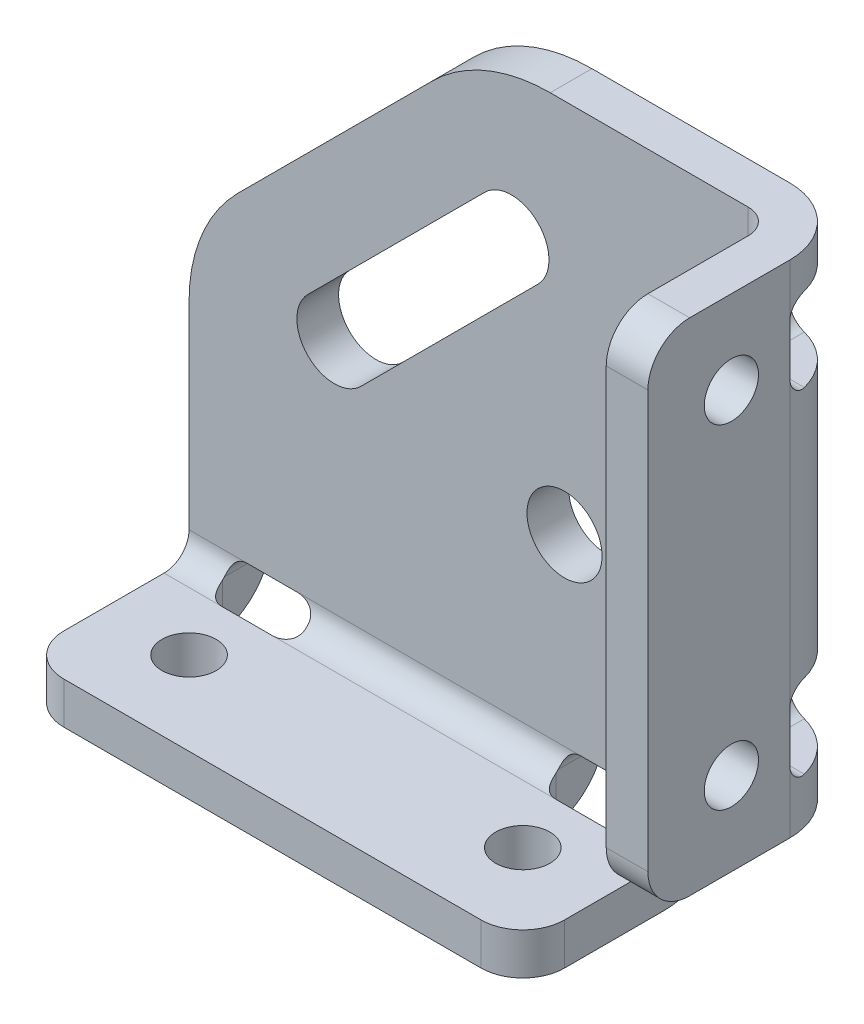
ISO-10303-21;
HEADER;
FILE_DESCRIPTION(('STEP AP214'),'2;1');
FILE_NAME('part.step','',(''),(''),'','','');
FILE_SCHEMA(('AUTOMOTIVE_DESIGN { 1 0 10303 214 1 1 1 1 }'));
ENDSEC;
DATA;
#1=APPLICATION_CONTEXT('core data for automotive mechanical design processes');
#2=APPLICATION_PROTOCOL_DEFINITION('international standard','automotive_design',2000,#1);
#3=PRODUCT_CONTEXT('',#1,'mechanical');
#4=PRODUCT('Part','Part','',(#3));
#5=PRODUCT_RELATED_PRODUCT_CATEGORY('part','',(#4));
#6=PRODUCT_DEFINITION_FORMATION('','',#4);
#7=PRODUCT_DEFINITION_CONTEXT('part definition',#1,'design');
#8=PRODUCT_DEFINITION('design','',#6,#7);
#9=PRODUCT_DEFINITION_SHAPE('','',#8);
#10=(LENGTH_UNIT() NAMED_UNIT(*) SI_UNIT(.MILLI.,.METRE.));
#11=(NAMED_UNIT(*) PLANE_ANGLE_UNIT() SI_UNIT($,.RADIAN.));
#12=(NAMED_UNIT(*) SI_UNIT($,.STERADIAN.) SOLID_ANGLE_UNIT());
#13=UNCERTAINTY_MEASURE_WITH_UNIT(LENGTH_MEASURE(1.E-05),#10,'distance_accuracy_value','');
#14=(GEOMETRIC_REPRESENTATION_CONTEXT(3) GLOBAL_UNCERTAINTY_ASSIGNED_CONTEXT((#13)) GLOBAL_UNIT_ASSIGNED_CONTEXT((#10,
#11,#12)) REPRESENTATION_CONTEXT('',''));
#15=CARTESIAN_POINT('',(0.,0.,0.));
#16=DIRECTION('',(0.,0.,1.));
#17=DIRECTION('',(1.,0.,0.));
#18=AXIS2_PLACEMENT_3D('',#15,#16,#17);
#19=CARTESIAN_POINT('',(-63.8700339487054,99.8890180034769,-137.));
#20=DIRECTION('',(1.,0.,0.));
#21=DIRECTION('',(0.,0.,-1.));
#22=AXIS2_PLACEMENT_3D('',#19,#20,#21);
#23=PLANE('',#22);
#24=CARTESIAN_POINT('',(-63.8700339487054,104.889018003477,-132.));
#25=DIRECTION('',(1.,0.,0.));
#26=DIRECTION('',(0.,0.,-1.));
#27=AXIS2_PLACEMENT_3D('',#24,#25,#26);
#28=CIRCLE('',#27,3.);
#29=CARTESIAN_POINT('',(-63.8700339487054,102.889018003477,-134.2360679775));
#30=VERTEX_POINT('',#29);
#31=CARTESIAN_POINT('',(-63.8700339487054,102.652950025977,-134.));
#32=VERTEX_POINT('',#31);
#33=EDGE_CURVE('E18',#30,#32,#28,.F.);
#34=ORIENTED_EDGE('',*,*,#33,.T.);
#35=DIRECTION('',(0.,-1.,0.));
#36=VECTOR('',#35,1.);
#37=CARTESIAN_POINT('',(-63.8700339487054,97.3890180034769,-134.));
#38=LINE('',#37,#36);
#39=CARTESIAN_POINT('',(-63.8700339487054,97.1430513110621,-134.));
#40=VERTEX_POINT('',#39);
#41=EDGE_CURVE('E782',#32,#40,#38,.T.);
#42=ORIENTED_EDGE('',*,*,#41,.T.);
#43=CARTESIAN_POINT('',(-63.8700339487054,104.889018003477,-132.));
#44=DIRECTION('',(-1.,0.,0.));
#45=DIRECTION('',(0.,0.,1.));
#46=AXIS2_PLACEMENT_3D('',#43,#44,#45);
#47=CIRCLE('',#46,8.);
#48=CARTESIAN_POINT('',(-63.8700339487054,102.889018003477,-139.745966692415));
#49=VERTEX_POINT('',#48);
#50=EDGE_CURVE('E1252',#49,#40,#47,.T.);
#51=ORIENTED_EDGE('',*,*,#50,.F.);
#52=DIRECTION('',(0.,0.,1.));
#53=VECTOR('',#52,1.);
#54=CARTESIAN_POINT('',(-63.8700339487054,102.889018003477,-134.5));
#55=LINE('',#54,#53);
#56=EDGE_CURVE('E772',#49,#30,#55,.T.);
#57=ORIENTED_EDGE('',*,*,#56,.T.);
#58=EDGE_LOOP('',(#34,#42,#51,#57));
#59=FACE_BOUND('',#58,.T.);
#60=ADVANCED_FACE('F15',(#59),#23,.T.);
#61=CARTESIAN_POINT('',(-93.8700339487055,99.8890180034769,-137.));
#62=DIRECTION('',(1.,0.,0.));
#63=DIRECTION('',(0.,0.,-1.));
#64=AXIS2_PLACEMENT_3D('',#61,#62,#63);
#65=PLANE('',#64);
#66=DIRECTION('',(0.,1.,0.));
#67=VECTOR('',#66,1.);
#68=CARTESIAN_POINT('',(-93.8700339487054,97.3890180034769,-134.));
#69=LINE('',#68,#67);
#70=CARTESIAN_POINT('',(-93.8700339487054,97.1430513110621,-134.));
#71=VERTEX_POINT('',#70);
#72=CARTESIAN_POINT('',(-93.8700339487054,102.652950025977,-134.));
#73=VERTEX_POINT('',#72);
#74=EDGE_CURVE('E778',#71,#73,#69,.T.);
#75=ORIENTED_EDGE('',*,*,#74,.T.);
#76=CARTESIAN_POINT('',(-93.8700339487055,104.889018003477,-132.));
#77=DIRECTION('',(1.,0.,0.));
#78=DIRECTION('',(0.,0.,-1.));
#79=AXIS2_PLACEMENT_3D('',#76,#77,#78);
#80=CIRCLE('',#79,3.);
#81=CARTESIAN_POINT('',(-93.8700339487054,102.889018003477,-134.2360679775));
#82=VERTEX_POINT('',#81);
#83=EDGE_CURVE('E1253',#82,#73,#80,.F.);
#84=ORIENTED_EDGE('',*,*,#83,.F.);
#85=DIRECTION('',(0.,0.,-1.));
#86=VECTOR('',#85,1.);
#87=CARTESIAN_POINT('',(-93.8700339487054,102.889018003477,-134.5));
#88=LINE('',#87,#86);
#89=CARTESIAN_POINT('',(-93.8700339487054,102.889018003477,-139.745966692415));
#90=VERTEX_POINT('',#89);
#91=EDGE_CURVE('E764',#82,#90,#88,.T.);
#92=ORIENTED_EDGE('',*,*,#91,.T.);
#93=CARTESIAN_POINT('',(-93.8700339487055,104.889018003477,-132.));
#94=DIRECTION('',(-1.,0.,0.));
#95=DIRECTION('',(0.,0.,1.));
#96=AXIS2_PLACEMENT_3D('',#93,#94,#95);
#97=CIRCLE('',#96,8.);
#98=EDGE_CURVE('E974',#71,#90,#97,.F.);
#99=ORIENTED_EDGE('',*,*,#98,.F.);
#100=EDGE_LOOP('',(#75,#84,#92,#99));
#101=FACE_BOUND('',#100,.T.);
#102=ADVANCED_FACE('F1481',(#101),#65,.F.);
#103=CARTESIAN_POINT('',(-103.870033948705,99.8890180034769,-137.));
#104=DIRECTION('',(1.,0.,0.));
#105=DIRECTION('',(0.,0.,-1.));
#106=AXIS2_PLACEMENT_3D('',#103,#104,#105);
#107=PLANE('',#106);
#108=CARTESIAN_POINT('',(-103.870033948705,104.889018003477,-132.));
#109=DIRECTION('',(1.,0.,0.));
#110=DIRECTION('',(0.,0.,-1.));
#111=AXIS2_PLACEMENT_3D('',#108,#109,#110);
#112=CIRCLE('',#111,3.);
#113=CARTESIAN_POINT('',(-103.870033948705,102.889018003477,-134.2360679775));
#114=VERTEX_POINT('',#113);
#115=CARTESIAN_POINT('',(-103.870033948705,102.652950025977,-134.));
#116=VERTEX_POINT('',#115);
#117=EDGE_CURVE('E946',#114,#116,#112,.F.);
#118=ORIENTED_EDGE('',*,*,#117,.T.);
#119=DIRECTION('',(0.,-1.,0.));
#120=VECTOR('',#119,1.);
#121=CARTESIAN_POINT('',(-103.870033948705,97.3890180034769,-134.));
#122=LINE('',#121,#120);
#123=CARTESIAN_POINT('',(-103.870033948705,97.1430513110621,-134.));
#124=VERTEX_POINT('',#123);
#125=EDGE_CURVE('E754',#116,#124,#122,.T.);
#126=ORIENTED_EDGE('',*,*,#125,.T.);
#127=CARTESIAN_POINT('',(-103.870033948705,104.889018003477,-132.));
#128=DIRECTION('',(-1.,0.,0.));
#129=DIRECTION('',(0.,0.,1.));
#130=AXIS2_PLACEMENT_3D('',#127,#128,#129);
#131=CIRCLE('',#130,8.);
#132=CARTESIAN_POINT('',(-103.870033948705,102.889018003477,-139.745966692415));
#133=VERTEX_POINT('',#132);
#134=EDGE_CURVE('E1157',#133,#124,#131,.T.);
#135=ORIENTED_EDGE('',*,*,#134,.F.);
#136=DIRECTION('',(0.,0.,1.));
#137=VECTOR('',#136,1.);
#138=CARTESIAN_POINT('',(-103.870033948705,102.889018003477,-134.5));
#139=LINE('',#138,#137);
#140=EDGE_CURVE('E750',#133,#114,#139,.T.);
#141=ORIENTED_EDGE('',*,*,#140,.T.);
#142=EDGE_LOOP('',(#118,#126,#135,#141));
#143=FACE_BOUND('',#142,.T.);
#144=ADVANCED_FACE('F1162',(#143),#107,.T.);
#145=CARTESIAN_POINT('',(-36.8700339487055,167.533977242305,-137.));
#146=DIRECTION('',(0.,1.,0.));
#147=DIRECTION('',(0.,0.,1.));
#148=AXIS2_PLACEMENT_3D('',#145,#146,#147);
#149=PLANE('',#148);
#150=DIRECTION('',(-1.,0.,0.));
#151=VECTOR('',#150,1.);
#152=CARTESIAN_POINT('',(-34.3700339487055,167.533977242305,-134.));
#153=LINE('',#152,#151);
#154=CARTESIAN_POINT('',(-34.1240672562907,167.533977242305,-134.));
#155=VERTEX_POINT('',#154);
#156=CARTESIAN_POINT('',(-39.6339659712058,167.533977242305,-134.));
#157=VERTEX_POINT('',#156);
#158=EDGE_CURVE('E731',#155,#157,#153,.T.);
#159=ORIENTED_EDGE('',*,*,#158,.T.);
#160=CARTESIAN_POINT('',(-41.8700339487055,167.533977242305,-132.));
#161=DIRECTION('',(0.,1.,0.));
#162=DIRECTION('',(0.,0.,1.));
#163=AXIS2_PLACEMENT_3D('',#160,#161,#162);
#164=CIRCLE('',#163,3.);
#165=CARTESIAN_POINT('',(-39.8700339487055,167.533977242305,-134.2360679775));
#166=VERTEX_POINT('',#165);
#167=EDGE_CURVE('E1255',#166,#157,#164,.F.);
#168=ORIENTED_EDGE('',*,*,#167,.F.);
#169=DIRECTION('',(0.,0.,-1.));
#170=VECTOR('',#169,1.);
#171=CARTESIAN_POINT('',(-39.8700339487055,167.533977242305,-134.5));
#172=LINE('',#171,#170);
#173=CARTESIAN_POINT('',(-39.8700339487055,167.533977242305,-139.745966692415));
#174=VERTEX_POINT('',#173);
#175=EDGE_CURVE('E720',#166,#174,#172,.T.);
#176=ORIENTED_EDGE('',*,*,#175,.T.);
#177=CARTESIAN_POINT('',(-41.8700339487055,167.533977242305,-132.));
#178=DIRECTION('',(0.,-1.,0.));
#179=DIRECTION('',(0.,0.,-1.));
#180=AXIS2_PLACEMENT_3D('',#177,#178,#179);
#181=CIRCLE('',#180,8.);
#182=EDGE_CURVE('E734',#155,#174,#181,.F.);
#183=ORIENTED_EDGE('',*,*,#182,.F.);
#184=EDGE_LOOP('',(#159,#168,#176,#183));
#185=FACE_BOUND('',#184,.T.);
#186=ADVANCED_FACE('F1475',(#185),#149,.F.);
#187=CARTESIAN_POINT('',(-36.8700339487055,157.533977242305,-137.));
#188=DIRECTION('',(0.,1.,0.));
#189=DIRECTION('',(0.,0.,1.));
#190=AXIS2_PLACEMENT_3D('',#187,#188,#189);
#191=PLANE('',#190);
#192=CARTESIAN_POINT('',(-41.8700339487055,157.533977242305,-132.));
#193=DIRECTION('',(0.,1.,0.));
#194=DIRECTION('',(0.,0.,1.));
#195=AXIS2_PLACEMENT_3D('',#192,#193,#194);
#196=CIRCLE('',#195,3.);
#197=CARTESIAN_POINT('',(-39.8700339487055,157.533977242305,-134.2360679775));
#198=VERTEX_POINT('',#197);
#199=CARTESIAN_POINT('',(-39.6339659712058,157.533977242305,-134.));
#200=VERTEX_POINT('',#199);
#201=EDGE_CURVE('E1259',#198,#200,#196,.F.);
#202=ORIENTED_EDGE('',*,*,#201,.T.);
#203=DIRECTION('',(1.,0.,0.));
#204=VECTOR('',#203,1.);
#205=CARTESIAN_POINT('',(-34.3700339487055,157.533977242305,-134.));
#206=LINE('',#205,#204);
#207=CARTESIAN_POINT('',(-34.1240672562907,157.533977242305,-134.));
#208=VERTEX_POINT('',#207);
#209=EDGE_CURVE('E713',#200,#208,#206,.T.);
#210=ORIENTED_EDGE('',*,*,#209,.T.);
#211=CARTESIAN_POINT('',(-41.8700339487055,157.533977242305,-132.));
#212=DIRECTION('',(0.,-1.,0.));
#213=DIRECTION('',(0.,0.,-1.));
#214=AXIS2_PLACEMENT_3D('',#211,#212,#213);
#215=CIRCLE('',#214,8.);
#216=CARTESIAN_POINT('',(-39.8700339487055,157.533977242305,-139.745966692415));
#217=VERTEX_POINT('',#216);
#218=EDGE_CURVE('E1269',#217,#208,#215,.T.);
#219=ORIENTED_EDGE('',*,*,#218,.F.);
#220=DIRECTION('',(0.,0.,1.));
#221=VECTOR('',#220,1.);
#222=CARTESIAN_POINT('',(-39.8700339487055,157.533977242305,-134.5));
#223=LINE('',#222,#221);
#224=EDGE_CURVE('E700',#217,#198,#223,.T.);
#225=ORIENTED_EDGE('',*,*,#224,.T.);
#226=EDGE_LOOP('',(#202,#210,#219,#225));
#227=FACE_BOUND('',#226,.T.);
#228=ADVANCED_FACE('F1472',(#227),#191,.T.);
#229=CARTESIAN_POINT('',(-36.8700339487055,127.394373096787,-137.));
#230=DIRECTION('',(0.,1.,0.));
#231=DIRECTION('',(0.,0.,1.));
#232=AXIS2_PLACEMENT_3D('',#229,#230,#231);
#233=PLANE('',#232);
#234=DIRECTION('',(-1.,0.,0.));
#235=VECTOR('',#234,1.);
#236=CARTESIAN_POINT('',(-34.3700339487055,127.394373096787,-134.));
#237=LINE('',#236,#235);
#238=CARTESIAN_POINT('',(-34.1240672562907,127.394373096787,-134.));
#239=VERTEX_POINT('',#238);
#240=CARTESIAN_POINT('',(-39.6339659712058,127.394373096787,-134.));
#241=VERTEX_POINT('',#240);
#242=EDGE_CURVE('E707',#239,#241,#237,.T.);
#243=ORIENTED_EDGE('',*,*,#242,.T.);
#244=CARTESIAN_POINT('',(-41.8700339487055,127.394373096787,-132.));
#245=DIRECTION('',(0.,1.,0.));
#246=DIRECTION('',(0.,0.,1.));
#247=AXIS2_PLACEMENT_3D('',#244,#245,#246);
#248=CIRCLE('',#247,3.);
#249=CARTESIAN_POINT('',(-39.8700339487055,127.394373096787,-134.2360679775));
#250=VERTEX_POINT('',#249);
#251=EDGE_CURVE('E1261',#250,#241,#248,.F.);
#252=ORIENTED_EDGE('',*,*,#251,.F.);
#253=DIRECTION('',(0.,0.,-1.));
#254=VECTOR('',#253,1.);
#255=CARTESIAN_POINT('',(-39.8700339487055,127.394373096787,-134.5));
#256=LINE('',#255,#254);
#257=CARTESIAN_POINT('',(-39.8700339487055,127.394373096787,-139.745966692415));
#258=VERTEX_POINT('',#257);
#259=EDGE_CURVE('E690',#250,#258,#256,.T.);
#260=ORIENTED_EDGE('',*,*,#259,.T.);
#261=CARTESIAN_POINT('',(-41.8700339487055,127.394373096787,-132.));
#262=DIRECTION('',(0.,-1.,0.));
#263=DIRECTION('',(0.,0.,-1.));
#264=AXIS2_PLACEMENT_3D('',#261,#262,#263);
#265=CIRCLE('',#264,8.);
#266=EDGE_CURVE('E788',#239,#258,#265,.F.);
#267=ORIENTED_EDGE('',*,*,#266,.F.);
#268=EDGE_LOOP('',(#243,#252,#260,#267));
#269=FACE_BOUND('',#268,.T.);
#270=ADVANCED_FACE('F1287',(#269),#233,.F.);
#271=CARTESIAN_POINT('',(-36.8700339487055,117.394373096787,-137.));
#272=DIRECTION('',(0.,1.,0.));
#273=DIRECTION('',(0.,0.,1.));
#274=AXIS2_PLACEMENT_3D('',#271,#272,#273);
#275=PLANE('',#274);
#276=CARTESIAN_POINT('',(-41.8700339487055,117.394373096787,-132.));
#277=DIRECTION('',(0.,1.,0.));
#278=DIRECTION('',(0.,0.,1.));
#279=AXIS2_PLACEMENT_3D('',#276,#277,#278);
#280=CIRCLE('',#279,3.);
#281=CARTESIAN_POINT('',(-39.8700339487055,117.394373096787,-134.2360679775));
#282=VERTEX_POINT('',#281);
#283=CARTESIAN_POINT('',(-39.6339659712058,117.394373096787,-134.));
#284=VERTEX_POINT('',#283);
#285=EDGE_CURVE('E1263',#282,#284,#280,.F.);
#286=ORIENTED_EDGE('',*,*,#285,.T.);
#287=DIRECTION('',(1.,0.,0.));
#288=VECTOR('',#287,1.);
#289=CARTESIAN_POINT('',(-34.3700339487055,117.394373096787,-134.));
#290=LINE('',#289,#288);
#291=CARTESIAN_POINT('',(-34.1240672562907,117.394373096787,-134.));
#292=VERTEX_POINT('',#291);
#293=EDGE_CURVE('E302',#284,#292,#290,.T.);
#294=ORIENTED_EDGE('',*,*,#293,.T.);
#295=CARTESIAN_POINT('',(-41.8700339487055,117.394373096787,-132.));
#296=DIRECTION('',(0.,-1.,0.));
#297=DIRECTION('',(0.,0.,-1.));
#298=AXIS2_PLACEMENT_3D('',#295,#296,#297);
#299=CIRCLE('',#298,8.);
#300=CARTESIAN_POINT('',(-39.8700339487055,117.394373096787,-139.745966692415));
#301=VERTEX_POINT('',#300);
#302=EDGE_CURVE('E309',#301,#292,#299,.T.);
#303=ORIENTED_EDGE('',*,*,#302,.F.);
#304=DIRECTION('',(0.,0.,1.));
#305=VECTOR('',#304,1.);
#306=CARTESIAN_POINT('',(-39.8700339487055,117.394373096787,-134.5));
#307=LINE('',#306,#305);
#308=EDGE_CURVE('E291',#301,#282,#307,.T.);
#309=ORIENTED_EDGE('',*,*,#308,.T.);
#310=EDGE_LOOP('',(#286,#294,#303,#309));
#311=FACE_BOUND('',#310,.T.);
#312=ADVANCED_FACE('F316',(#311),#275,.T.);
#313=CARTESIAN_POINT('',(-31.8700339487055,157.533977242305,-132.));
#314=DIRECTION('',(0.,0.,1.));
#315=DIRECTION('',(1.,0.,0.));
#316=AXIS2_PLACEMENT_3D('',#313,#314,#315);
#317=PLANE('',#316);
#318=DIRECTION('',(1.,0.,0.));
#319=VECTOR('',#318,1.);
#320=CARTESIAN_POINT('',(-34.3700339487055,159.533977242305,-132.));
#321=LINE('',#320,#319);
#322=CARTESIAN_POINT('',(-33.8700339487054,159.533977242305,-132.));
#323=VERTEX_POINT('',#322);
#324=CARTESIAN_POINT('',(-38.8700339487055,159.533977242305,-132.));
#325=VERTEX_POINT('',#324);
#326=EDGE_CURVE('E716',#323,#325,#321,.F.);
#327=ORIENTED_EDGE('',*,*,#326,.T.);
#328=DIRECTION('',(0.,1.,0.));
#329=VECTOR('',#328,1.);
#330=CARTESIAN_POINT('',(-38.8700339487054,141.889018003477,-132.));
#331=LINE('',#330,#329);
#332=CARTESIAN_POINT('',(-38.8700339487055,165.533977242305,-132.));
#333=VERTEX_POINT('',#332);
#334=EDGE_CURVE('E684',#333,#325,#331,.F.);
#335=ORIENTED_EDGE('',*,*,#334,.F.);
#336=DIRECTION('',(-1.,0.,0.));
#337=VECTOR('',#336,1.);
#338=CARTESIAN_POINT('',(-34.3700339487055,165.533977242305,-132.));
#339=LINE('',#338,#337);
#340=CARTESIAN_POINT('',(-33.8700339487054,165.533977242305,-132.));
#341=VERTEX_POINT('',#340);
#342=EDGE_CURVE('E728',#333,#341,#339,.F.);
#343=ORIENTED_EDGE('',*,*,#342,.T.);
#344=DIRECTION('',(0.,1.,0.));
#345=VECTOR('',#344,1.);
#346=CARTESIAN_POINT('',(-33.8700339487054,141.889018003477,-132.));
#347=LINE('',#346,#345);
#348=EDGE_CURVE('E738',#341,#323,#347,.F.);
#349=ORIENTED_EDGE('',*,*,#348,.T.);
#350=EDGE_LOOP('',(#327,#335,#343,#349));
#351=FACE_BOUND('',#350,.T.);
#352=ADVANCED_FACE('F1463',(#351),#317,.F.);
#353=CARTESIAN_POINT('',(-31.8700339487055,117.394373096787,-132.));
#354=DIRECTION('',(0.,0.,1.));
#355=DIRECTION('',(1.,0.,0.));
#356=AXIS2_PLACEMENT_3D('',#353,#354,#355);
#357=PLANE('',#356);
#358=DIRECTION('',(1.,0.,0.));
#359=VECTOR('',#358,1.);
#360=CARTESIAN_POINT('',(-34.3700339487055,119.394373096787,-132.));
#361=LINE('',#360,#359);
#362=CARTESIAN_POINT('',(-33.8700339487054,119.394373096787,-132.));
#363=VERTEX_POINT('',#362);
#364=CARTESIAN_POINT('',(-38.8700339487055,119.394373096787,-132.));
#365=VERTEX_POINT('',#364);
#366=EDGE_CURVE('E686',#363,#365,#361,.F.);
#367=ORIENTED_EDGE('',*,*,#366,.T.);
#368=DIRECTION('',(0.,1.,0.));
#369=VECTOR('',#368,1.);
#370=CARTESIAN_POINT('',(-38.8700339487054,141.889018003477,-132.));
#371=LINE('',#370,#369);
#372=CARTESIAN_POINT('',(-38.8700339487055,125.394373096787,-132.));
#373=VERTEX_POINT('',#372);
#374=EDGE_CURVE('E671',#373,#365,#371,.F.);
#375=ORIENTED_EDGE('',*,*,#374,.F.);
#376=DIRECTION('',(-1.,0.,0.));
#377=VECTOR('',#376,1.);
#378=CARTESIAN_POINT('',(-34.3700339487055,125.394373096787,-132.));
#379=LINE('',#378,#377);
#380=CARTESIAN_POINT('',(-33.8700339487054,125.394373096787,-132.));
#381=VERTEX_POINT('',#380);
#382=EDGE_CURVE('E704',#373,#381,#379,.F.);
#383=ORIENTED_EDGE('',*,*,#382,.T.);
#384=DIRECTION('',(0.,1.,0.));
#385=VECTOR('',#384,1.);
#386=CARTESIAN_POINT('',(-33.8700339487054,141.889018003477,-132.));
#387=LINE('',#386,#385);
#388=EDGE_CURVE('E681',#381,#363,#387,.F.);
#389=ORIENTED_EDGE('',*,*,#388,.T.);
#390=EDGE_LOOP('',(#367,#375,#383,#389));
#391=FACE_BOUND('',#390,.T.);
#392=ADVANCED_FACE('F1459',(#391),#357,.F.);
#393=CARTESIAN_POINT('',(-24.1937428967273,161.889018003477,-125.));
#394=DIRECTION('',(-1.,0.,0.));
#395=DIRECTION('',(0.,0.,1.));
#396=AXIS2_PLACEMENT_3D('',#393,#394,#395);
#397=CYLINDRICAL_SURFACE('',#396,3.25);
#398=CARTESIAN_POINT('',(-33.8700339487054,161.889018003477,-125.));
#399=DIRECTION('',(-1.,0.,0.));
#400=DIRECTION('',(0.,0.,1.));
#401=AXIS2_PLACEMENT_3D('',#398,#399,#400);
#402=CIRCLE('',#401,3.25);
#403=CARTESIAN_POINT('',(-33.8700339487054,158.639018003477,-125.));
#404=VERTEX_POINT('',#403);
#405=EDGE_CURVE('E31',#404,#404,#402,.F.);
#406=ORIENTED_EDGE('',*,*,#405,.T.);
#407=EDGE_LOOP('',(#406));
#408=FACE_BOUND('',#407,.T.);
#409=CARTESIAN_POINT('',(-38.8700339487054,161.889018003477,-125.));
#410=DIRECTION('',(-1.,0.,0.));
#411=DIRECTION('',(0.,0.,1.));
#412=AXIS2_PLACEMENT_3D('',#409,#410,#411);
#413=CIRCLE('',#412,3.25);
#414=CARTESIAN_POINT('',(-38.8700339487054,158.639018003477,-125.));
#415=VERTEX_POINT('',#414);
#416=EDGE_CURVE('E670',#415,#415,#413,.F.);
#417=ORIENTED_EDGE('',*,*,#416,.F.);
#418=EDGE_LOOP('',(#417));
#419=FACE_BOUND('',#418,.T.);
#420=ADVANCED_FACE('F1455',(#408,#419),#397,.F.);
#421=CARTESIAN_POINT('',(-24.1937428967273,121.889018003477,-125.));
#422=DIRECTION('',(-1.,0.,0.));
#423=DIRECTION('',(0.,0.,1.));
#424=AXIS2_PLACEMENT_3D('',#421,#422,#423);
#425=CYLINDRICAL_SURFACE('',#424,3.25);
#426=CARTESIAN_POINT('',(-33.8700339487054,121.889018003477,-125.));
#427=DIRECTION('',(-1.,0.,0.));
#428=DIRECTION('',(0.,0.,1.));
#429=AXIS2_PLACEMENT_3D('',#426,#427,#428);
#430=CIRCLE('',#429,3.25);
#431=CARTESIAN_POINT('',(-33.8700339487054,118.639018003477,-125.));
#432=VERTEX_POINT('',#431);
#433=EDGE_CURVE('E314',#432,#432,#430,.F.);
#434=ORIENTED_EDGE('',*,*,#433,.T.);
#435=EDGE_LOOP('',(#434));
#436=FACE_BOUND('',#435,.T.);
#437=CARTESIAN_POINT('',(-38.8700339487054,121.889018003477,-125.));
#438=DIRECTION('',(-1.,0.,0.));
#439=DIRECTION('',(0.,0.,1.));
#440=AXIS2_PLACEMENT_3D('',#437,#438,#439);
#441=CIRCLE('',#440,3.25);
#442=CARTESIAN_POINT('',(-38.8700339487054,118.639018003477,-125.));
#443=VERTEX_POINT('',#442);
#444=EDGE_CURVE('E1197',#443,#443,#441,.F.);
#445=ORIENTED_EDGE('',*,*,#444,.F.);
#446=EDGE_LOOP('',(#445));
#447=FACE_BOUND('',#446,.T.);
#448=ADVANCED_FACE('F1448',(#436,#447),#425,.F.);
#449=CARTESIAN_POINT('',(-36.3700339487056,116.889018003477,-115.));
#450=DIRECTION('',(0.,0.,-1.));
#451=DIRECTION('',(-1.,0.,0.));
#452=AXIS2_PLACEMENT_3D('',#449,#450,#451);
#453=PLANE('',#452);
#454=DIRECTION('',(0.,1.,0.));
#455=VECTOR('',#454,1.);
#456=CARTESIAN_POINT('',(-38.8700339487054,141.889018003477,-115.));
#457=LINE('',#456,#455);
#458=CARTESIAN_POINT('',(-38.8700339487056,116.889018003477,-115.));
#459=VERTEX_POINT('',#458);
#460=CARTESIAN_POINT('',(-38.8700339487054,166.889018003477,-115.));
#461=VERTEX_POINT('',#460);
#462=EDGE_CURVE('E668',#459,#461,#457,.T.);
#463=ORIENTED_EDGE('',*,*,#462,.F.);
#464=DIRECTION('',(1.,0.,0.));
#465=VECTOR('',#464,1.);
#466=CARTESIAN_POINT('',(-36.3700339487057,116.889018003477,-115.));
#467=LINE('',#466,#465);
#468=CARTESIAN_POINT('',(-33.8700339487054,116.889018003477,-115.));
#469=VERTEX_POINT('',#468);
#470=EDGE_CURVE('E460',#469,#459,#467,.F.);
#471=ORIENTED_EDGE('',*,*,#470,.F.);
#472=DIRECTION('',(0.,1.,0.));
#473=VECTOR('',#472,1.);
#474=CARTESIAN_POINT('',(-33.8700339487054,141.889018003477,-115.));
#475=LINE('',#474,#473);
#476=CARTESIAN_POINT('',(-33.8700339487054,166.889018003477,-115.));
#477=VERTEX_POINT('',#476);
#478=EDGE_CURVE('E677',#469,#477,#475,.T.);
#479=ORIENTED_EDGE('',*,*,#478,.T.);
#480=DIRECTION('',(1.,0.,0.));
#481=VECTOR('',#480,1.);
#482=CARTESIAN_POINT('',(-57.6200339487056,166.889018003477,-115.));
#483=LINE('',#482,#481);
#484=EDGE_CURVE('E797',#461,#477,#483,.T.);
#485=ORIENTED_EDGE('',*,*,#484,.F.);
#486=EDGE_LOOP('',(#463,#471,#479,#485));
#487=FACE_BOUND('',#486,.T.);
#488=ADVANCED_FACE('F1439',(#487),#453,.F.);
#489=CARTESIAN_POINT('',(-103.870033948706,99.3890180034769,-115.));
#490=DIRECTION('',(0.,0.,-1.));
#491=DIRECTION('',(-1.,0.,0.));
#492=AXIS2_PLACEMENT_3D('',#489,#490,#491);
#493=PLANE('',#492);
#494=DIRECTION('',(1.,0.,0.));
#495=VECTOR('',#494,1.);
#496=CARTESIAN_POINT('',(-78.8700339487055,96.8890180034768,-115.));
#497=LINE('',#496,#495);
#498=CARTESIAN_POINT('',(-103.870033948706,96.8890180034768,-115.));
#499=VERTEX_POINT('',#498);
#500=CARTESIAN_POINT('',(-53.8700339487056,96.8890180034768,-115.));
#501=VERTEX_POINT('',#500);
#502=EDGE_CURVE('E651',#499,#501,#497,.T.);
#503=ORIENTED_EDGE('',*,*,#502,.T.);
#504=DIRECTION('',(0.,-1.,0.));
#505=VECTOR('',#504,1.);
#506=CARTESIAN_POINT('',(-53.8700339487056,99.3890180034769,-115.));
#507=LINE('',#506,#505);
#508=CARTESIAN_POINT('',(-53.8700339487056,101.889018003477,-115.));
#509=VERTEX_POINT('',#508);
#510=EDGE_CURVE('E790',#509,#501,#507,.T.);
#511=ORIENTED_EDGE('',*,*,#510,.F.);
#512=DIRECTION('',(1.,0.,0.));
#513=VECTOR('',#512,1.);
#514=CARTESIAN_POINT('',(-78.8700339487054,101.889018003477,-115.));
#515=LINE('',#514,#513);
#516=CARTESIAN_POINT('',(-103.870033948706,101.889018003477,-115.));
#517=VERTEX_POINT('',#516);
#518=EDGE_CURVE('E643',#517,#509,#515,.T.);
#519=ORIENTED_EDGE('',*,*,#518,.F.);
#520=DIRECTION('',(0.,-1.,0.));
#521=VECTOR('',#520,1.);
#522=CARTESIAN_POINT('',(-103.870033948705,120.639018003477,-115.));
#523=LINE('',#522,#521);
#524=EDGE_CURVE('E795',#499,#517,#523,.F.);
#525=ORIENTED_EDGE('',*,*,#524,.F.);
#526=EDGE_LOOP('',(#503,#511,#519,#525));
#527=FACE_BOUND('',#526,.T.);
#528=ADVANCED_FACE('F1434',(#527),#493,.F.);
#529=CARTESIAN_POINT('',(-103.870033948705,94.8890180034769,-132.));
#530=DIRECTION('',(0.,0.,1.));
#531=DIRECTION('',(1.,0.,0.));
#532=AXIS2_PLACEMENT_3D('',#529,#530,#531);
#533=PLANE('',#532);
#534=DIRECTION('',(0.,-1.,0.));
#535=VECTOR('',#534,1.);
#536=CARTESIAN_POINT('',(-101.870033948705,97.3890180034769,-132.));
#537=LINE('',#536,#535);
#538=CARTESIAN_POINT('',(-101.870033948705,96.8890180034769,-132.));
#539=VERTEX_POINT('',#538);
#540=CARTESIAN_POINT('',(-101.870033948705,101.889018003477,-132.));
#541=VERTEX_POINT('',#540);
#542=EDGE_CURVE('E760',#539,#541,#537,.F.);
#543=ORIENTED_EDGE('',*,*,#542,.T.);
#544=DIRECTION('',(1.,0.,0.));
#545=VECTOR('',#544,1.);
#546=CARTESIAN_POINT('',(-78.8700339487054,101.889018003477,-132.));
#547=LINE('',#546,#545);
#548=CARTESIAN_POINT('',(-95.8700339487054,101.889018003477,-132.));
#549=VERTEX_POINT('',#548);
#550=EDGE_CURVE('E650',#549,#541,#547,.F.);
#551=ORIENTED_EDGE('',*,*,#550,.F.);
#552=DIRECTION('',(0.,1.,0.));
#553=VECTOR('',#552,1.);
#554=CARTESIAN_POINT('',(-95.8700339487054,97.3890180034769,-132.));
#555=LINE('',#554,#553);
#556=CARTESIAN_POINT('',(-95.8700339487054,96.8890180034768,-132.));
#557=VERTEX_POINT('',#556);
#558=EDGE_CURVE('E775',#549,#557,#555,.F.);
#559=ORIENTED_EDGE('',*,*,#558,.T.);
#560=DIRECTION('',(1.,0.,0.));
#561=VECTOR('',#560,1.);
#562=CARTESIAN_POINT('',(-78.8700339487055,96.8890180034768,-132.));
#563=LINE('',#562,#561);
#564=EDGE_CURVE('E749',#557,#539,#563,.F.);
#565=ORIENTED_EDGE('',*,*,#564,.T.);
#566=EDGE_LOOP('',(#543,#551,#559,#565));
#567=FACE_BOUND('',#566,.T.);
#568=ADVANCED_FACE('F1166',(#567),#533,.F.);
#569=CARTESIAN_POINT('',(-98.8700339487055,87.2127269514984,-125.));
#570=DIRECTION('',(0.,-1.,0.));
#571=DIRECTION('',(0.,0.,-1.));
#572=AXIS2_PLACEMENT_3D('',#569,#570,#571);
#573=CYLINDRICAL_SURFACE('',#572,3.25);
#574=CARTESIAN_POINT('',(-98.8700339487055,101.889018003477,-125.));
#575=DIRECTION('',(0.,-1.,0.));
#576=DIRECTION('',(0.,0.,-1.));
#577=AXIS2_PLACEMENT_3D('',#574,#575,#576);
#578=CIRCLE('',#577,3.25);
#579=CARTESIAN_POINT('',(-95.6200339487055,101.889018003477,-125.));
#580=VERTEX_POINT('',#579);
#581=EDGE_CURVE('E757',#580,#580,#578,.T.);
#582=ORIENTED_EDGE('',*,*,#581,.F.);
#583=EDGE_LOOP('',(#582));
#584=FACE_BOUND('',#583,.T.);
#585=CARTESIAN_POINT('',(-98.8700339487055,96.8890180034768,-125.));
#586=DIRECTION('',(0.,-1.,0.));
#587=DIRECTION('',(0.,0.,-1.));
#588=AXIS2_PLACEMENT_3D('',#585,#586,#587);
#589=CIRCLE('',#588,3.25);
#590=CARTESIAN_POINT('',(-95.6200339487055,96.8890180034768,-125.));
#591=VERTEX_POINT('',#590);
#592=EDGE_CURVE('E1189',#591,#591,#589,.T.);
#593=ORIENTED_EDGE('',*,*,#592,.T.);
#594=EDGE_LOOP('',(#593));
#595=FACE_BOUND('',#594,.T.);
#596=ADVANCED_FACE('F1446',(#584,#595),#573,.F.);
#597=CARTESIAN_POINT('',(-58.8700339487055,87.2127269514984,-125.));
#598=DIRECTION('',(0.,-1.,0.));
#599=DIRECTION('',(0.,0.,-1.));
#600=AXIS2_PLACEMENT_3D('',#597,#598,#599);
#601=CYLINDRICAL_SURFACE('',#600,3.25);
#602=CARTESIAN_POINT('',(-58.8700339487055,101.889018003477,-125.));
#603=DIRECTION('',(0.,-1.,0.));
#604=DIRECTION('',(0.,0.,-1.));
#605=AXIS2_PLACEMENT_3D('',#602,#603,#604);
#606=CIRCLE('',#605,3.25);
#607=CARTESIAN_POINT('',(-55.6200339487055,101.889018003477,-125.));
#608=VERTEX_POINT('',#607);
#609=EDGE_CURVE('E642',#608,#608,#606,.T.);
#610=ORIENTED_EDGE('',*,*,#609,.F.);
#611=EDGE_LOOP('',(#610));
#612=FACE_BOUND('',#611,.T.);
#613=CARTESIAN_POINT('',(-58.8700339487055,96.8890180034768,-125.));
#614=DIRECTION('',(0.,-1.,0.));
#615=DIRECTION('',(0.,0.,-1.));
#616=AXIS2_PLACEMENT_3D('',#613,#614,#615);
#617=CIRCLE('',#616,3.25);
#618=CARTESIAN_POINT('',(-55.6200339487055,96.8890180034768,-125.));
#619=VERTEX_POINT('',#618);
#620=EDGE_CURVE('E1185',#619,#619,#617,.T.);
#621=ORIENTED_EDGE('',*,*,#620,.T.);
#622=EDGE_LOOP('',(#621));
#623=FACE_BOUND('',#622,.T.);
#624=ADVANCED_FACE('F1529',(#612,#623),#601,.F.);
#625=CARTESIAN_POINT('',(-63.8700339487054,94.8890180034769,-132.));
#626=DIRECTION('',(0.,0.,1.));
#627=DIRECTION('',(1.,0.,0.));
#628=AXIS2_PLACEMENT_3D('',#625,#626,#627);
#629=PLANE('',#628);
#630=DIRECTION('',(0.,-1.,0.));
#631=VECTOR('',#630,1.);
#632=CARTESIAN_POINT('',(-61.8700339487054,97.3890180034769,-132.));
#633=LINE('',#632,#631);
#634=CARTESIAN_POINT('',(-61.8700339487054,96.8890180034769,-132.));
#635=VERTEX_POINT('',#634);
#636=CARTESIAN_POINT('',(-61.8700339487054,101.889018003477,-132.));
#637=VERTEX_POINT('',#636);
#638=EDGE_CURVE('E785',#635,#637,#633,.F.);
#639=ORIENTED_EDGE('',*,*,#638,.T.);
#640=DIRECTION('',(1.,0.,0.));
#641=VECTOR('',#640,1.);
#642=CARTESIAN_POINT('',(-78.8700339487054,101.889018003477,-132.));
#643=LINE('',#642,#641);
#644=CARTESIAN_POINT('',(-55.8700339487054,101.889018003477,-132.));
#645=VERTEX_POINT('',#644);
#646=EDGE_CURVE('E647',#645,#637,#643,.F.);
#647=ORIENTED_EDGE('',*,*,#646,.F.);
#648=DIRECTION('',(0.,1.,0.));
#649=VECTOR('',#648,1.);
#650=CARTESIAN_POINT('',(-55.8700339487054,97.3890180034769,-132.));
#651=LINE('',#650,#649);
#652=CARTESIAN_POINT('',(-55.8700339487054,96.8890180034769,-132.));
#653=VERTEX_POINT('',#652);
#654=EDGE_CURVE('E634',#645,#653,#651,.F.);
#655=ORIENTED_EDGE('',*,*,#654,.T.);
#656=DIRECTION('',(1.,0.,0.));
#657=VECTOR('',#656,1.);
#658=CARTESIAN_POINT('',(-78.8700339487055,96.8890180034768,-132.));
#659=LINE('',#658,#657);
#660=EDGE_CURVE('E658',#653,#635,#659,.F.);
#661=ORIENTED_EDGE('',*,*,#660,.T.);
#662=EDGE_LOOP('',(#639,#647,#655,#661));
#663=FACE_BOUND('',#662,.T.);
#664=ADVANCED_FACE('F1243',(#663),#629,.F.);
#665=CARTESIAN_POINT('',(-53.8700339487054,99.8890180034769,-137.));
#666=DIRECTION('',(1.,0.,0.));
#667=DIRECTION('',(0.,0.,-1.));
#668=AXIS2_PLACEMENT_3D('',#665,#666,#667);
#669=PLANE('',#668);
#670=DIRECTION('',(0.,1.,0.));
#671=VECTOR('',#670,1.);
#672=CARTESIAN_POINT('',(-53.8700339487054,97.3890180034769,-134.));
#673=LINE('',#672,#671);
#674=CARTESIAN_POINT('',(-53.8700339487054,97.1430513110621,-134.));
#675=VERTEX_POINT('',#674);
#676=CARTESIAN_POINT('',(-53.8700339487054,102.652950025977,-134.));
#677=VERTEX_POINT('',#676);
#678=EDGE_CURVE('E638',#675,#677,#673,.T.);
#679=ORIENTED_EDGE('',*,*,#678,.T.);
#680=CARTESIAN_POINT('',(-53.8700339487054,104.889018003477,-132.));
#681=DIRECTION('',(1.,0.,0.));
#682=DIRECTION('',(0.,0.,-1.));
#683=AXIS2_PLACEMENT_3D('',#680,#681,#682);
#684=CIRCLE('',#683,3.);
#685=CARTESIAN_POINT('',(-53.8700339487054,102.889018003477,-134.2360679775));
#686=VERTEX_POINT('',#685);
#687=EDGE_CURVE('E1265',#686,#677,#684,.F.);
#688=ORIENTED_EDGE('',*,*,#687,.F.);
#689=DIRECTION('',(0.,0.,-1.));
#690=VECTOR('',#689,1.);
#691=CARTESIAN_POINT('',(-53.8700339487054,102.889018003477,-134.5));
#692=LINE('',#691,#690);
#693=CARTESIAN_POINT('',(-53.8700339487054,102.889018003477,-139.745966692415));
#694=VERTEX_POINT('',#693);
#695=EDGE_CURVE('E428',#686,#694,#692,.T.);
#696=ORIENTED_EDGE('',*,*,#695,.T.);
#697=CARTESIAN_POINT('',(-53.8700339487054,104.889018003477,-132.));
#698=DIRECTION('',(-1.,0.,0.));
#699=DIRECTION('',(0.,0.,1.));
#700=AXIS2_PLACEMENT_3D('',#697,#698,#699);
#701=CIRCLE('',#700,8.);
#702=EDGE_CURVE('E466',#675,#694,#701,.F.);
#703=ORIENTED_EDGE('',*,*,#702,.F.);
#704=EDGE_LOOP('',(#679,#688,#696,#703));
#705=FACE_BOUND('',#704,.T.);
#706=ADVANCED_FACE('F1003',(#705),#669,.F.);
#707=CARTESIAN_POINT('',(-70.3700339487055,104.889018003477,-132.));
#708=DIRECTION('',(-1.,0.,0.));
#709=DIRECTION('',(0.,0.,1.));
#710=AXIS2_PLACEMENT_3D('',#707,#708,#709);
#711=CYLINDRICAL_SURFACE('',#710,8.);
#712=CARTESIAN_POINT('',(-93.8700339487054,102.889018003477,-139.745966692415));
#713=CARTESIAN_POINT('',(-93.8700343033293,102.943339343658,-139.75999540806));
#714=CARTESIAN_POINT('',(-93.8722488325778,102.99778866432,-139.7734408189));
#715=CARTESIAN_POINT('',(-93.8811558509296,103.106615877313,-139.799112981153));
#716=CARTESIAN_POINT('',(-93.887849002,103.160993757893,-139.811339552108));
#717=CARTESIAN_POINT('',(-93.914697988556,103.323372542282,-139.846078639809));
#718=CARTESIAN_POINT('',(-93.941623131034,103.430752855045,-139.866685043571));
#719=CARTESIAN_POINT('',(-94.0132520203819,103.640463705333,-139.902688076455));
#720=CARTESIAN_POINT('',(-94.0579814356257,103.74278671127,-139.918077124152));
#721=CARTESIAN_POINT('',(-94.1641597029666,103.938980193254,-139.944005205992));
#722=CARTESIAN_POINT('',(-94.2256001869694,104.032854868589,-139.954546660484));
#723=CARTESIAN_POINT('',(-94.3624099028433,104.20780871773,-139.971422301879));
#724=CARTESIAN_POINT('',(-94.4375404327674,104.289068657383,-139.977821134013));
#725=CARTESIAN_POINT('',(-94.6002961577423,104.438195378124,-139.987637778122));
#726=CARTESIAN_POINT('',(-94.6879252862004,104.506057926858,-139.991054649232));
#727=CARTESIAN_POINT('',(-94.8738196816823,104.626811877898,-139.99593258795));
#728=CARTESIAN_POINT('',(-94.9721515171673,104.679601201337,-139.997380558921));
#729=CARTESIAN_POINT('',(-95.1762079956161,104.768102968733,-139.999209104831));
#730=CARTESIAN_POINT('',(-95.2819294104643,104.803822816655,-139.999590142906));
#731=CARTESIAN_POINT('',(-95.4683485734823,104.849935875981,-139.999928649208));
#732=CARTESIAN_POINT('',(-95.5480234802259,104.864576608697,-139.999973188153));
#733=CARTESIAN_POINT('',(-95.7084667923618,104.884120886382,-139.999999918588));
#734=CARTESIAN_POINT('',(-95.7892338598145,104.889035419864,-139.999982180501));
#735=CARTESIAN_POINT('',(-95.8700339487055,104.889018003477,-140.));
#736=B_SPLINE_CURVE_WITH_KNOTS('',3,(#712,#713,#714,#715,#716,#717,#718,#719,#720,#721,#722,
#723,#724,#725,#726,#727,#728,#729,#730,#731,#732,#733,#734,#735),.UNSPECIFIED.,.F.,.F.,(4,2,2,
2,2,2,2,2,2,2,2,4),(0.,0.168217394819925,0.33645965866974,0.672533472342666,1.00909356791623,
1.34548543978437,1.67649264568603,2.00760425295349,2.34090773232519,2.67406650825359,
2.91652836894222,3.15871614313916),.UNSPECIFIED.);
#737=CARTESIAN_POINT('',(-95.8700339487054,104.889018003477,-140.));
#738=VERTEX_POINT('',#737);
#739=EDGE_CURVE('E763',#90,#738,#736,.T.);
#740=ORIENTED_EDGE('',*,*,#739,.T.);
#741=DIRECTION('',(-1.,0.,0.));
#742=VECTOR('',#741,1.);
#743=CARTESIAN_POINT('',(-41.8700339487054,104.889018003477,-140.));
#744=LINE('',#743,#742);
#745=CARTESIAN_POINT('',(-61.8700339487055,104.889018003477,-140.));
#746=VERTEX_POINT('',#745);
#747=EDGE_CURVE('E667',#746,#738,#744,.T.);
#748=ORIENTED_EDGE('',*,*,#747,.F.);
#749=CARTESIAN_POINT('',(-61.8700339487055,104.889018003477,-140.));
#750=CARTESIAN_POINT('',(-61.9262686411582,104.889017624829,-139.99999658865));
#751=CARTESIAN_POINT('',(-61.9824764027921,104.886644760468,-140.000000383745));
#752=CARTESIAN_POINT('',(-62.0944903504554,104.877178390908,-139.999993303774));
#753=CARTESIAN_POINT('',(-62.1502965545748,104.870085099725,-139.999982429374));
#754=CARTESIAN_POINT('',(-62.3164282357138,104.841789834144,-139.999884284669));
#755=CARTESIAN_POINT('',(-62.425642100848,104.813572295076,-139.999731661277));
#756=CARTESIAN_POINT('',(-62.6377850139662,104.739211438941,-139.998682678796));
#757=CARTESIAN_POINT('',(-62.7407107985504,104.69305890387,-139.997785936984));
#758=CARTESIAN_POINT('',(-62.9373394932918,104.58415189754,-139.994373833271));
#759=CARTESIAN_POINT('',(-63.0310439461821,104.521400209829,-139.991858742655));
#760=CARTESIAN_POINT('',(-63.2063035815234,104.381310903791,-139.984179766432));
#761=CARTESIAN_POINT('',(-63.2878898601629,104.304011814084,-139.979022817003));
#762=CARTESIAN_POINT('',(-63.4368590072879,104.137044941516,-139.965019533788));
#763=CARTESIAN_POINT('',(-63.5042427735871,104.047377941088,-139.956173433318));
#764=CARTESIAN_POINT('',(-63.6222800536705,103.859489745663,-139.934035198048));
#765=CARTESIAN_POINT('',(-63.673104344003,103.761369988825,-139.920791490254));
#766=CARTESIAN_POINT('',(-63.7577417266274,103.558793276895,-139.889295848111));
#767=CARTESIAN_POINT('',(-63.7915575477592,103.454337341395,-139.871044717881));
#768=CARTESIAN_POINT('',(-63.8344554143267,103.272584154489,-139.835375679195));
#769=CARTESIAN_POINT('',(-63.8478384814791,103.196022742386,-139.819200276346));
#770=CARTESIAN_POINT('',(-63.8656292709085,103.042549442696,-139.78439532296));
#771=CARTESIAN_POINT('',(-63.870051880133,102.965638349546,-139.765769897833));
#772=CARTESIAN_POINT('',(-63.8700339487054,102.889018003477,-139.745966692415));
#773=B_SPLINE_CURVE_WITH_KNOTS('',3,(#749,#750,#751,#752,#753,#754,#755,#756,#757,#758,#759,
#760,#761,#762,#763,#764,#765,#766,#767,#768,#769,#770,#771,#772),.UNSPECIFIED.,.F.,.F.,(4,2,2,
2,2,2,2,2,2,2,2,4),(0.,0.168600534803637,0.337193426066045,0.673859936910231,1.01069971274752,
1.34748303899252,1.68338664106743,2.01926900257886,2.35156889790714,2.68381546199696,
2.92145769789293,3.15870478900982),.UNSPECIFIED.);
#774=EDGE_CURVE('E767',#746,#49,#773,.T.);
#775=ORIENTED_EDGE('',*,*,#774,.T.);
#776=ORIENTED_EDGE('',*,*,#50,.T.);
#777=CARTESIAN_POINT('',(-63.8700339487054,97.1430513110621,-134.));
#778=CARTESIAN_POINT('',(-63.8700335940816,97.1290225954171,-133.945678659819));
#779=CARTESIAN_POINT('',(-63.8678190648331,97.1155771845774,-133.891229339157));
#780=CARTESIAN_POINT('',(-63.8589120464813,97.089905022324,-133.782402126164));
#781=CARTESIAN_POINT('',(-63.8522188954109,97.0776784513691,-133.728024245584));
#782=CARTESIAN_POINT('',(-63.8253699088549,97.0429393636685,-133.565645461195));
#783=CARTESIAN_POINT('',(-63.7984447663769,97.0223329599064,-133.458265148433));
#784=CARTESIAN_POINT('',(-63.726815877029,96.9863299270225,-133.248554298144));
#785=CARTESIAN_POINT('',(-63.6820864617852,96.9709408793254,-133.146231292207));
#786=CARTESIAN_POINT('',(-63.5759081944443,96.9450127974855,-132.950037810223));
#787=CARTESIAN_POINT('',(-63.5144677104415,96.9344713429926,-132.856163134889));
#788=CARTESIAN_POINT('',(-63.3776579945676,96.9175957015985,-132.681209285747));
#789=CARTESIAN_POINT('',(-63.3025274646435,96.9111968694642,-132.599949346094));
#790=CARTESIAN_POINT('',(-63.1397717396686,96.9013802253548,-132.450822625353));
#791=CARTESIAN_POINT('',(-63.0521426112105,96.8979633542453,-132.382960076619));
#792=CARTESIAN_POINT('',(-62.8662482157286,96.8930854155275,-132.262206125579));
#793=CARTESIAN_POINT('',(-62.7679163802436,96.8916374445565,-132.20941680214));
#794=CARTESIAN_POINT('',(-62.5638599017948,96.8898088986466,-132.120915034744));
#795=CARTESIAN_POINT('',(-62.4581384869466,96.8894278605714,-132.085195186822));
#796=CARTESIAN_POINT('',(-62.2717193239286,96.8890893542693,-132.039082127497));
#797=CARTESIAN_POINT('',(-62.192044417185,96.8890448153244,-132.02444139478));
#798=CARTESIAN_POINT('',(-62.0316011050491,96.8890180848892,-132.004897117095));
#799=CARTESIAN_POINT('',(-61.9508340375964,96.8890358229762,-131.999982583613));
#800=CARTESIAN_POINT('',(-61.8700339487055,96.8890180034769,-132.));
#801=B_SPLINE_CURVE_WITH_KNOTS('',3,(#777,#778,#779,#780,#781,#782,#783,#784,#785,#786,#787,
#788,#789,#790,#791,#792,#793,#794,#795,#796,#797,#798,#799,#800),.UNSPECIFIED.,.F.,.F.,(4,2,2,
2,2,2,2,2,2,2,2,4),(0.,0.168217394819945,0.336459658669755,0.672533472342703,1.00909356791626,
1.34548543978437,1.67649264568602,2.00760425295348,2.34090773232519,2.67406650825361,
2.91652836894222,3.15871614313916),.UNSPECIFIED.);
#802=EDGE_CURVE('E781',#40,#635,#801,.T.);
#803=ORIENTED_EDGE('',*,*,#802,.T.);
#804=DIRECTION('',(1.,0.,0.));
#805=VECTOR('',#804,1.);
#806=CARTESIAN_POINT('',(-78.8700339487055,96.8890180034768,-132.));
#807=LINE('',#806,#805);
#808=EDGE_CURVE('E801',#635,#557,#807,.F.);
#809=ORIENTED_EDGE('',*,*,#808,.T.);
#810=CARTESIAN_POINT('',(-95.8700339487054,96.8890180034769,-132.));
#811=CARTESIAN_POINT('',(-95.8137992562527,96.8890214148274,-132.000000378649));
#812=CARTESIAN_POINT('',(-95.7575914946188,96.8890176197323,-132.002373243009));
#813=CARTESIAN_POINT('',(-95.6455775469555,96.8890246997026,-132.011839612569));
#814=CARTESIAN_POINT('',(-95.5897713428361,96.8890355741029,-132.018932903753));
#815=CARTESIAN_POINT('',(-95.4236396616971,96.8891337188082,-132.047228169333));
#816=CARTESIAN_POINT('',(-95.3144257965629,96.8892863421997,-132.075445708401));
#817=CARTESIAN_POINT('',(-95.1022828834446,96.8903353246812,-132.149806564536));
#818=CARTESIAN_POINT('',(-94.9993570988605,96.8912320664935,-132.195959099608));
#819=CARTESIAN_POINT('',(-94.802728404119,96.8946441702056,-132.304866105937));
#820=CARTESIAN_POINT('',(-94.7090239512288,96.8971592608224,-132.367617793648));
#821=CARTESIAN_POINT('',(-94.5337643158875,96.9048382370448,-132.507707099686));
#822=CARTESIAN_POINT('',(-94.452178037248,96.9099951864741,-132.585006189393));
#823=CARTESIAN_POINT('',(-94.303208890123,96.9239984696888,-132.751973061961));
#824=CARTESIAN_POINT('',(-94.2358251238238,96.9328445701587,-132.841640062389));
#825=CARTESIAN_POINT('',(-94.1177878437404,96.954982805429,-133.029528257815));
#826=CARTESIAN_POINT('',(-94.0669635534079,96.9682265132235,-133.127648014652));
#827=CARTESIAN_POINT('',(-93.9823261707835,96.999722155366,-133.330224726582));
#828=CARTESIAN_POINT('',(-93.9485103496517,97.0179732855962,-133.434680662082));
#829=CARTESIAN_POINT('',(-93.9056124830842,97.0536423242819,-133.616433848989));
#830=CARTESIAN_POINT('',(-93.8922294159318,97.0698177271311,-133.692995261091));
#831=CARTESIAN_POINT('',(-93.8744386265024,97.104622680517,-133.846468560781));
#832=CARTESIAN_POINT('',(-93.8700160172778,97.1232481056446,-133.923379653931));
#833=CARTESIAN_POINT('',(-93.8700339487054,97.1430513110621,-134.));
#834=B_SPLINE_CURVE_WITH_KNOTS('',3,(#810,#811,#812,#813,#814,#815,#816,#817,#818,#819,#820,
#821,#822,#823,#824,#825,#826,#827,#828,#829,#830,#831,#832,#833),.UNSPECIFIED.,.F.,.F.,(4,2,2,
2,2,2,2,2,2,2,2,4),(0.,0.168600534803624,0.337193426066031,0.673859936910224,1.01069971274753,
1.34748303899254,1.68338664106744,2.01926900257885,2.35156889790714,2.68381546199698,
2.92145769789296,3.15870478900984),.UNSPECIFIED.);
#835=EDGE_CURVE('E774',#557,#71,#834,.T.);
#836=ORIENTED_EDGE('',*,*,#835,.T.);
#837=ORIENTED_EDGE('',*,*,#98,.T.);
#838=EDGE_LOOP('',(#740,#748,#775,#776,#803,#809,#836,#837));
#839=FACE_BOUND('',#838,.T.);
#840=ADVANCED_FACE('F971',(#839),#711,.T.);
#841=CARTESIAN_POINT('',(-41.8700339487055,113.889018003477,-132.));
#842=DIRECTION('',(0.,-1.,0.));
#843=DIRECTION('',(0.,0.,-1.));
#844=AXIS2_PLACEMENT_3D('',#841,#842,#843);
#845=CYLINDRICAL_SURFACE('',#844,8.);
#846=CARTESIAN_POINT('',(-39.8700339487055,127.394373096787,-139.745966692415));
#847=CARTESIAN_POINT('',(-39.9243552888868,127.394372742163,-139.75999540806));
#848=CARTESIAN_POINT('',(-39.9788046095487,127.392158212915,-139.7734408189));
#849=CARTESIAN_POINT('',(-40.0876318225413,127.383251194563,-139.799112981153));
#850=CARTESIAN_POINT('',(-40.1420097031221,127.376558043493,-139.811339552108));
#851=CARTESIAN_POINT('',(-40.3043884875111,127.349709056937,-139.846078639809));
#852=CARTESIAN_POINT('',(-40.4117688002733,127.322783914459,-139.866685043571));
#853=CARTESIAN_POINT('',(-40.6214796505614,127.251155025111,-139.902688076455));
#854=CARTESIAN_POINT('',(-40.7238026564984,127.206425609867,-139.918077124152));
#855=CARTESIAN_POINT('',(-40.9199961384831,127.100247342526,-139.944005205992));
#856=CARTESIAN_POINT('',(-41.0138708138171,127.038806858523,-139.954546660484));
#857=CARTESIAN_POINT('',(-41.1888246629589,126.901997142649,-139.971422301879));
#858=CARTESIAN_POINT('',(-41.2700846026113,126.826866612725,-139.977821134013));
#859=CARTESIAN_POINT('',(-41.4192113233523,126.66411088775,-139.987637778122));
#860=CARTESIAN_POINT('',(-41.4870738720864,126.576481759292,-139.991054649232));
#861=CARTESIAN_POINT('',(-41.6078278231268,126.39058736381,-139.99593258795));
#862=CARTESIAN_POINT('',(-41.6606171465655,126.292255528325,-139.997380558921));
#863=CARTESIAN_POINT('',(-41.7491189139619,126.088199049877,-139.999209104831));
#864=CARTESIAN_POINT('',(-41.7848387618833,125.982477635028,-139.999590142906));
#865=CARTESIAN_POINT('',(-41.8309518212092,125.79605847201,-139.999928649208));
#866=CARTESIAN_POINT('',(-41.8455925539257,125.716383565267,-139.999973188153));
#867=CARTESIAN_POINT('',(-41.8651368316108,125.555940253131,-139.999999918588));
#868=CARTESIAN_POINT('',(-41.8700513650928,125.475173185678,-139.999982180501));
#869=CARTESIAN_POINT('',(-41.8700339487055,125.394373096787,-140.));
#870=B_SPLINE_CURVE_WITH_KNOTS('',3,(#846,#847,#848,#849,#850,#851,#852,#853,#854,#855,#856,
#857,#858,#859,#860,#861,#862,#863,#864,#865,#866,#867,#868,#869),.UNSPECIFIED.,.F.,.F.,(4,2,2,
2,2,2,2,2,2,2,2,4),(0.,0.168217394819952,0.336459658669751,0.67253347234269,1.00909356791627,
1.34548543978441,1.67649264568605,2.00760425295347,2.34090773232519,2.67406650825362,
2.9165283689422,3.15871614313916),.UNSPECIFIED.);
#871=CARTESIAN_POINT('',(-41.8700339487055,125.394373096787,-140.));
#872=VERTEX_POINT('',#871);
#873=EDGE_CURVE('E689',#258,#872,#870,.T.);
#874=ORIENTED_EDGE('',*,*,#873,.T.);
#875=DIRECTION('',(0.,1.,0.));
#876=VECTOR('',#875,1.);
#877=CARTESIAN_POINT('',(-41.8700339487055,138.389018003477,-140.));
#878=LINE('',#877,#876);
#879=CARTESIAN_POINT('',(-41.8700339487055,159.533977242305,-140.));
#880=VERTEX_POINT('',#879);
#881=EDGE_CURVE('E622',#880,#872,#878,.F.);
#882=ORIENTED_EDGE('',*,*,#881,.F.);
#883=CARTESIAN_POINT('',(-41.8700339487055,159.533977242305,-140.));
#884=CARTESIAN_POINT('',(-41.8700335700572,159.477742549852,-139.99999658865));
#885=CARTESIAN_POINT('',(-41.8676607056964,159.421534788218,-140.000000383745));
#886=CARTESIAN_POINT('',(-41.8581943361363,159.309520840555,-139.999993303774));
#887=CARTESIAN_POINT('',(-41.8511010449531,159.253714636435,-139.999982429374));
#888=CARTESIAN_POINT('',(-41.8228057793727,159.087582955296,-139.999884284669));
#889=CARTESIAN_POINT('',(-41.7945882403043,158.978369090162,-139.999731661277));
#890=CARTESIAN_POINT('',(-41.7202273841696,158.766226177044,-139.998682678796));
#891=CARTESIAN_POINT('',(-41.6740748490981,158.66330039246,-139.997785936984));
#892=CARTESIAN_POINT('',(-41.565167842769,158.466671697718,-139.994373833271));
#893=CARTESIAN_POINT('',(-41.5024161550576,158.372967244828,-139.991858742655));
#894=CARTESIAN_POINT('',(-41.3623268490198,158.197707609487,-139.984179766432));
#895=CARTESIAN_POINT('',(-41.2850277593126,158.116121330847,-139.979022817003));
#896=CARTESIAN_POINT('',(-41.1180608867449,157.967152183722,-139.965019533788));
#897=CARTESIAN_POINT('',(-41.0283938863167,157.899768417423,-139.956173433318));
#898=CARTESIAN_POINT('',(-40.8405056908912,157.78173113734,-139.934035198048));
#899=CARTESIAN_POINT('',(-40.7423859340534,157.730906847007,-139.920791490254));
#900=CARTESIAN_POINT('',(-40.5398092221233,157.646269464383,-139.889295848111));
#901=CARTESIAN_POINT('',(-40.4353532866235,157.612453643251,-139.871044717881));
#902=CARTESIAN_POINT('',(-40.2536000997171,157.569555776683,-139.835375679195));
#903=CARTESIAN_POINT('',(-40.1770386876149,157.556172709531,-139.819200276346));
#904=CARTESIAN_POINT('',(-40.0235653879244,157.538381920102,-139.78439532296));
#905=CARTESIAN_POINT('',(-39.9466542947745,157.533959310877,-139.765769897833));
#906=CARTESIAN_POINT('',(-39.8700339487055,157.533977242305,-139.745966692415));
#907=B_SPLINE_CURVE_WITH_KNOTS('',3,(#883,#884,#885,#886,#887,#888,#889,#890,#891,#892,#893,
#894,#895,#896,#897,#898,#899,#900,#901,#902,#903,#904,#905,#906),.UNSPECIFIED.,.F.,.F.,(4,2,2,
2,2,2,2,2,2,2,2,4),(0.,0.168600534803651,0.337193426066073,0.67385993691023,1.01069971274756,
1.34748303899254,1.68338664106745,2.01926900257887,2.35156889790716,2.68381546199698,
2.92145769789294,3.15870478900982),.UNSPECIFIED.);
#908=EDGE_CURVE('E694',#880,#217,#907,.T.);
#909=ORIENTED_EDGE('',*,*,#908,.T.);
#910=ORIENTED_EDGE('',*,*,#218,.T.);
#911=CARTESIAN_POINT('',(-34.1240672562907,157.533977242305,-134.));
#912=CARTESIAN_POINT('',(-34.1100385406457,157.533977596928,-133.945678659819));
#913=CARTESIAN_POINT('',(-34.096593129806,157.536192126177,-133.891229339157));
#914=CARTESIAN_POINT('',(-34.0709209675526,157.545099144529,-133.782402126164));
#915=CARTESIAN_POINT('',(-34.0586943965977,157.551792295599,-133.728024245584));
#916=CARTESIAN_POINT('',(-34.0239553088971,157.578641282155,-133.565645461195));
#917=CARTESIAN_POINT('',(-34.003348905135,157.605566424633,-133.458265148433));
#918=CARTESIAN_POINT('',(-33.9673458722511,157.677195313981,-133.248554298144));
#919=CARTESIAN_POINT('',(-33.951956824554,157.721924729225,-133.146231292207));
#920=CARTESIAN_POINT('',(-33.9260287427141,157.828102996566,-132.950037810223));
#921=CARTESIAN_POINT('',(-33.9154872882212,157.889543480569,-132.856163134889));
#922=CARTESIAN_POINT('',(-33.898611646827,158.026353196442,-132.681209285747));
#923=CARTESIAN_POINT('',(-33.8922128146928,158.101483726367,-132.599949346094));
#924=CARTESIAN_POINT('',(-33.8823961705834,158.264239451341,-132.450822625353));
#925=CARTESIAN_POINT('',(-33.8789792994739,158.351868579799,-132.382960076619));
#926=CARTESIAN_POINT('',(-33.874101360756,158.537762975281,-132.262206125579));
#927=CARTESIAN_POINT('',(-33.872653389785,158.636094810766,-132.20941680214));
#928=CARTESIAN_POINT('',(-33.8708248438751,158.840151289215,-132.120915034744));
#929=CARTESIAN_POINT('',(-33.8704438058,158.945872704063,-132.085195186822));
#930=CARTESIAN_POINT('',(-33.8701052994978,159.132291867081,-132.039082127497));
#931=CARTESIAN_POINT('',(-33.870060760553,159.211966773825,-132.02444139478));
#932=CARTESIAN_POINT('',(-33.8700340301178,159.372410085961,-132.004897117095));
#933=CARTESIAN_POINT('',(-33.8700517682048,159.453177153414,-131.999982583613));
#934=CARTESIAN_POINT('',(-33.8700339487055,159.533977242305,-132.));
#935=B_SPLINE_CURVE_WITH_KNOTS('',3,(#911,#912,#913,#914,#915,#916,#917,#918,#919,#920,#921,
#922,#923,#924,#925,#926,#927,#928,#929,#930,#931,#932,#933,#934),.UNSPECIFIED.,.F.,.F.,(4,2,2,
2,2,2,2,2,2,2,2,4),(0.,0.168217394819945,0.336459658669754,0.672533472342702,1.00909356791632,
1.34548543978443,1.67649264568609,2.00760425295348,2.3409077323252,2.67406650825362,
2.91652836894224,3.15871614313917),.UNSPECIFIED.);
#936=EDGE_CURVE('E710',#208,#323,#935,.T.);
#937=ORIENTED_EDGE('',*,*,#936,.T.);
#938=DIRECTION('',(0.,1.,0.));
#939=VECTOR('',#938,1.);
#940=CARTESIAN_POINT('',(-33.8700339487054,141.889018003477,-132.));
#941=LINE('',#940,#939);
#942=EDGE_CURVE('E813',#323,#381,#941,.F.);
#943=ORIENTED_EDGE('',*,*,#942,.T.);
#944=CARTESIAN_POINT('',(-33.8700339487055,125.394373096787,-132.));
#945=CARTESIAN_POINT('',(-33.8700373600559,125.45060778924,-132.000000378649));
#946=CARTESIAN_POINT('',(-33.8700335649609,125.506815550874,-132.002373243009));
#947=CARTESIAN_POINT('',(-33.8700406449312,125.618829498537,-132.011839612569));
#948=CARTESIAN_POINT('',(-33.8700515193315,125.674635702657,-132.018932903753));
#949=CARTESIAN_POINT('',(-33.8701496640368,125.840767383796,-132.047228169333));
#950=CARTESIAN_POINT('',(-33.8703022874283,125.94998124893,-132.075445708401));
#951=CARTESIAN_POINT('',(-33.8713512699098,126.162124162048,-132.149806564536));
#952=CARTESIAN_POINT('',(-33.8722480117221,126.265049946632,-132.195959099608));
#953=CARTESIAN_POINT('',(-33.8756601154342,126.461678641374,-132.304866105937));
#954=CARTESIAN_POINT('',(-33.878175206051,126.555383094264,-132.367617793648));
#955=CARTESIAN_POINT('',(-33.8858541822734,126.730642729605,-132.507707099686));
#956=CARTESIAN_POINT('',(-33.8910111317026,126.812229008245,-132.585006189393));
#957=CARTESIAN_POINT('',(-33.9050144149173,126.96119815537,-132.751973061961));
#958=CARTESIAN_POINT('',(-33.9138605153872,127.028581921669,-132.841640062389));
#959=CARTESIAN_POINT('',(-33.9359987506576,127.146619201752,-133.029528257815));
#960=CARTESIAN_POINT('',(-33.9492424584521,127.197443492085,-133.127648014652));
#961=CARTESIAN_POINT('',(-33.9807381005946,127.282080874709,-133.330224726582));
#962=CARTESIAN_POINT('',(-33.9989892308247,127.315896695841,-133.434680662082));
#963=CARTESIAN_POINT('',(-34.0346582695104,127.358794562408,-133.616433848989));
#964=CARTESIAN_POINT('',(-34.0508336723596,127.372177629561,-133.692995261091));
#965=CARTESIAN_POINT('',(-34.0856386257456,127.38996841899,-133.846468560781));
#966=CARTESIAN_POINT('',(-34.1042640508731,127.394391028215,-133.923379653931));
#967=CARTESIAN_POINT('',(-34.1240672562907,127.394373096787,-134.));
#968=B_SPLINE_CURVE_WITH_KNOTS('',3,(#944,#945,#946,#947,#948,#949,#950,#951,#952,#953,#954,
#955,#956,#957,#958,#959,#960,#961,#962,#963,#964,#965,#966,#967),.UNSPECIFIED.,.F.,.F.,(4,2,2,
2,2,2,2,2,2,2,2,4),(0.,0.168600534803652,0.337193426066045,0.673859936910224,1.01069971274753,
1.34748303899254,1.68338664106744,2.01926900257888,2.35156889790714,2.68381546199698,
2.92145769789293,3.15870478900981),.UNSPECIFIED.);
#969=EDGE_CURVE('E703',#381,#239,#968,.T.);
#970=ORIENTED_EDGE('',*,*,#969,.T.);
#971=ORIENTED_EDGE('',*,*,#266,.T.);
#972=EDGE_LOOP('',(#874,#882,#909,#910,#937,#943,#970,#971));
#973=FACE_BOUND('',#972,.T.);
#974=ADVANCED_FACE('F1002',(#973),#845,.T.);
#975=CARTESIAN_POINT('',(-61.8700339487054,97.3890180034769,-134.));
#976=DIRECTION('',(0.,-1.,0.));
#977=DIRECTION('',(0.,0.,-1.));
#978=AXIS2_PLACEMENT_3D('',#975,#976,#977);
#979=CYLINDRICAL_SURFACE('',#978,2.);
#980=ORIENTED_EDGE('',*,*,#41,.F.);
#981=CARTESIAN_POINT('',(-63.8700339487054,102.652950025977,-134.));
#982=CARTESIAN_POINT('',(-63.8700364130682,102.616132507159,-133.958849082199));
#983=CARTESIAN_POINT('',(-63.8687633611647,102.580451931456,-133.916657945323));
#984=CARTESIAN_POINT('',(-63.8633025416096,102.51152543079,-133.830454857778));
#985=CARTESIAN_POINT('',(-63.8591121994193,102.478281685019,-133.786441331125));
#986=CARTESIAN_POINT('',(-63.8474321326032,102.414347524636,-133.696775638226));
#987=CARTESIAN_POINT('',(-63.8399313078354,102.383666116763,-133.651118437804));
#988=CARTESIAN_POINT('',(-63.821321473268,102.325173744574,-133.558749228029));
#989=CARTESIAN_POINT('',(-63.8102135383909,102.297361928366,-133.512037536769));
#990=CARTESIAN_POINT('',(-63.7708822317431,102.218134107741,-133.370421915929));
#991=CARTESIAN_POINT('',(-63.7367035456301,102.171249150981,-133.274495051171));
#992=CARTESIAN_POINT('',(-63.6515290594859,102.090242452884,-133.085110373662));
#993=CARTESIAN_POINT('',(-63.6005788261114,102.056086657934,-132.991646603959));
#994=CARTESIAN_POINT('',(-63.488006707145,102.00208177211,-132.820310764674));
#995=CARTESIAN_POINT('',(-63.4278498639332,101.981185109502,-132.7418000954));
#996=CARTESIAN_POINT('',(-63.2955033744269,101.947349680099,-132.593615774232));
#997=CARTESIAN_POINT('',(-63.2233025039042,101.934418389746,-132.523950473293));
#998=CARTESIAN_POINT('',(-63.0680741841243,101.91445903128,-132.395331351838));
#999=CARTESIAN_POINT('',(-62.9849514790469,101.907487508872,-132.336484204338));
#1000=CARTESIAN_POINT('',(-62.8105373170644,101.897541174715,-132.232008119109));
#1001=CARTESIAN_POINT('',(-62.7192422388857,101.894568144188,-132.186385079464));
#1002=CARTESIAN_POINT('',(-62.5240852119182,101.890635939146,-132.106828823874));
#1003=CARTESIAN_POINT('',(-62.4197911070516,101.889833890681,-132.073949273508));
#1004=CARTESIAN_POINT('',(-62.2073476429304,101.889028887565,-132.025652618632));
#1005=CARTESIAN_POINT('',(-62.0992053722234,101.88902453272,-132.010204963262));
#1006=CARTESIAN_POINT('',(-61.9705899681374,101.889019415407,-132.002427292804));
#1007=CARTESIAN_POINT('',(-61.9504767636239,101.889018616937,-132.001516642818));
#1008=CARTESIAN_POINT('',(-61.9102555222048,101.889017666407,-132.000303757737));
#1009=CARTESIAN_POINT('',(-61.890147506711,101.889017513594,-132.000000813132));
#1010=CARTESIAN_POINT('',(-61.8700339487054,101.889018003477,-132.));
#1011=B_SPLINE_CURVE_WITH_KNOTS('',3,(#981,#982,#983,#984,#985,#986,#987,#988,#989,#990,#991,
#992,#993,#994,#995,#996,#997,#998,#999,#1000,#1001,#1002,#1003,#1004,#1005,#1006,#1007,#1008,
#1009,#1010),.UNSPECIFIED.,.F.,.F.,(4,2,2,2,2,2,2,2,2,2,2,2,2,2,4),(0.,0.165640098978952,
0.331426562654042,0.497773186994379,0.664070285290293,0.998329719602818,1.33168839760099,
1.63351885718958,1.93563219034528,2.24058110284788,2.54566581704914,2.87230570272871,
3.19837223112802,3.25877009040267,3.31909739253),.UNSPECIFIED.);
#1012=EDGE_CURVE('E429',#32,#637,#1011,.T.);
#1013=ORIENTED_EDGE('',*,*,#1012,.T.);
#1014=ORIENTED_EDGE('',*,*,#638,.F.);
#1015=ORIENTED_EDGE('',*,*,#802,.F.);
#1016=EDGE_LOOP('',(#980,#1013,#1014,#1015));
#1017=FACE_BOUND('',#1016,.T.);
#1018=ADVANCED_FACE('F1022',(#1017),#979,.F.);
#1019=CARTESIAN_POINT('',(-95.8700339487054,97.3890180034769,-134.));
#1020=DIRECTION('',(0.,1.,0.));
#1021=DIRECTION('',(0.,0.,1.));
#1022=AXIS2_PLACEMENT_3D('',#1019,#1020,#1021);
#1023=CYLINDRICAL_SURFACE('',#1022,2.);
#1024=ORIENTED_EDGE('',*,*,#558,.F.);
#1025=CARTESIAN_POINT('',(-95.8700339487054,101.889018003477,-132.));
#1026=CARTESIAN_POINT('',(-95.8140370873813,101.889029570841,-131.999994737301));
#1027=CARTESIAN_POINT('',(-95.7580428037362,101.889018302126,-132.002351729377));
#1028=CARTESIAN_POINT('',(-95.6464502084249,101.889034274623,-132.011749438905));
#1029=CARTESIAN_POINT('',(-95.5908518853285,101.889061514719,-132.0187900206));
#1030=CARTESIAN_POINT('',(-95.4804195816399,101.889238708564,-132.037517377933));
#1031=CARTESIAN_POINT('',(-95.425585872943,101.889388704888,-132.049205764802));
#1032=CARTESIAN_POINT('',(-95.3171082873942,101.889977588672,-132.077133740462));
#1033=CARTESIAN_POINT('',(-95.2634643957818,101.890416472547,-132.093373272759));
#1034=CARTESIAN_POINT('',(-95.1048068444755,101.892478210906,-132.148796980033));
#1035=CARTESIAN_POINT('',(-95.002050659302,101.894846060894,-132.19468910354));
#1036=CARTESIAN_POINT('',(-94.8058875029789,101.903858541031,-132.302901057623));
#1037=CARTESIAN_POINT('',(-94.712476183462,101.910501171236,-132.365213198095));
#1038=CARTESIAN_POINT('',(-94.5393772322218,101.930666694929,-132.502887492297));
#1039=CARTESIAN_POINT('',(-94.4594711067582,101.944062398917,-132.577991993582));
#1040=CARTESIAN_POINT('',(-94.3139197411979,101.980284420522,-132.738944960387));
#1041=CARTESIAN_POINT('',(-94.2482643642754,102.003104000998,-132.82478572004));
#1042=CARTESIAN_POINT('',(-94.1369008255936,102.05818544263,-132.996985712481));
#1043=CARTESIAN_POINT('',(-94.0901305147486,102.089689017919,-133.082902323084));
#1044=CARTESIAN_POINT('',(-94.0108151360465,102.16330615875,-133.25673949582));
#1045=CARTESIAN_POINT('',(-93.9782729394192,102.205421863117,-133.344660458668));
#1046=CARTESIAN_POINT('',(-93.9272117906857,102.298972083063,-133.516930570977));
#1047=CARTESIAN_POINT('',(-93.9084076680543,102.350187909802,-133.601315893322));
#1048=CARTESIAN_POINT('',(-93.8820697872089,102.461606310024,-133.765647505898));
#1049=CARTESIAN_POINT('',(-93.874526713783,102.5218014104,-133.845597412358));
#1050=CARTESIAN_POINT('',(-93.8705197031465,102.607788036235,-133.948635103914));
#1051=CARTESIAN_POINT('',(-93.8700315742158,102.630154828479,-133.974522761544));
#1052=CARTESIAN_POINT('',(-93.8700339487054,102.652950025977,-134.));
#1053=B_SPLINE_CURVE_WITH_KNOTS('',3,(#1025,#1026,#1027,#1028,#1029,#1030,#1031,#1032,#1033,
#1034,#1035,#1036,#1037,#1038,#1039,#1040,#1041,#1042,#1043,#1044,#1045,#1046,#1047,#1048,#1049,
#1050,#1051,#1052),.UNSPECIFIED.,.F.,.F.,(4,2,2,2,2,2,2,2,2,2,2,2,2,4),(0.,0.167936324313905,
0.335867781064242,0.503857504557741,0.671845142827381,1.00777038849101,1.34353858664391,
1.67320672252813,2.00263958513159,2.30939066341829,2.61620361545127,2.91645135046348,
3.21645058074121,3.31905049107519),.UNSPECIFIED.);
#1054=EDGE_CURVE('E614',#549,#73,#1053,.T.);
#1055=ORIENTED_EDGE('',*,*,#1054,.T.);
#1056=ORIENTED_EDGE('',*,*,#74,.F.);
#1057=ORIENTED_EDGE('',*,*,#835,.F.);
#1058=EDGE_LOOP('',(#1024,#1055,#1056,#1057));
#1059=FACE_BOUND('',#1058,.T.);
#1060=ADVANCED_FACE('F1018',(#1059),#1023,.F.);
#1061=CARTESIAN_POINT('',(-61.8700339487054,102.889018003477,-134.5));
#1062=DIRECTION('',(0.,0.,1.));
#1063=DIRECTION('',(1.,0.,0.));
#1064=AXIS2_PLACEMENT_3D('',#1061,#1062,#1063);
#1065=CYLINDRICAL_SURFACE('',#1064,2.);
#1066=DIRECTION('',(0.,0.,1.));
#1067=VECTOR('',#1066,1.);
#1068=CARTESIAN_POINT('',(-61.8700339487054,104.889018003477,-132.));
#1069=LINE('',#1068,#1067);
#1070=CARTESIAN_POINT('',(-61.8700339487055,104.889018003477,-135.));
#1071=VERTEX_POINT('',#1070);
#1072=EDGE_CURVE('E619',#746,#1071,#1069,.T.);
#1073=ORIENTED_EDGE('',*,*,#1072,.T.);
#1074=CARTESIAN_POINT('',(-61.8700339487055,104.889018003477,-135.));
#1075=CARTESIAN_POINT('',(-61.9260308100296,104.889023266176,-134.999988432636));
#1076=CARTESIAN_POINT('',(-61.9820250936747,104.8866662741,-134.999999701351));
#1077=CARTESIAN_POINT('',(-62.093617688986,104.877268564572,-134.999983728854));
#1078=CARTESIAN_POINT('',(-62.1492160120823,104.870227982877,-134.999956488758));
#1079=CARTESIAN_POINT('',(-62.2596483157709,104.851500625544,-134.999779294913));
#1080=CARTESIAN_POINT('',(-62.3144820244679,104.839812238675,-134.999629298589));
#1081=CARTESIAN_POINT('',(-62.4229596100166,104.811884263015,-134.999040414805));
#1082=CARTESIAN_POINT('',(-62.4766035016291,104.795644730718,-134.998601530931));
#1083=CARTESIAN_POINT('',(-62.6352610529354,104.740221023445,-134.996539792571));
#1084=CARTESIAN_POINT('',(-62.7380172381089,104.694328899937,-134.994171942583));
#1085=CARTESIAN_POINT('',(-62.934180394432,104.586116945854,-134.985159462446));
#1086=CARTESIAN_POINT('',(-63.0275917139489,104.523804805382,-134.978516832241));
#1087=CARTESIAN_POINT('',(-63.2006906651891,104.38613051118,-134.958351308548));
#1088=CARTESIAN_POINT('',(-63.2805967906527,104.311026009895,-134.94495560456));
#1089=CARTESIAN_POINT('',(-63.426148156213,104.150073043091,-134.908733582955));
#1090=CARTESIAN_POINT('',(-63.4918035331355,104.064232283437,-134.885914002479));
#1091=CARTESIAN_POINT('',(-63.6031670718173,103.892032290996,-134.830832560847));
#1092=CARTESIAN_POINT('',(-63.6499373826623,103.806115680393,-134.799328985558));
#1093=CARTESIAN_POINT('',(-63.7292527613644,103.632278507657,-134.725711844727));
#1094=CARTESIAN_POINT('',(-63.7617949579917,103.544357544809,-134.68359614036));
#1095=CARTESIAN_POINT('',(-63.8128561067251,103.3720874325,-134.590045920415));
#1096=CARTESIAN_POINT('',(-63.8316602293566,103.287702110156,-134.538830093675));
#1097=CARTESIAN_POINT('',(-63.857998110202,103.123370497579,-134.427411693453));
#1098=CARTESIAN_POINT('',(-63.8655411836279,103.043420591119,-134.367216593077));
#1099=CARTESIAN_POINT('',(-63.8695481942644,102.940382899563,-134.281229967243));
#1100=CARTESIAN_POINT('',(-63.8700363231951,102.914495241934,-134.258863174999));
#1101=CARTESIAN_POINT('',(-63.8700339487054,102.889018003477,-134.2360679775));
#1102=B_SPLINE_CURVE_WITH_KNOTS('',3,(#1074,#1075,#1076,#1077,#1078,#1079,#1080,#1081,#1082,
#1083,#1084,#1085,#1086,#1087,#1088,#1089,#1090,#1091,#1092,#1093,#1094,#1095,#1096,#1097,#1098,
#1099,#1100,#1101),.UNSPECIFIED.,.F.,.F.,(4,2,2,2,2,2,2,2,2,2,2,2,2,4),(0.,0.167936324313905,
0.335867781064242,0.503857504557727,0.671845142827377,1.00777038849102,1.34353858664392,
1.67320672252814,2.00263958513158,2.30939066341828,2.61620361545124,2.91645135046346,
3.21645058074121,3.31905049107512),.UNSPECIFIED.);
#1103=EDGE_CURVE('E603',#1071,#30,#1102,.T.);
#1104=ORIENTED_EDGE('',*,*,#1103,.T.);
#1105=ORIENTED_EDGE('',*,*,#56,.F.);
#1106=ORIENTED_EDGE('',*,*,#774,.F.);
#1107=EDGE_LOOP('',(#1073,#1104,#1105,#1106));
#1108=FACE_BOUND('',#1107,.T.);
#1109=ADVANCED_FACE('F1021',(#1108),#1065,.F.);
#1110=CARTESIAN_POINT('',(-95.8700339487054,102.889018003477,-134.5));
#1111=DIRECTION('',(0.,0.,-1.));
#1112=DIRECTION('',(-1.,0.,0.));
#1113=AXIS2_PLACEMENT_3D('',#1110,#1111,#1112);
#1114=CYLINDRICAL_SURFACE('',#1113,2.);
#1115=ORIENTED_EDGE('',*,*,#91,.F.);
#1116=CARTESIAN_POINT('',(-93.8700339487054,102.889018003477,-134.2360679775));
#1117=CARTESIAN_POINT('',(-93.8700314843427,102.930168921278,-134.272885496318));
#1118=CARTESIAN_POINT('',(-93.8713045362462,102.972360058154,-134.308566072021));
#1119=CARTESIAN_POINT('',(-93.8767653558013,103.058563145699,-134.377492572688));
#1120=CARTESIAN_POINT('',(-93.8809556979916,103.102576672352,-134.410736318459));
#1121=CARTESIAN_POINT('',(-93.8926357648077,103.192242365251,-134.474670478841));
#1122=CARTESIAN_POINT('',(-93.9001365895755,103.237899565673,-134.505351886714));
#1123=CARTESIAN_POINT('',(-93.9187464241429,103.330268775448,-134.563844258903));
#1124=CARTESIAN_POINT('',(-93.92985435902,103.376980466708,-134.591656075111));
#1125=CARTESIAN_POINT('',(-93.9691856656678,103.518596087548,-134.670883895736));
#1126=CARTESIAN_POINT('',(-94.0033643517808,103.614522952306,-134.717768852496));
#1127=CARTESIAN_POINT('',(-94.088538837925,103.803907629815,-134.798775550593));
#1128=CARTESIAN_POINT('',(-94.1394890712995,103.897371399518,-134.832931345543));
#1129=CARTESIAN_POINT('',(-94.2520611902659,104.068707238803,-134.886936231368));
#1130=CARTESIAN_POINT('',(-94.3122180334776,104.147217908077,-134.907832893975));
#1131=CARTESIAN_POINT('',(-94.444564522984,104.295402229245,-134.941668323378));
#1132=CARTESIAN_POINT('',(-94.5167653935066,104.365067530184,-134.954599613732));
#1133=CARTESIAN_POINT('',(-94.6719937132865,104.493686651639,-134.974558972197));
#1134=CARTESIAN_POINT('',(-94.7551164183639,104.55253379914,-134.981530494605));
#1135=CARTESIAN_POINT('',(-94.9295305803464,104.657009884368,-134.991476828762));
#1136=CARTESIAN_POINT('',(-95.0208256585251,104.702632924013,-134.994449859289));
#1137=CARTESIAN_POINT('',(-95.2159826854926,104.782189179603,-134.998382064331));
#1138=CARTESIAN_POINT('',(-95.3202767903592,104.81506872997,-134.999184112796));
#1139=CARTESIAN_POINT('',(-95.5327202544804,104.863365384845,-134.999989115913));
#1140=CARTESIAN_POINT('',(-95.6408625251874,104.878813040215,-134.999993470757));
#1141=CARTESIAN_POINT('',(-95.7694779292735,104.886590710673,-134.99999858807));
#1142=CARTESIAN_POINT('',(-95.7895911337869,104.887501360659,-134.99999938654));
#1143=CARTESIAN_POINT('',(-95.829812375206,104.88871424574,-135.00000033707));
#1144=CARTESIAN_POINT('',(-95.8499203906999,104.889017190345,-135.000000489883));
#1145=CARTESIAN_POINT('',(-95.8700339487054,104.889018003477,-135.));
#1146=B_SPLINE_CURVE_WITH_KNOTS('',3,(#1116,#1117,#1118,#1119,#1120,#1121,#1122,#1123,#1124,
#1125,#1126,#1127,#1128,#1129,#1130,#1131,#1132,#1133,#1134,#1135,#1136,#1137,#1138,#1139,#1140,
#1141,#1142,#1143,#1144,#1145),.UNSPECIFIED.,.F.,.F.,(4,2,2,2,2,2,2,2,2,2,2,2,2,2,4),(0.,
0.165640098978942,0.331426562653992,0.49777318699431,0.664070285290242,0.998329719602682,
1.33168839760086,1.63351885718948,1.93563219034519,2.24058110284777,2.54566581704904,
2.8723057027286,3.19837223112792,3.25877009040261,3.31909739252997),.UNSPECIFIED.);
#1147=CARTESIAN_POINT('',(-95.8700339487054,104.889018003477,-135.));
#1148=VERTEX_POINT('',#1147);
#1149=EDGE_CURVE('E1032',#82,#1148,#1146,.T.);
#1150=ORIENTED_EDGE('',*,*,#1149,.T.);
#1151=DIRECTION('',(0.,0.,1.));
#1152=VECTOR('',#1151,1.);
#1153=CARTESIAN_POINT('',(-95.8700339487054,104.889018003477,-132.));
#1154=LINE('',#1153,#1152);
#1155=EDGE_CURVE('E602',#1148,#738,#1154,.F.);
#1156=ORIENTED_EDGE('',*,*,#1155,.T.);
#1157=ORIENTED_EDGE('',*,*,#739,.F.);
#1158=EDGE_LOOP('',(#1115,#1150,#1156,#1157));
#1159=FACE_BOUND('',#1158,.T.);
#1160=ADVANCED_FACE('F996',(#1159),#1114,.F.);
#1161=CARTESIAN_POINT('',(-101.870033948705,97.3890180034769,-134.));
#1162=DIRECTION('',(0.,-1.,0.));
#1163=DIRECTION('',(0.,0.,-1.));
#1164=AXIS2_PLACEMENT_3D('',#1161,#1162,#1163);
#1165=CYLINDRICAL_SURFACE('',#1164,2.);
#1166=ORIENTED_EDGE('',*,*,#125,.F.);
#1167=CARTESIAN_POINT('',(-103.870033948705,102.652950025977,-134.));
#1168=CARTESIAN_POINT('',(-103.870036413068,102.616132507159,-133.958849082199));
#1169=CARTESIAN_POINT('',(-103.868763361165,102.580451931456,-133.916657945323));
#1170=CARTESIAN_POINT('',(-103.86330254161,102.51152543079,-133.830454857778));
#1171=CARTESIAN_POINT('',(-103.859112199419,102.478281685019,-133.786441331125));
#1172=CARTESIAN_POINT('',(-103.847432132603,102.414347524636,-133.696775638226));
#1173=CARTESIAN_POINT('',(-103.839931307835,102.383666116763,-133.651118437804));
#1174=CARTESIAN_POINT('',(-103.821321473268,102.325173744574,-133.558749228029));
#1175=CARTESIAN_POINT('',(-103.810213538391,102.297361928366,-133.512037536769));
#1176=CARTESIAN_POINT('',(-103.770882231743,102.218134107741,-133.370421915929));
#1177=CARTESIAN_POINT('',(-103.73670354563,102.171249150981,-133.274495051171));
#1178=CARTESIAN_POINT('',(-103.651529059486,102.090242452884,-133.085110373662));
#1179=CARTESIAN_POINT('',(-103.600578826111,102.056086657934,-132.991646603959));
#1180=CARTESIAN_POINT('',(-103.488006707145,102.00208177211,-132.820310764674));
#1181=CARTESIAN_POINT('',(-103.427849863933,101.981185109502,-132.7418000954));
#1182=CARTESIAN_POINT('',(-103.295503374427,101.947349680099,-132.593615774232));
#1183=CARTESIAN_POINT('',(-103.223302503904,101.934418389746,-132.523950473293));
#1184=CARTESIAN_POINT('',(-103.068074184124,101.91445903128,-132.395331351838));
#1185=CARTESIAN_POINT('',(-102.984951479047,101.907487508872,-132.336484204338));
#1186=CARTESIAN_POINT('',(-102.810537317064,101.897541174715,-132.232008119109));
#1187=CARTESIAN_POINT('',(-102.719242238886,101.894568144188,-132.186385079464));
#1188=CARTESIAN_POINT('',(-102.524085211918,101.890635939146,-132.106828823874));
#1189=CARTESIAN_POINT('',(-102.419791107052,101.889833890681,-132.073949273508));
#1190=CARTESIAN_POINT('',(-102.20734764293,101.889028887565,-132.025652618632));
#1191=CARTESIAN_POINT('',(-102.099205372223,101.88902453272,-132.010204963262));
#1192=CARTESIAN_POINT('',(-101.970589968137,101.889019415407,-132.002427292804));
#1193=CARTESIAN_POINT('',(-101.950476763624,101.889018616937,-132.001516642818));
#1194=CARTESIAN_POINT('',(-101.910255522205,101.889017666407,-132.000303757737));
#1195=CARTESIAN_POINT('',(-101.890147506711,101.889017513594,-132.000000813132));
#1196=CARTESIAN_POINT('',(-101.870033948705,101.889018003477,-132.));
#1197=B_SPLINE_CURVE_WITH_KNOTS('',3,(#1167,#1168,#1169,#1170,#1171,#1172,#1173,#1174,#1175,
#1176,#1177,#1178,#1179,#1180,#1181,#1182,#1183,#1184,#1185,#1186,#1187,#1188,#1189,#1190,#1191,
#1192,#1193,#1194,#1195,#1196),.UNSPECIFIED.,.F.,.F.,(4,2,2,2,2,2,2,2,2,2,2,2,2,2,4),(0.,
0.165640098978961,0.331426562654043,0.497773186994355,0.664070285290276,0.998329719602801,
1.33168839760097,1.63351885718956,1.93563219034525,2.24058110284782,2.5456658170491,
2.87230570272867,3.198372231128,3.25877009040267,3.31909739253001),.UNSPECIFIED.);
#1198=EDGE_CURVE('E595',#116,#541,#1197,.T.);
#1199=ORIENTED_EDGE('',*,*,#1198,.T.);
#1200=ORIENTED_EDGE('',*,*,#542,.F.);
#1201=CARTESIAN_POINT('',(-103.870033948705,97.1430513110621,-134.));
#1202=CARTESIAN_POINT('',(-103.870033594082,97.1290225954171,-133.945678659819));
#1203=CARTESIAN_POINT('',(-103.867819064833,97.1155771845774,-133.891229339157));
#1204=CARTESIAN_POINT('',(-103.858912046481,97.089905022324,-133.782402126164));
#1205=CARTESIAN_POINT('',(-103.852218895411,97.0776784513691,-133.728024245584));
#1206=CARTESIAN_POINT('',(-103.825369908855,97.0429393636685,-133.565645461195));
#1207=CARTESIAN_POINT('',(-103.798444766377,97.0223329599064,-133.458265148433));
#1208=CARTESIAN_POINT('',(-103.726815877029,96.9863299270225,-133.248554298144));
#1209=CARTESIAN_POINT('',(-103.682086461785,96.9709408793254,-133.146231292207));
#1210=CARTESIAN_POINT('',(-103.575908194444,96.9450127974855,-132.950037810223));
#1211=CARTESIAN_POINT('',(-103.514467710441,96.9344713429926,-132.856163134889));
#1212=CARTESIAN_POINT('',(-103.377657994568,96.9175957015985,-132.681209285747));
#1213=CARTESIAN_POINT('',(-103.302527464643,96.9111968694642,-132.599949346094));
#1214=CARTESIAN_POINT('',(-103.139771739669,96.9013802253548,-132.450822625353));
#1215=CARTESIAN_POINT('',(-103.05214261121,96.8979633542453,-132.382960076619));
#1216=CARTESIAN_POINT('',(-102.866248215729,96.8930854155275,-132.262206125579));
#1217=CARTESIAN_POINT('',(-102.767916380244,96.8916374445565,-132.20941680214));
#1218=CARTESIAN_POINT('',(-102.563859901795,96.8898088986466,-132.120915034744));
#1219=CARTESIAN_POINT('',(-102.458138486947,96.8894278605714,-132.085195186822));
#1220=CARTESIAN_POINT('',(-102.271719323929,96.8890893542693,-132.039082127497));
#1221=CARTESIAN_POINT('',(-102.192044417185,96.8890448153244,-132.02444139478));
#1222=CARTESIAN_POINT('',(-102.031601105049,96.8890180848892,-132.004897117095));
#1223=CARTESIAN_POINT('',(-101.950834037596,96.8890358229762,-131.999982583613));
#1224=CARTESIAN_POINT('',(-101.870033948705,96.8890180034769,-132.));
#1225=B_SPLINE_CURVE_WITH_KNOTS('',3,(#1201,#1202,#1203,#1204,#1205,#1206,#1207,#1208,#1209,
#1210,#1211,#1212,#1213,#1214,#1215,#1216,#1217,#1218,#1219,#1220,#1221,#1222,#1223,#1224),
.UNSPECIFIED.,.F.,.F.,(4,2,2,2,2,2,2,2,2,2,2,4),(0.,0.168217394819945,0.336459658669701,
0.672533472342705,1.00909356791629,1.3454854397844,1.67649264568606,2.00760425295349,
2.3409077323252,2.67406650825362,2.91652836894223,3.15871614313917),.UNSPECIFIED.);
#1226=EDGE_CURVE('E798',#124,#539,#1225,.T.);
#1227=ORIENTED_EDGE('',*,*,#1226,.F.);
#1228=EDGE_LOOP('',(#1166,#1199,#1200,#1227));
#1229=FACE_BOUND('',#1228,.T.);
#1230=ADVANCED_FACE('F1059',(#1229),#1165,.F.);
#1231=CARTESIAN_POINT('',(-101.870033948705,102.889018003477,-134.5));
#1232=DIRECTION('',(0.,0.,1.));
#1233=DIRECTION('',(1.,0.,0.));
#1234=AXIS2_PLACEMENT_3D('',#1231,#1232,#1233);
#1235=CYLINDRICAL_SURFACE('',#1234,2.);
#1236=DIRECTION('',(0.,0.,1.));
#1237=VECTOR('',#1236,1.);
#1238=CARTESIAN_POINT('',(-101.870033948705,104.889018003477,-132.));
#1239=LINE('',#1238,#1237);
#1240=CARTESIAN_POINT('',(-101.870033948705,104.889018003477,-140.));
#1241=VERTEX_POINT('',#1240);
#1242=CARTESIAN_POINT('',(-101.870033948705,104.889018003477,-135.));
#1243=VERTEX_POINT('',#1242);
#1244=EDGE_CURVE('E599',#1241,#1243,#1239,.T.);
#1245=ORIENTED_EDGE('',*,*,#1244,.T.);
#1246=CARTESIAN_POINT('',(-101.870033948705,104.889018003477,-135.));
#1247=CARTESIAN_POINT('',(-101.92603081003,104.889023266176,-134.999988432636));
#1248=CARTESIAN_POINT('',(-101.982025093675,104.8866662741,-134.999999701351));
#1249=CARTESIAN_POINT('',(-102.093617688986,104.877268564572,-134.999983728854));
#1250=CARTESIAN_POINT('',(-102.149216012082,104.870227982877,-134.999956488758));
#1251=CARTESIAN_POINT('',(-102.259648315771,104.851500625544,-134.999779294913));
#1252=CARTESIAN_POINT('',(-102.314482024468,104.839812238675,-134.999629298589));
#1253=CARTESIAN_POINT('',(-102.422959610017,104.811884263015,-134.999040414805));
#1254=CARTESIAN_POINT('',(-102.476603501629,104.795644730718,-134.998601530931));
#1255=CARTESIAN_POINT('',(-102.635261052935,104.740221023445,-134.996539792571));
#1256=CARTESIAN_POINT('',(-102.738017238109,104.694328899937,-134.994171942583));
#1257=CARTESIAN_POINT('',(-102.934180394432,104.586116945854,-134.985159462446));
#1258=CARTESIAN_POINT('',(-103.027591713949,104.523804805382,-134.978516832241));
#1259=CARTESIAN_POINT('',(-103.200690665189,104.38613051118,-134.958351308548));
#1260=CARTESIAN_POINT('',(-103.280596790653,104.311026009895,-134.94495560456));
#1261=CARTESIAN_POINT('',(-103.426148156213,104.150073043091,-134.908733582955));
#1262=CARTESIAN_POINT('',(-103.491803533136,104.064232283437,-134.885914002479));
#1263=CARTESIAN_POINT('',(-103.603167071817,103.892032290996,-134.830832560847));
#1264=CARTESIAN_POINT('',(-103.649937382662,103.806115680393,-134.799328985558));
#1265=CARTESIAN_POINT('',(-103.729252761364,103.632278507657,-134.725711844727));
#1266=CARTESIAN_POINT('',(-103.761794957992,103.544357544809,-134.68359614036));
#1267=CARTESIAN_POINT('',(-103.812856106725,103.3720874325,-134.590045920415));
#1268=CARTESIAN_POINT('',(-103.831660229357,103.287702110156,-134.538830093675));
#1269=CARTESIAN_POINT('',(-103.857998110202,103.123370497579,-134.427411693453));
#1270=CARTESIAN_POINT('',(-103.865541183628,103.043420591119,-134.367216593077));
#1271=CARTESIAN_POINT('',(-103.869548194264,102.940382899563,-134.281229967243));
#1272=CARTESIAN_POINT('',(-103.870036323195,102.914495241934,-134.258863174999));
#1273=CARTESIAN_POINT('',(-103.870033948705,102.889018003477,-134.2360679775));
#1274=B_SPLINE_CURVE_WITH_KNOTS('',3,(#1246,#1247,#1248,#1249,#1250,#1251,#1252,#1253,#1254,
#1255,#1256,#1257,#1258,#1259,#1260,#1261,#1262,#1263,#1264,#1265,#1266,#1267,#1268,#1269,#1270,
#1271,#1272,#1273),.UNSPECIFIED.,.F.,.F.,(4,2,2,2,2,2,2,2,2,2,2,2,2,4),(0.,0.167936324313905,
0.335867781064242,0.503857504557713,0.671845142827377,1.00777038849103,1.34353858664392,
1.67320672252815,2.00263958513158,2.3093906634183,2.61620361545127,2.91645135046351,
3.21645058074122,3.31905049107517),.UNSPECIFIED.);
#1275=EDGE_CURVE('E586',#1243,#114,#1274,.T.);
#1276=ORIENTED_EDGE('',*,*,#1275,.T.);
#1277=ORIENTED_EDGE('',*,*,#140,.F.);
#1278=CARTESIAN_POINT('',(-101.870033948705,104.889018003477,-140.));
#1279=CARTESIAN_POINT('',(-101.926268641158,104.889017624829,-139.99999658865));
#1280=CARTESIAN_POINT('',(-101.982476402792,104.886644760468,-140.000000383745));
#1281=CARTESIAN_POINT('',(-102.094490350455,104.877178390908,-139.999993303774));
#1282=CARTESIAN_POINT('',(-102.150296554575,104.870085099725,-139.999982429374));
#1283=CARTESIAN_POINT('',(-102.316428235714,104.841789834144,-139.999884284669));
#1284=CARTESIAN_POINT('',(-102.425642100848,104.813572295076,-139.999731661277));
#1285=CARTESIAN_POINT('',(-102.637785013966,104.739211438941,-139.998682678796));
#1286=CARTESIAN_POINT('',(-102.74071079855,104.69305890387,-139.997785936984));
#1287=CARTESIAN_POINT('',(-102.937339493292,104.58415189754,-139.994373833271));
#1288=CARTESIAN_POINT('',(-103.031043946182,104.521400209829,-139.991858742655));
#1289=CARTESIAN_POINT('',(-103.206303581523,104.381310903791,-139.984179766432));
#1290=CARTESIAN_POINT('',(-103.287889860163,104.304011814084,-139.979022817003));
#1291=CARTESIAN_POINT('',(-103.436859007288,104.137044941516,-139.965019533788));
#1292=CARTESIAN_POINT('',(-103.504242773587,104.047377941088,-139.956173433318));
#1293=CARTESIAN_POINT('',(-103.62228005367,103.859489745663,-139.934035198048));
#1294=CARTESIAN_POINT('',(-103.673104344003,103.761369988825,-139.920791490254));
#1295=CARTESIAN_POINT('',(-103.757741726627,103.558793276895,-139.889295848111));
#1296=CARTESIAN_POINT('',(-103.791557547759,103.454337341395,-139.871044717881));
#1297=CARTESIAN_POINT('',(-103.834455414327,103.272584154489,-139.835375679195));
#1298=CARTESIAN_POINT('',(-103.847838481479,103.196022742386,-139.819200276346));
#1299=CARTESIAN_POINT('',(-103.865629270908,103.042549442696,-139.78439532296));
#1300=CARTESIAN_POINT('',(-103.870051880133,102.965638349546,-139.765769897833));
#1301=CARTESIAN_POINT('',(-103.870033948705,102.889018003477,-139.745966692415));
#1302=B_SPLINE_CURVE_WITH_KNOTS('',3,(#1278,#1279,#1280,#1281,#1282,#1283,#1284,#1285,#1286,
#1287,#1288,#1289,#1290,#1291,#1292,#1293,#1294,#1295,#1296,#1297,#1298,#1299,#1300,#1301),
.UNSPECIFIED.,.F.,.F.,(4,2,2,2,2,2,2,2,2,2,2,4),(0.,0.168600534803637,0.337193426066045,
0.673859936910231,1.01069971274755,1.34748303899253,1.68338664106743,2.01926900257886,
2.35156889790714,2.68381546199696,2.92145769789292,3.15870478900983),.UNSPECIFIED.);
#1303=EDGE_CURVE('E753',#1241,#133,#1302,.T.);
#1304=ORIENTED_EDGE('',*,*,#1303,.F.);
#1305=EDGE_LOOP('',(#1245,#1276,#1277,#1304));
#1306=FACE_BOUND('',#1305,.T.);
#1307=ADVANCED_FACE('F952',(#1306),#1235,.F.);
#1308=CARTESIAN_POINT('',(-70.3700339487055,104.889018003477,-132.));
#1309=DIRECTION('',(-1.,0.,0.));
#1310=DIRECTION('',(0.,0.,1.));
#1311=AXIS2_PLACEMENT_3D('',#1308,#1309,#1310);
#1312=CYLINDRICAL_SURFACE('',#1311,8.);
#1313=CARTESIAN_POINT('',(-108.870033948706,104.889018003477,-132.));
#1314=DIRECTION('',(-1.,0.,0.));
#1315=DIRECTION('',(0.,0.,1.));
#1316=AXIS2_PLACEMENT_3D('',#1313,#1314,#1315);
#1317=CIRCLE('',#1316,8.);
#1318=CARTESIAN_POINT('',(-108.870033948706,96.8890180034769,-132.));
#1319=VERTEX_POINT('',#1318);
#1320=CARTESIAN_POINT('',(-108.870033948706,104.889018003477,-140.));
#1321=VERTEX_POINT('',#1320);
#1322=EDGE_CURVE('E582',#1319,#1321,#1317,.F.);
#1323=ORIENTED_EDGE('',*,*,#1322,.T.);
#1324=DIRECTION('',(-1.,0.,0.));
#1325=VECTOR('',#1324,1.);
#1326=CARTESIAN_POINT('',(-41.8700339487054,104.889018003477,-140.));
#1327=LINE('',#1326,#1325);
#1328=EDGE_CURVE('E727',#1241,#1321,#1327,.T.);
#1329=ORIENTED_EDGE('',*,*,#1328,.F.);
#1330=ORIENTED_EDGE('',*,*,#1303,.T.);
#1331=ORIENTED_EDGE('',*,*,#134,.T.);
#1332=ORIENTED_EDGE('',*,*,#1226,.T.);
#1333=DIRECTION('',(1.,0.,0.));
#1334=VECTOR('',#1333,1.);
#1335=CARTESIAN_POINT('',(-78.8700339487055,96.8890180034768,-132.));
#1336=LINE('',#1335,#1334);
#1337=EDGE_CURVE('E745',#539,#1319,#1336,.F.);
#1338=ORIENTED_EDGE('',*,*,#1337,.T.);
#1339=EDGE_LOOP('',(#1323,#1329,#1330,#1331,#1332,#1338));
#1340=FACE_BOUND('',#1339,.T.);
#1341=ADVANCED_FACE('F961',(#1340),#1312,.T.);
#1342=CARTESIAN_POINT('',(-103.870033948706,120.639018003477,-120.));
#1343=DIRECTION('',(0.,-1.,0.));
#1344=DIRECTION('',(0.,0.,-1.));
#1345=AXIS2_PLACEMENT_3D('',#1342,#1343,#1344);
#1346=CYLINDRICAL_SURFACE('',#1345,5.);
#1347=CARTESIAN_POINT('',(-103.870033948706,101.889018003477,-120.));
#1348=DIRECTION('',(0.,-1.,0.));
#1349=DIRECTION('',(0.,0.,-1.));
#1350=AXIS2_PLACEMENT_3D('',#1347,#1348,#1349);
#1351=CIRCLE('',#1350,5.);
#1352=CARTESIAN_POINT('',(-108.870033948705,101.889018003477,-120.));
#1353=VERTEX_POINT('',#1352);
#1354=EDGE_CURVE('E646',#1353,#517,#1351,.F.);
#1355=ORIENTED_EDGE('',*,*,#1354,.F.);
#1356=DIRECTION('',(0.,1.,0.));
#1357=VECTOR('',#1356,1.);
#1358=CARTESIAN_POINT('',(-108.870033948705,112.746882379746,-120.));
#1359=LINE('',#1358,#1357);
#1360=CARTESIAN_POINT('',(-108.870033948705,96.8890180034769,-120.));
#1361=VERTEX_POINT('',#1360);
#1362=EDGE_CURVE('E577',#1353,#1361,#1359,.F.);
#1363=ORIENTED_EDGE('',*,*,#1362,.T.);
#1364=CARTESIAN_POINT('',(-103.870033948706,96.8890180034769,-120.));
#1365=DIRECTION('',(0.,-1.,0.));
#1366=DIRECTION('',(0.,0.,-1.));
#1367=AXIS2_PLACEMENT_3D('',#1364,#1365,#1366);
#1368=CIRCLE('',#1367,5.);
#1369=EDGE_CURVE('E748',#1361,#499,#1368,.F.);
#1370=ORIENTED_EDGE('',*,*,#1369,.T.);
#1371=ORIENTED_EDGE('',*,*,#524,.T.);
#1372=EDGE_LOOP('',(#1355,#1363,#1370,#1371));
#1373=FACE_BOUND('',#1372,.T.);
#1374=ADVANCED_FACE('F1144',(#1373),#1346,.T.);
#1375=CARTESIAN_POINT('',(-57.6200339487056,166.889018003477,-120.));
#1376=DIRECTION('',(1.,0.,0.));
#1377=DIRECTION('',(0.,0.,-1.));
#1378=AXIS2_PLACEMENT_3D('',#1375,#1376,#1377);
#1379=CYLINDRICAL_SURFACE('',#1378,5.);
#1380=CARTESIAN_POINT('',(-38.8700339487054,166.889018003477,-120.));
#1381=DIRECTION('',(1.,0.,0.));
#1382=DIRECTION('',(0.,0.,-1.));
#1383=AXIS2_PLACEMENT_3D('',#1380,#1381,#1382);
#1384=CIRCLE('',#1383,5.);
#1385=CARTESIAN_POINT('',(-38.8700339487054,171.889018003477,-120.));
#1386=VERTEX_POINT('',#1385);
#1387=EDGE_CURVE('E676',#461,#1386,#1384,.F.);
#1388=ORIENTED_EDGE('',*,*,#1387,.F.);
#1389=ORIENTED_EDGE('',*,*,#484,.T.);
#1390=CARTESIAN_POINT('',(-33.8700339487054,166.889018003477,-120.));
#1391=DIRECTION('',(1.,0.,0.));
#1392=DIRECTION('',(0.,0.,-1.));
#1393=AXIS2_PLACEMENT_3D('',#1390,#1391,#1392);
#1394=CIRCLE('',#1393,5.);
#1395=CARTESIAN_POINT('',(-33.8700339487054,171.889018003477,-120.));
#1396=VERTEX_POINT('',#1395);
#1397=EDGE_CURVE('E680',#477,#1396,#1394,.F.);
#1398=ORIENTED_EDGE('',*,*,#1397,.T.);
#1399=DIRECTION('',(1.,0.,0.));
#1400=VECTOR('',#1399,1.);
#1401=CARTESIAN_POINT('',(-49.7278983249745,171.889018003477,-120.));
#1402=LINE('',#1401,#1400);
#1403=EDGE_CURVE('E559',#1386,#1396,#1402,.T.);
#1404=ORIENTED_EDGE('',*,*,#1403,.F.);
#1405=EDGE_LOOP('',(#1388,#1389,#1398,#1404));
#1406=FACE_BOUND('',#1405,.T.);
#1407=ADVANCED_FACE('F1139',(#1406),#1379,.T.);
#1408=CARTESIAN_POINT('',(-41.8700339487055,113.889018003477,-132.));
#1409=DIRECTION('',(0.,-1.,0.));
#1410=DIRECTION('',(0.,0.,-1.));
#1411=AXIS2_PLACEMENT_3D('',#1408,#1409,#1410);
#1412=CYLINDRICAL_SURFACE('',#1411,8.);
#1413=CARTESIAN_POINT('',(-33.8700339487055,165.533977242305,-132.));
#1414=CARTESIAN_POINT('',(-33.8700373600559,165.590211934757,-132.000000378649));
#1415=CARTESIAN_POINT('',(-33.8700335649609,165.646419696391,-132.002373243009));
#1416=CARTESIAN_POINT('',(-33.8700406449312,165.758433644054,-132.011839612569));
#1417=CARTESIAN_POINT('',(-33.8700515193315,165.814239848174,-132.018932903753));
#1418=CARTESIAN_POINT('',(-33.8701496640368,165.980371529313,-132.047228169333));
#1419=CARTESIAN_POINT('',(-33.8703022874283,166.089585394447,-132.075445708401));
#1420=CARTESIAN_POINT('',(-33.8713512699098,166.301728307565,-132.149806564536));
#1421=CARTESIAN_POINT('',(-33.8722480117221,166.404654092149,-132.195959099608));
#1422=CARTESIAN_POINT('',(-33.8756601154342,166.601282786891,-132.304866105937));
#1423=CARTESIAN_POINT('',(-33.878175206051,166.694987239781,-132.367617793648));
#1424=CARTESIAN_POINT('',(-33.8858541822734,166.870246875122,-132.507707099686));
#1425=CARTESIAN_POINT('',(-33.8910111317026,166.951833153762,-132.585006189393));
#1426=CARTESIAN_POINT('',(-33.9050144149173,167.100802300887,-132.751973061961));
#1427=CARTESIAN_POINT('',(-33.9138605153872,167.168186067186,-132.841640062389));
#1428=CARTESIAN_POINT('',(-33.9359987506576,167.28622334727,-133.029528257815));
#1429=CARTESIAN_POINT('',(-33.9492424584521,167.337047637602,-133.127648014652));
#1430=CARTESIAN_POINT('',(-33.9807381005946,167.421685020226,-133.330224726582));
#1431=CARTESIAN_POINT('',(-33.9989892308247,167.455500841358,-133.434680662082));
#1432=CARTESIAN_POINT('',(-34.0346582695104,167.498398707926,-133.616433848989));
#1433=CARTESIAN_POINT('',(-34.0508336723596,167.511781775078,-133.692995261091));
#1434=CARTESIAN_POINT('',(-34.0856386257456,167.529572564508,-133.846468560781));
#1435=CARTESIAN_POINT('',(-34.1042640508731,167.533995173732,-133.923379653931));
#1436=CARTESIAN_POINT('',(-34.1240672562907,167.533977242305,-134.));
#1437=B_SPLINE_CURVE_WITH_KNOTS('',3,(#1413,#1414,#1415,#1416,#1417,#1418,#1419,#1420,#1421,
#1422,#1423,#1424,#1425,#1426,#1427,#1428,#1429,#1430,#1431,#1432,#1433,#1434,#1435,#1436),
.UNSPECIFIED.,.F.,.F.,(4,2,2,2,2,2,2,2,2,2,2,4),(0.,0.168600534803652,0.337193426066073,
0.673859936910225,1.01069971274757,1.34748303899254,1.68338664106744,2.01926900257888,
2.35156889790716,2.68381546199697,2.92145769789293,3.15870478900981),.UNSPECIFIED.);
#1438=EDGE_CURVE('E723',#341,#155,#1437,.T.);
#1439=ORIENTED_EDGE('',*,*,#1438,.T.);
#1440=ORIENTED_EDGE('',*,*,#182,.T.);
#1441=CARTESIAN_POINT('',(-39.8700339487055,167.533977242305,-139.745966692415));
#1442=CARTESIAN_POINT('',(-39.9243552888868,167.533976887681,-139.75999540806));
#1443=CARTESIAN_POINT('',(-39.9788046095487,167.531762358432,-139.7734408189));
#1444=CARTESIAN_POINT('',(-40.0876318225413,167.52285534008,-139.799112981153));
#1445=CARTESIAN_POINT('',(-40.1420097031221,167.51616218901,-139.811339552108));
#1446=CARTESIAN_POINT('',(-40.3043884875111,167.489313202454,-139.846078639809));
#1447=CARTESIAN_POINT('',(-40.4117688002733,167.462388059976,-139.866685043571));
#1448=CARTESIAN_POINT('',(-40.6214796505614,167.390759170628,-139.902688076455));
#1449=CARTESIAN_POINT('',(-40.7238026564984,167.346029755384,-139.918077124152));
#1450=CARTESIAN_POINT('',(-40.9199961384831,167.239851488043,-139.944005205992));
#1451=CARTESIAN_POINT('',(-41.0138708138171,167.178411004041,-139.954546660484));
#1452=CARTESIAN_POINT('',(-41.1888246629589,167.041601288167,-139.971422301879));
#1453=CARTESIAN_POINT('',(-41.2700846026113,166.966470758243,-139.977821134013));
#1454=CARTESIAN_POINT('',(-41.4192113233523,166.803715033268,-139.987637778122));
#1455=CARTESIAN_POINT('',(-41.4870738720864,166.71608590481,-139.991054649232));
#1456=CARTESIAN_POINT('',(-41.6078278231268,166.530191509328,-139.99593258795));
#1457=CARTESIAN_POINT('',(-41.6606171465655,166.431859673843,-139.997380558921));
#1458=CARTESIAN_POINT('',(-41.7491189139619,166.227803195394,-139.999209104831));
#1459=CARTESIAN_POINT('',(-41.7848387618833,166.122081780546,-139.999590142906));
#1460=CARTESIAN_POINT('',(-41.8309518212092,165.935662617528,-139.999928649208));
#1461=CARTESIAN_POINT('',(-41.8455925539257,165.855987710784,-139.999973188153));
#1462=CARTESIAN_POINT('',(-41.8651368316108,165.695544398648,-139.999999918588));
#1463=CARTESIAN_POINT('',(-41.8700513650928,165.614777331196,-139.999982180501));
#1464=CARTESIAN_POINT('',(-41.8700339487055,165.533977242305,-140.));
#1465=B_SPLINE_CURVE_WITH_KNOTS('',3,(#1441,#1442,#1443,#1444,#1445,#1446,#1447,#1448,#1449,
#1450,#1451,#1452,#1453,#1454,#1455,#1456,#1457,#1458,#1459,#1460,#1461,#1462,#1463,#1464),
.UNSPECIFIED.,.F.,.F.,(4,2,2,2,2,2,2,2,2,2,2,4),(0.,0.168217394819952,0.336459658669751,
0.67253347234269,1.00909356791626,1.3454854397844,1.67649264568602,2.00760425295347,
2.34090773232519,2.67406650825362,2.91652836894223,3.15871614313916),.UNSPECIFIED.);
#1466=CARTESIAN_POINT('',(-41.8700339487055,165.533977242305,-140.));
#1467=VERTEX_POINT('',#1466);
#1468=EDGE_CURVE('E719',#174,#1467,#1465,.T.);
#1469=ORIENTED_EDGE('',*,*,#1468,.T.);
#1470=DIRECTION('',(0.,1.,0.));
#1471=VECTOR('',#1470,1.);
#1472=CARTESIAN_POINT('',(-41.8700339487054,138.389018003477,-140.));
#1473=LINE('',#1472,#1471);
#1474=CARTESIAN_POINT('',(-41.8700339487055,171.889018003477,-140.));
#1475=VERTEX_POINT('',#1474);
#1476=EDGE_CURVE('E699',#1475,#1467,#1473,.F.);
#1477=ORIENTED_EDGE('',*,*,#1476,.F.);
#1478=CARTESIAN_POINT('',(-41.8700339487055,171.889018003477,-132.));
#1479=DIRECTION('',(0.,-1.,0.));
#1480=DIRECTION('',(0.,0.,-1.));
#1481=AXIS2_PLACEMENT_3D('',#1478,#1479,#1480);
#1482=CIRCLE('',#1481,8.);
#1483=CARTESIAN_POINT('',(-33.8700339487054,171.889018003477,-132.));
#1484=VERTEX_POINT('',#1483);
#1485=EDGE_CURVE('E555',#1484,#1475,#1482,.F.);
#1486=ORIENTED_EDGE('',*,*,#1485,.F.);
#1487=DIRECTION('',(0.,1.,0.));
#1488=VECTOR('',#1487,1.);
#1489=CARTESIAN_POINT('',(-33.8700339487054,141.889018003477,-132.));
#1490=LINE('',#1489,#1488);
#1491=EDGE_CURVE('E301',#1484,#341,#1490,.F.);
#1492=ORIENTED_EDGE('',*,*,#1491,.T.);
#1493=EDGE_LOOP('',(#1439,#1440,#1469,#1477,#1486,#1492));
#1494=FACE_BOUND('',#1493,.T.);
#1495=ADVANCED_FACE('F1135',(#1494),#1412,.T.);
#1496=CARTESIAN_POINT('',(-34.3700339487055,165.533977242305,-134.));
#1497=DIRECTION('',(-1.,0.,0.));
#1498=DIRECTION('',(0.,0.,1.));
#1499=AXIS2_PLACEMENT_3D('',#1496,#1497,#1498);
#1500=CYLINDRICAL_SURFACE('',#1499,2.);
#1501=ORIENTED_EDGE('',*,*,#342,.F.);
#1502=CARTESIAN_POINT('',(-38.8700339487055,165.533977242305,-132.));
#1503=CARTESIAN_POINT('',(-38.8700455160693,165.589974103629,-131.999994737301));
#1504=CARTESIAN_POINT('',(-38.8700342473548,165.645968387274,-132.002351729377));
#1505=CARTESIAN_POINT('',(-38.8700502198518,165.757560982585,-132.011749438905));
#1506=CARTESIAN_POINT('',(-38.8700774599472,165.813159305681,-132.0187900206));
#1507=CARTESIAN_POINT('',(-38.8702546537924,165.92359160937,-132.037517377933));
#1508=CARTESIAN_POINT('',(-38.8704046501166,165.978425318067,-132.049205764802));
#1509=CARTESIAN_POINT('',(-38.8709935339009,166.086902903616,-132.077133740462));
#1510=CARTESIAN_POINT('',(-38.8714324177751,166.140546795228,-132.093373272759));
#1511=CARTESIAN_POINT('',(-38.8734941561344,166.299204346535,-132.148796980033));
#1512=CARTESIAN_POINT('',(-38.8758620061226,166.401960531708,-132.19468910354));
#1513=CARTESIAN_POINT('',(-38.8848744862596,166.598123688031,-132.302901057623));
#1514=CARTESIAN_POINT('',(-38.8915171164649,166.691535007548,-132.365213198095));
#1515=CARTESIAN_POINT('',(-38.9116826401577,166.864633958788,-132.502887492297));
#1516=CARTESIAN_POINT('',(-38.9250783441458,166.944540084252,-132.577991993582));
#1517=CARTESIAN_POINT('',(-38.9613003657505,167.090091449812,-132.738944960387));
#1518=CARTESIAN_POINT('',(-38.9841199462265,167.155746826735,-132.82478572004));
#1519=CARTESIAN_POINT('',(-39.0392013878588,167.267110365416,-132.996985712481));
#1520=CARTESIAN_POINT('',(-39.0707049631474,167.313880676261,-133.082902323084));
#1521=CARTESIAN_POINT('',(-39.1443221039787,167.393196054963,-133.25673949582));
#1522=CARTESIAN_POINT('',(-39.1864378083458,167.425738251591,-133.344660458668));
#1523=CARTESIAN_POINT('',(-39.2799880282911,167.476799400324,-133.516930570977));
#1524=CARTESIAN_POINT('',(-39.3312038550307,167.495603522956,-133.601315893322));
#1525=CARTESIAN_POINT('',(-39.4426222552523,167.521941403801,-133.765647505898));
#1526=CARTESIAN_POINT('',(-39.5028173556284,167.529484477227,-133.845597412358));
#1527=CARTESIAN_POINT('',(-39.5888039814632,167.533491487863,-133.948635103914));
#1528=CARTESIAN_POINT('',(-39.6111707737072,167.533979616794,-133.974522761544));
#1529=CARTESIAN_POINT('',(-39.6339659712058,167.533977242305,-134.));
#1530=B_SPLINE_CURVE_WITH_KNOTS('',3,(#1502,#1503,#1504,#1505,#1506,#1507,#1508,#1509,#1510,
#1511,#1512,#1513,#1514,#1515,#1516,#1517,#1518,#1519,#1520,#1521,#1522,#1523,#1524,#1525,#1526,
#1527,#1528,#1529),.UNSPECIFIED.,.F.,.F.,(4,2,2,2,2,2,2,2,2,2,2,2,2,4),(0.,0.167936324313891,
0.335867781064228,0.503857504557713,0.671845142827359,1.00777038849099,1.34353858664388,
1.67320672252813,2.00263958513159,2.30939066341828,2.61620361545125,2.91645135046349,
3.21645058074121,3.31905049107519),.UNSPECIFIED.);
#1531=EDGE_CURVE('E546',#333,#157,#1530,.T.);
#1532=ORIENTED_EDGE('',*,*,#1531,.T.);
#1533=ORIENTED_EDGE('',*,*,#158,.F.);
#1534=ORIENTED_EDGE('',*,*,#1438,.F.);
#1535=EDGE_LOOP('',(#1501,#1532,#1533,#1534));
#1536=FACE_BOUND('',#1535,.T.);
#1537=ADVANCED_FACE('F1113',(#1536),#1500,.F.);
#1538=CARTESIAN_POINT('',(-39.8700339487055,165.533977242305,-134.5));
#1539=DIRECTION('',(0.,0.,-1.));
#1540=DIRECTION('',(-1.,0.,0.));
#1541=AXIS2_PLACEMENT_3D('',#1538,#1539,#1540);
#1542=CYLINDRICAL_SURFACE('',#1541,2.);
#1543=ORIENTED_EDGE('',*,*,#175,.F.);
#1544=CARTESIAN_POINT('',(-39.8700339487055,167.533977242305,-134.2360679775));
#1545=CARTESIAN_POINT('',(-39.9111848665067,167.533979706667,-134.272885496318));
#1546=CARTESIAN_POINT('',(-39.9533760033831,167.532706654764,-134.308566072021));
#1547=CARTESIAN_POINT('',(-40.039579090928,167.527245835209,-134.377492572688));
#1548=CARTESIAN_POINT('',(-40.0835926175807,167.523055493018,-134.410736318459));
#1549=CARTESIAN_POINT('',(-40.17325831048,167.511375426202,-134.474670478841));
#1550=CARTESIAN_POINT('',(-40.2189155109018,167.503874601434,-134.505351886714));
#1551=CARTESIAN_POINT('',(-40.3112847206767,167.485264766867,-134.563844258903));
#1552=CARTESIAN_POINT('',(-40.3579964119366,167.47415683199,-134.591656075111));
#1553=CARTESIAN_POINT('',(-40.499612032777,167.434825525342,-134.670883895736));
#1554=CARTESIAN_POINT('',(-40.5955388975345,167.400646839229,-134.717768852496));
#1555=CARTESIAN_POINT('',(-40.7849235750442,167.315472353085,-134.798775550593));
#1556=CARTESIAN_POINT('',(-40.8783873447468,167.26452211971,-134.832931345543));
#1557=CARTESIAN_POINT('',(-41.0497231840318,167.151950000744,-134.886936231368));
#1558=CARTESIAN_POINT('',(-41.1282338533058,167.091793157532,-134.907832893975));
#1559=CARTESIAN_POINT('',(-41.2764181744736,166.959446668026,-134.941668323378));
#1560=CARTESIAN_POINT('',(-41.3460834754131,166.887245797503,-134.954599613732));
#1561=CARTESIAN_POINT('',(-41.4747025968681,166.732017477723,-134.974558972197));
#1562=CARTESIAN_POINT('',(-41.5335497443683,166.648894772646,-134.981530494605));
#1563=CARTESIAN_POINT('',(-41.6380258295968,166.474480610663,-134.991476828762));
#1564=CARTESIAN_POINT('',(-41.6836488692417,166.383185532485,-134.994449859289));
#1565=CARTESIAN_POINT('',(-41.7632051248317,166.188028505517,-134.998382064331));
#1566=CARTESIAN_POINT('',(-41.7960846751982,166.083734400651,-134.999184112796));
#1567=CARTESIAN_POINT('',(-41.844381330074,165.871290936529,-134.999989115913));
#1568=CARTESIAN_POINT('',(-41.859828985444,165.763148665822,-134.999993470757));
#1569=CARTESIAN_POINT('',(-41.8676066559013,165.634533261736,-134.99999858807));
#1570=CARTESIAN_POINT('',(-41.8685173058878,165.614420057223,-134.99999938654));
#1571=CARTESIAN_POINT('',(-41.8697301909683,165.574198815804,-135.00000033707));
#1572=CARTESIAN_POINT('',(-41.8700331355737,165.55409080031,-135.000000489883));
#1573=CARTESIAN_POINT('',(-41.8700339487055,165.533977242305,-135.));
#1574=B_SPLINE_CURVE_WITH_KNOTS('',3,(#1544,#1545,#1546,#1547,#1548,#1549,#1550,#1551,#1552,
#1553,#1554,#1555,#1556,#1557,#1558,#1559,#1560,#1561,#1562,#1563,#1564,#1565,#1566,#1567,#1568,
#1569,#1570,#1571,#1572,#1573),.UNSPECIFIED.,.F.,.F.,(4,2,2,2,2,2,2,2,2,2,2,2,2,2,4),(0.,
0.165640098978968,0.331426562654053,0.497773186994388,0.664070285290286,0.998329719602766,
1.33168839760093,1.63351885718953,1.93563219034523,2.24058110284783,2.54566581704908,
2.87230570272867,3.19837223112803,3.25877009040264,3.31909739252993),.UNSPECIFIED.);
#1575=CARTESIAN_POINT('',(-41.8700339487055,165.533977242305,-135.));
#1576=VERTEX_POINT('',#1575);
#1577=EDGE_CURVE('E536',#166,#1576,#1574,.T.);
#1578=ORIENTED_EDGE('',*,*,#1577,.T.);
#1579=DIRECTION('',(0.,0.,1.));
#1580=VECTOR('',#1579,1.);
#1581=CARTESIAN_POINT('',(-41.8700339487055,165.533977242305,-132.));
#1582=LINE('',#1581,#1580);
#1583=EDGE_CURVE('E535',#1576,#1467,#1582,.F.);
#1584=ORIENTED_EDGE('',*,*,#1583,.T.);
#1585=ORIENTED_EDGE('',*,*,#1468,.F.);
#1586=EDGE_LOOP('',(#1543,#1578,#1584,#1585));
#1587=FACE_BOUND('',#1586,.T.);
#1588=ADVANCED_FACE('F1109',(#1587),#1542,.F.);
#1589=CARTESIAN_POINT('',(-34.3700339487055,159.533977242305,-134.));
#1590=DIRECTION('',(1.,0.,0.));
#1591=DIRECTION('',(0.,0.,-1.));
#1592=AXIS2_PLACEMENT_3D('',#1589,#1590,#1591);
#1593=CYLINDRICAL_SURFACE('',#1592,2.);
#1594=ORIENTED_EDGE('',*,*,#209,.F.);
#1595=CARTESIAN_POINT('',(-39.6339659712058,157.533977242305,-134.));
#1596=CARTESIAN_POINT('',(-39.5971484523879,157.533974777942,-133.958849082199));
#1597=CARTESIAN_POINT('',(-39.5614678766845,157.535247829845,-133.916657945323));
#1598=CARTESIAN_POINT('',(-39.4925413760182,157.5407086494,-133.830454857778));
#1599=CARTESIAN_POINT('',(-39.4592976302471,157.544898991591,-133.786441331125));
#1600=CARTESIAN_POINT('',(-39.3953634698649,157.556579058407,-133.696775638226));
#1601=CARTESIAN_POINT('',(-39.3646820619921,157.564079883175,-133.651118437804));
#1602=CARTESIAN_POINT('',(-39.3061896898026,157.582689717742,-133.558749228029));
#1603=CARTESIAN_POINT('',(-39.2783778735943,157.593797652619,-133.512037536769));
#1604=CARTESIAN_POINT('',(-39.1991500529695,157.633128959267,-133.370421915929));
#1605=CARTESIAN_POINT('',(-39.1522650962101,157.66730764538,-133.274495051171));
#1606=CARTESIAN_POINT('',(-39.0712583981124,157.752482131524,-133.085110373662));
#1607=CARTESIAN_POINT('',(-39.0371026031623,157.803432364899,-132.991646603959));
#1608=CARTESIAN_POINT('',(-38.9830977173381,157.916004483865,-132.820310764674));
#1609=CARTESIAN_POINT('',(-38.9622010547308,157.976161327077,-132.7418000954));
#1610=CARTESIAN_POINT('',(-38.9283656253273,158.108507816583,-132.593615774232));
#1611=CARTESIAN_POINT('',(-38.9154343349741,158.180708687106,-132.523950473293));
#1612=CARTESIAN_POINT('',(-38.8954749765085,158.335937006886,-132.395331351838));
#1613=CARTESIAN_POINT('',(-38.8885034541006,158.419059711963,-132.336484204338));
#1614=CARTESIAN_POINT('',(-38.8785571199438,158.593473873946,-132.232008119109));
#1615=CARTESIAN_POINT('',(-38.8755840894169,158.684768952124,-132.186385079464));
#1616=CARTESIAN_POINT('',(-38.871651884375,158.879925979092,-132.106828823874));
#1617=CARTESIAN_POINT('',(-38.8708498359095,158.984220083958,-132.073949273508));
#1618=CARTESIAN_POINT('',(-38.8700448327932,159.19666354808,-132.025652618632));
#1619=CARTESIAN_POINT('',(-38.8700404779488,159.304805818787,-132.010204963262));
#1620=CARTESIAN_POINT('',(-38.8700353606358,159.433421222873,-132.002427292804));
#1621=CARTESIAN_POINT('',(-38.8700345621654,159.453534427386,-132.001516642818));
#1622=CARTESIAN_POINT('',(-38.8700336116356,159.493755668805,-132.000303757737));
#1623=CARTESIAN_POINT('',(-38.8700334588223,159.513863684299,-132.000000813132));
#1624=CARTESIAN_POINT('',(-38.8700339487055,159.533977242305,-132.));
#1625=B_SPLINE_CURVE_WITH_KNOTS('',3,(#1595,#1596,#1597,#1598,#1599,#1600,#1601,#1602,#1603,
#1604,#1605,#1606,#1607,#1608,#1609,#1610,#1611,#1612,#1613,#1614,#1615,#1616,#1617,#1618,#1619,
#1620,#1621,#1622,#1623,#1624),.UNSPECIFIED.,.F.,.F.,(4,2,2,2,2,2,2,2,2,2,2,2,2,2,4),(0.,
0.165640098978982,0.331426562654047,0.49777318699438,0.664070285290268,0.998329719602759,
1.33168839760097,1.63351885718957,1.93563219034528,2.24058110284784,2.54566581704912,
2.87230570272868,3.19837223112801,3.25877009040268,3.31909739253),.UNSPECIFIED.);
#1626=EDGE_CURVE('E528',#200,#325,#1625,.T.);
#1627=ORIENTED_EDGE('',*,*,#1626,.T.);
#1628=ORIENTED_EDGE('',*,*,#326,.F.);
#1629=ORIENTED_EDGE('',*,*,#936,.F.);
#1630=EDGE_LOOP('',(#1594,#1627,#1628,#1629));
#1631=FACE_BOUND('',#1630,.T.);
#1632=ADVANCED_FACE('F1112',(#1631),#1593,.F.);
#1633=CARTESIAN_POINT('',(-34.3700339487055,125.394373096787,-134.));
#1634=DIRECTION('',(-1.,0.,0.));
#1635=DIRECTION('',(0.,0.,1.));
#1636=AXIS2_PLACEMENT_3D('',#1633,#1634,#1635);
#1637=CYLINDRICAL_SURFACE('',#1636,2.);
#1638=ORIENTED_EDGE('',*,*,#382,.F.);
#1639=CARTESIAN_POINT('',(-38.8700339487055,125.394373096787,-132.));
#1640=CARTESIAN_POINT('',(-38.8700455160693,125.450369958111,-131.999994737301));
#1641=CARTESIAN_POINT('',(-38.8700342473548,125.506364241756,-132.002351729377));
#1642=CARTESIAN_POINT('',(-38.8700502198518,125.617956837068,-132.011749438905));
#1643=CARTESIAN_POINT('',(-38.8700774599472,125.673555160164,-132.0187900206));
#1644=CARTESIAN_POINT('',(-38.8702546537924,125.783987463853,-132.037517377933));
#1645=CARTESIAN_POINT('',(-38.8704046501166,125.83882117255,-132.049205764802));
#1646=CARTESIAN_POINT('',(-38.8709935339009,125.947298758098,-132.077133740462));
#1647=CARTESIAN_POINT('',(-38.8714324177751,126.000942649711,-132.093373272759));
#1648=CARTESIAN_POINT('',(-38.8734941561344,126.159600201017,-132.148796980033));
#1649=CARTESIAN_POINT('',(-38.8758620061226,126.262356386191,-132.19468910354));
#1650=CARTESIAN_POINT('',(-38.8848744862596,126.458519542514,-132.302901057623));
#1651=CARTESIAN_POINT('',(-38.8915171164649,126.551930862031,-132.365213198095));
#1652=CARTESIAN_POINT('',(-38.9116826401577,126.725029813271,-132.502887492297));
#1653=CARTESIAN_POINT('',(-38.9250783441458,126.804935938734,-132.577991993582));
#1654=CARTESIAN_POINT('',(-38.9613003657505,126.950487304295,-132.738944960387));
#1655=CARTESIAN_POINT('',(-38.9841199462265,127.016142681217,-132.82478572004));
#1656=CARTESIAN_POINT('',(-39.0392013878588,127.127506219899,-132.996985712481));
#1657=CARTESIAN_POINT('',(-39.0707049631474,127.174276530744,-133.082902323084));
#1658=CARTESIAN_POINT('',(-39.1443221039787,127.253591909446,-133.25673949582));
#1659=CARTESIAN_POINT('',(-39.1864378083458,127.286134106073,-133.344660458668));
#1660=CARTESIAN_POINT('',(-39.2799880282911,127.337195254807,-133.516930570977));
#1661=CARTESIAN_POINT('',(-39.3312038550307,127.355999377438,-133.601315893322));
#1662=CARTESIAN_POINT('',(-39.4426222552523,127.382337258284,-133.765647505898));
#1663=CARTESIAN_POINT('',(-39.5028173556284,127.38988033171,-133.845597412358));
#1664=CARTESIAN_POINT('',(-39.5888039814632,127.393887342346,-133.948635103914));
#1665=CARTESIAN_POINT('',(-39.6111707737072,127.394375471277,-133.974522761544));
#1666=CARTESIAN_POINT('',(-39.6339659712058,127.394373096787,-134.));
#1667=B_SPLINE_CURVE_WITH_KNOTS('',3,(#1639,#1640,#1641,#1642,#1643,#1644,#1645,#1646,#1647,
#1648,#1649,#1650,#1651,#1652,#1653,#1654,#1655,#1656,#1657,#1658,#1659,#1660,#1661,#1662,#1663,
#1664,#1665,#1666),.UNSPECIFIED.,.F.,.F.,(4,2,2,2,2,2,2,2,2,2,2,2,2,4),(0.,0.167936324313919,
0.335867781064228,0.503857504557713,0.671845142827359,1.00777038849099,1.34353858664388,
1.67320672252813,2.00263958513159,2.3093906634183,2.61620361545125,2.91645135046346,
3.21645058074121,3.31905049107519),.UNSPECIFIED.);
#1668=EDGE_CURVE('E527',#373,#241,#1667,.T.);
#1669=ORIENTED_EDGE('',*,*,#1668,.T.);
#1670=ORIENTED_EDGE('',*,*,#242,.F.);
#1671=ORIENTED_EDGE('',*,*,#969,.F.);
#1672=EDGE_LOOP('',(#1638,#1669,#1670,#1671));
#1673=FACE_BOUND('',#1672,.T.);
#1674=ADVANCED_FACE('F1771',(#1673),#1637,.F.);
#1675=CARTESIAN_POINT('',(-39.8700339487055,159.533977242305,-134.5));
#1676=DIRECTION('',(0.,0.,1.));
#1677=DIRECTION('',(1.,0.,0.));
#1678=AXIS2_PLACEMENT_3D('',#1675,#1676,#1677);
#1679=CYLINDRICAL_SURFACE('',#1678,2.);
#1680=DIRECTION('',(0.,0.,1.));
#1681=VECTOR('',#1680,1.);
#1682=CARTESIAN_POINT('',(-41.8700339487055,159.533977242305,-132.));
#1683=LINE('',#1682,#1681);
#1684=CARTESIAN_POINT('',(-41.8700339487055,159.533977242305,-135.));
#1685=VERTEX_POINT('',#1684);
#1686=EDGE_CURVE('E532',#880,#1685,#1683,.T.);
#1687=ORIENTED_EDGE('',*,*,#1686,.T.);
#1688=CARTESIAN_POINT('',(-41.8700339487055,159.533977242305,-135.));
#1689=CARTESIAN_POINT('',(-41.8700392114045,159.47798038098,-134.999988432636));
#1690=CARTESIAN_POINT('',(-41.8676822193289,159.421986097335,-134.999999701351));
#1691=CARTESIAN_POINT('',(-41.8582845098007,159.310393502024,-134.999983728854));
#1692=CARTESIAN_POINT('',(-41.851243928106,159.254795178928,-134.999956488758));
#1693=CARTESIAN_POINT('',(-41.8325165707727,159.144362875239,-134.999779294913));
#1694=CARTESIAN_POINT('',(-41.8208281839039,159.089529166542,-134.999629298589));
#1695=CARTESIAN_POINT('',(-41.7929002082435,158.981051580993,-134.999040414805));
#1696=CARTESIAN_POINT('',(-41.7766606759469,158.927407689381,-134.998601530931));
#1697=CARTESIAN_POINT('',(-41.7212369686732,158.768750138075,-134.996539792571));
#1698=CARTESIAN_POINT('',(-41.6753448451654,158.665993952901,-134.994171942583));
#1699=CARTESIAN_POINT('',(-41.5671328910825,158.469830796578,-134.985159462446));
#1700=CARTESIAN_POINT('',(-41.5048207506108,158.376419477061,-134.978516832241));
#1701=CARTESIAN_POINT('',(-41.367146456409,158.203320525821,-134.958351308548));
#1702=CARTESIAN_POINT('',(-41.2920419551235,158.123414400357,-134.94495560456));
#1703=CARTESIAN_POINT('',(-41.1310889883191,157.977863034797,-134.908733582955));
#1704=CARTESIAN_POINT('',(-41.0452482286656,157.912207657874,-134.885914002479));
#1705=CARTESIAN_POINT('',(-40.8730482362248,157.800844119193,-134.830832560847));
#1706=CARTESIAN_POINT('',(-40.7871316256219,157.754073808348,-134.799328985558));
#1707=CARTESIAN_POINT('',(-40.6132944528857,157.674758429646,-134.725711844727));
#1708=CARTESIAN_POINT('',(-40.5253734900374,157.642216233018,-134.68359614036));
#1709=CARTESIAN_POINT('',(-40.3531033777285,157.591155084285,-134.590045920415));
#1710=CARTESIAN_POINT('',(-40.2687180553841,157.572350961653,-134.538830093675));
#1711=CARTESIAN_POINT('',(-40.1043864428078,157.546013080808,-134.427411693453));
#1712=CARTESIAN_POINT('',(-40.024436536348,157.538470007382,-134.367216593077));
#1713=CARTESIAN_POINT('',(-39.9213988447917,157.534462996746,-134.281229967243));
#1714=CARTESIAN_POINT('',(-39.8955111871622,157.533974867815,-134.258863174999));
#1715=CARTESIAN_POINT('',(-39.8700339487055,157.533977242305,-134.2360679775));
#1716=B_SPLINE_CURVE_WITH_KNOTS('',3,(#1688,#1689,#1690,#1691,#1692,#1693,#1694,#1695,#1696,
#1697,#1698,#1699,#1700,#1701,#1702,#1703,#1704,#1705,#1706,#1707,#1708,#1709,#1710,#1711,#1712,
#1713,#1714,#1715),.UNSPECIFIED.,.F.,.F.,(4,2,2,2,2,2,2,2,2,2,2,2,2,4),(0.,0.167936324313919,
0.335867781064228,0.503857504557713,0.671845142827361,1.00777038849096,1.34353858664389,
1.67320672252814,2.00263958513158,2.30939066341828,2.61620361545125,2.91645135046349,
3.2164505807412,3.31905049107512),.UNSPECIFIED.);
#1717=EDGE_CURVE('E514',#1685,#198,#1716,.T.);
#1718=ORIENTED_EDGE('',*,*,#1717,.T.);
#1719=ORIENTED_EDGE('',*,*,#224,.F.);
#1720=ORIENTED_EDGE('',*,*,#908,.F.);
#1721=EDGE_LOOP('',(#1687,#1718,#1719,#1720));
#1722=FACE_BOUND('',#1721,.T.);
#1723=ADVANCED_FACE('F1753',(#1722),#1679,.F.);
#1724=CARTESIAN_POINT('',(-39.8700339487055,125.394373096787,-134.5));
#1725=DIRECTION('',(0.,0.,-1.));
#1726=DIRECTION('',(-1.,0.,0.));
#1727=AXIS2_PLACEMENT_3D('',#1724,#1725,#1726);
#1728=CYLINDRICAL_SURFACE('',#1727,2.);
#1729=ORIENTED_EDGE('',*,*,#259,.F.);
#1730=CARTESIAN_POINT('',(-39.8700339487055,127.394373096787,-134.2360679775));
#1731=CARTESIAN_POINT('',(-39.9111848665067,127.39437556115,-134.272885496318));
#1732=CARTESIAN_POINT('',(-39.9533760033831,127.393102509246,-134.308566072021));
#1733=CARTESIAN_POINT('',(-40.039579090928,127.387641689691,-134.377492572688));
#1734=CARTESIAN_POINT('',(-40.0835926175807,127.383451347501,-134.410736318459));
#1735=CARTESIAN_POINT('',(-40.17325831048,127.371771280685,-134.474670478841));
#1736=CARTESIAN_POINT('',(-40.2189155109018,127.364270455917,-134.505351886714));
#1737=CARTESIAN_POINT('',(-40.3112847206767,127.34566062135,-134.563844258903));
#1738=CARTESIAN_POINT('',(-40.3579964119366,127.334552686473,-134.591656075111));
#1739=CARTESIAN_POINT('',(-40.499612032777,127.295221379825,-134.670883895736));
#1740=CARTESIAN_POINT('',(-40.5955388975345,127.261042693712,-134.717768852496));
#1741=CARTESIAN_POINT('',(-40.7849235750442,127.175868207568,-134.798775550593));
#1742=CARTESIAN_POINT('',(-40.8783873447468,127.124917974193,-134.832931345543));
#1743=CARTESIAN_POINT('',(-41.0497231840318,127.012345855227,-134.886936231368));
#1744=CARTESIAN_POINT('',(-41.1282338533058,126.952189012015,-134.907832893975));
#1745=CARTESIAN_POINT('',(-41.2764181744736,126.819842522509,-134.941668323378));
#1746=CARTESIAN_POINT('',(-41.3460834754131,126.747641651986,-134.954599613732));
#1747=CARTESIAN_POINT('',(-41.4747025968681,126.592413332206,-134.974558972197));
#1748=CARTESIAN_POINT('',(-41.5335497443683,126.509290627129,-134.981530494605));
#1749=CARTESIAN_POINT('',(-41.6380258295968,126.334876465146,-134.991476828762));
#1750=CARTESIAN_POINT('',(-41.6836488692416,126.243581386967,-134.994449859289));
#1751=CARTESIAN_POINT('',(-41.7632051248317,126.04842436,-134.998382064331));
#1752=CARTESIAN_POINT('',(-41.7960846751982,125.944130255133,-134.999184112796));
#1753=CARTESIAN_POINT('',(-41.844381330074,125.731686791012,-134.999989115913));
#1754=CARTESIAN_POINT('',(-41.859828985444,125.623544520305,-134.999993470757));
#1755=CARTESIAN_POINT('',(-41.8676066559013,125.494929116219,-134.99999858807));
#1756=CARTESIAN_POINT('',(-41.8685173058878,125.474815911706,-134.99999938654));
#1757=CARTESIAN_POINT('',(-41.8697301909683,125.434594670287,-135.00000033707));
#1758=CARTESIAN_POINT('',(-41.8700331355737,125.414486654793,-135.000000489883));
#1759=CARTESIAN_POINT('',(-41.8700339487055,125.394373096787,-135.));
#1760=B_SPLINE_CURVE_WITH_KNOTS('',3,(#1730,#1731,#1732,#1733,#1734,#1735,#1736,#1737,#1738,
#1739,#1740,#1741,#1742,#1743,#1744,#1745,#1746,#1747,#1748,#1749,#1750,#1751,#1752,#1753,#1754,
#1755,#1756,#1757,#1758,#1759),.UNSPECIFIED.,.F.,.F.,(4,2,2,2,2,2,2,2,2,2,2,2,2,2,4),(0.,
0.165640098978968,0.331426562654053,0.497773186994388,0.664070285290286,0.998329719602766,
1.33168839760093,1.63351885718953,1.93563219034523,2.24058110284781,2.54566581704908,
2.87230570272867,3.19837223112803,3.25877009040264,3.31909739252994),.UNSPECIFIED.);
#1761=CARTESIAN_POINT('',(-41.8700339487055,125.394373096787,-135.));
#1762=VERTEX_POINT('',#1761);
#1763=EDGE_CURVE('E1293',#250,#1762,#1760,.T.);
#1764=ORIENTED_EDGE('',*,*,#1763,.T.);
#1765=DIRECTION('',(0.,0.,1.));
#1766=VECTOR('',#1765,1.);
#1767=CARTESIAN_POINT('',(-41.8700339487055,125.394373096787,-132.));
#1768=LINE('',#1767,#1766);
#1769=EDGE_CURVE('E513',#1762,#872,#1768,.F.);
#1770=ORIENTED_EDGE('',*,*,#1769,.T.);
#1771=ORIENTED_EDGE('',*,*,#873,.F.);
#1772=EDGE_LOOP('',(#1729,#1764,#1770,#1771));
#1773=FACE_BOUND('',#1772,.T.);
#1774=ADVANCED_FACE('F1282',(#1773),#1728,.F.);
#1775=CARTESIAN_POINT('',(-34.3700339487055,119.394373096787,-134.));
#1776=DIRECTION('',(1.,0.,0.));
#1777=DIRECTION('',(0.,0.,-1.));
#1778=AXIS2_PLACEMENT_3D('',#1775,#1776,#1777);
#1779=CYLINDRICAL_SURFACE('',#1778,2.);
#1780=ORIENTED_EDGE('',*,*,#293,.F.);
#1781=CARTESIAN_POINT('',(-39.6339659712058,117.394373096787,-134.));
#1782=CARTESIAN_POINT('',(-39.5971484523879,117.394370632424,-133.958849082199));
#1783=CARTESIAN_POINT('',(-39.5614678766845,117.395643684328,-133.916657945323));
#1784=CARTESIAN_POINT('',(-39.4925413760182,117.401104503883,-133.830454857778));
#1785=CARTESIAN_POINT('',(-39.4592976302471,117.405294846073,-133.786441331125));
#1786=CARTESIAN_POINT('',(-39.3953634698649,117.416974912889,-133.696775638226));
#1787=CARTESIAN_POINT('',(-39.3646820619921,117.424475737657,-133.651118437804));
#1788=CARTESIAN_POINT('',(-39.3061896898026,117.443085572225,-133.558749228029));
#1789=CARTESIAN_POINT('',(-39.2783778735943,117.454193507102,-133.512037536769));
#1790=CARTESIAN_POINT('',(-39.1991500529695,117.49352481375,-133.370421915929));
#1791=CARTESIAN_POINT('',(-39.1522650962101,117.527703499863,-133.274495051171));
#1792=CARTESIAN_POINT('',(-39.0712583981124,117.612877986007,-133.085110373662));
#1793=CARTESIAN_POINT('',(-39.0371026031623,117.663828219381,-132.991646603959));
#1794=CARTESIAN_POINT('',(-38.9830977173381,117.776400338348,-132.820310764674));
#1795=CARTESIAN_POINT('',(-38.9622010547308,117.836557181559,-132.7418000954));
#1796=CARTESIAN_POINT('',(-38.9283656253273,117.968903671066,-132.593615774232));
#1797=CARTESIAN_POINT('',(-38.9154343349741,118.041104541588,-132.523950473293));
#1798=CARTESIAN_POINT('',(-38.8954749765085,118.196332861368,-132.395331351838));
#1799=CARTESIAN_POINT('',(-38.8885034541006,118.279455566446,-132.336484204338));
#1800=CARTESIAN_POINT('',(-38.8785571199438,118.453869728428,-132.232008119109));
#1801=CARTESIAN_POINT('',(-38.8755840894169,118.545164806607,-132.186385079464));
#1802=CARTESIAN_POINT('',(-38.871651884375,118.740321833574,-132.106828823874));
#1803=CARTESIAN_POINT('',(-38.8708498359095,118.844615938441,-132.073949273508));
#1804=CARTESIAN_POINT('',(-38.8700448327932,119.057059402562,-132.025652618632));
#1805=CARTESIAN_POINT('',(-38.8700404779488,119.165201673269,-132.010204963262));
#1806=CARTESIAN_POINT('',(-38.8700353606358,119.293817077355,-132.002427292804));
#1807=CARTESIAN_POINT('',(-38.8700345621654,119.313930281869,-132.001516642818));
#1808=CARTESIAN_POINT('',(-38.8700336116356,119.354151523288,-132.000303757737));
#1809=CARTESIAN_POINT('',(-38.8700334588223,119.374259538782,-132.000000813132));
#1810=CARTESIAN_POINT('',(-38.8700339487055,119.394373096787,-132.));
#1811=B_SPLINE_CURVE_WITH_KNOTS('',3,(#1781,#1782,#1783,#1784,#1785,#1786,#1787,#1788,#1789,
#1790,#1791,#1792,#1793,#1794,#1795,#1796,#1797,#1798,#1799,#1800,#1801,#1802,#1803,#1804,#1805,
#1806,#1807,#1808,#1809,#1810),.UNSPECIFIED.,.F.,.F.,(4,2,2,2,2,2,2,2,2,2,2,2,2,2,4),(0.,
0.165640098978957,0.331426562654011,0.497773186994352,0.664070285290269,0.998329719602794,
1.33168839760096,1.63351885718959,1.93563219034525,2.24058110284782,2.5456658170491,
2.87230570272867,3.198372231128,3.25877009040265,3.31909739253),.UNSPECIFIED.);
#1812=EDGE_CURVE('E507',#284,#365,#1811,.T.);
#1813=ORIENTED_EDGE('',*,*,#1812,.T.);
#1814=ORIENTED_EDGE('',*,*,#366,.F.);
#1815=CARTESIAN_POINT('',(-34.1240672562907,117.394373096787,-134.));
#1816=CARTESIAN_POINT('',(-34.1100385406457,117.394373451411,-133.945678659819));
#1817=CARTESIAN_POINT('',(-34.096593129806,117.39658798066,-133.891229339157));
#1818=CARTESIAN_POINT('',(-34.0709209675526,117.405494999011,-133.782402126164));
#1819=CARTESIAN_POINT('',(-34.0586943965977,117.412188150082,-133.728024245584));
#1820=CARTESIAN_POINT('',(-34.0239553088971,117.439037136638,-133.565645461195));
#1821=CARTESIAN_POINT('',(-34.003348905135,117.465962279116,-133.458265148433));
#1822=CARTESIAN_POINT('',(-33.9673458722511,117.537591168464,-133.248554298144));
#1823=CARTESIAN_POINT('',(-33.951956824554,117.582320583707,-133.146231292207));
#1824=CARTESIAN_POINT('',(-33.9260287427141,117.688498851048,-132.950037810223));
#1825=CARTESIAN_POINT('',(-33.9154872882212,117.749939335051,-132.856163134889));
#1826=CARTESIAN_POINT('',(-33.898611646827,117.886749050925,-132.681209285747));
#1827=CARTESIAN_POINT('',(-33.8922128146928,117.961879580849,-132.599949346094));
#1828=CARTESIAN_POINT('',(-33.8823961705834,118.124635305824,-132.450822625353));
#1829=CARTESIAN_POINT('',(-33.8789792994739,118.212264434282,-132.382960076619));
#1830=CARTESIAN_POINT('',(-33.874101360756,118.398158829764,-132.262206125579));
#1831=CARTESIAN_POINT('',(-33.872653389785,118.496490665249,-132.20941680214));
#1832=CARTESIAN_POINT('',(-33.8708248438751,118.700547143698,-132.120915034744));
#1833=CARTESIAN_POINT('',(-33.8704438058,118.806268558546,-132.085195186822));
#1834=CARTESIAN_POINT('',(-33.8701052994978,118.992687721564,-132.039082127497));
#1835=CARTESIAN_POINT('',(-33.870060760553,119.072362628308,-132.02444139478));
#1836=CARTESIAN_POINT('',(-33.8700340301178,119.232805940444,-132.004897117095));
#1837=CARTESIAN_POINT('',(-33.8700517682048,119.313573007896,-131.999982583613));
#1838=CARTESIAN_POINT('',(-33.8700339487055,119.394373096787,-132.));
#1839=B_SPLINE_CURVE_WITH_KNOTS('',3,(#1815,#1816,#1817,#1818,#1819,#1820,#1821,#1822,#1823,
#1824,#1825,#1826,#1827,#1828,#1829,#1830,#1831,#1832,#1833,#1834,#1835,#1836,#1837,#1838),
.UNSPECIFIED.,.F.,.F.,(4,2,2,2,2,2,2,2,2,2,2,4),(0.,0.168217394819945,0.336459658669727,
0.672533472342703,1.00909356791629,1.3454854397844,1.67649264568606,2.00760425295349,
2.34090773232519,2.67406650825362,2.91652836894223,3.15871614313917),.UNSPECIFIED.);
#1840=EDGE_CURVE('E319',#292,#363,#1839,.T.);
#1841=ORIENTED_EDGE('',*,*,#1840,.F.);
#1842=EDGE_LOOP('',(#1780,#1813,#1814,#1841));
#1843=FACE_BOUND('',#1842,.T.);
#1844=ADVANCED_FACE('F351',(#1843),#1779,.F.);
#1845=CARTESIAN_POINT('',(-39.8700339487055,119.394373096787,-134.5));
#1846=DIRECTION('',(0.,0.,1.));
#1847=DIRECTION('',(1.,0.,0.));
#1848=AXIS2_PLACEMENT_3D('',#1845,#1846,#1847);
#1849=CYLINDRICAL_SURFACE('',#1848,2.);
#1850=DIRECTION('',(0.,0.,1.));
#1851=VECTOR('',#1850,1.);
#1852=CARTESIAN_POINT('',(-41.8700339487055,119.394373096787,-132.));
#1853=LINE('',#1852,#1851);
#1854=CARTESIAN_POINT('',(-41.8700339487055,119.394373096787,-140.));
#1855=VERTEX_POINT('',#1854);
#1856=CARTESIAN_POINT('',(-41.8700339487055,119.394373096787,-135.));
#1857=VERTEX_POINT('',#1856);
#1858=EDGE_CURVE('E511',#1855,#1857,#1853,.T.);
#1859=ORIENTED_EDGE('',*,*,#1858,.T.);
#1860=CARTESIAN_POINT('',(-41.8700339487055,119.394373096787,-135.));
#1861=CARTESIAN_POINT('',(-41.8700392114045,119.338376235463,-134.999988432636));
#1862=CARTESIAN_POINT('',(-41.8676822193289,119.282381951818,-134.999999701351));
#1863=CARTESIAN_POINT('',(-41.8582845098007,119.170789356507,-134.999983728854));
#1864=CARTESIAN_POINT('',(-41.851243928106,119.11519103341,-134.999956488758));
#1865=CARTESIAN_POINT('',(-41.8325165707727,119.004758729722,-134.999779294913));
#1866=CARTESIAN_POINT('',(-41.8208281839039,118.949925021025,-134.999629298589));
#1867=CARTESIAN_POINT('',(-41.7929002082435,118.841447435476,-134.999040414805));
#1868=CARTESIAN_POINT('',(-41.7766606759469,118.787803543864,-134.998601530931));
#1869=CARTESIAN_POINT('',(-41.7212369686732,118.629145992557,-134.996539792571));
#1870=CARTESIAN_POINT('',(-41.6753448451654,118.526389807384,-134.994171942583));
#1871=CARTESIAN_POINT('',(-41.5671328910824,118.330226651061,-134.985159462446));
#1872=CARTESIAN_POINT('',(-41.5048207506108,118.236815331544,-134.978516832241));
#1873=CARTESIAN_POINT('',(-41.367146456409,118.063716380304,-134.958351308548));
#1874=CARTESIAN_POINT('',(-41.2920419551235,117.98381025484,-134.94495560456));
#1875=CARTESIAN_POINT('',(-41.1310889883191,117.83825888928,-134.908733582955));
#1876=CARTESIAN_POINT('',(-41.0452482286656,117.772603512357,-134.885914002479));
#1877=CARTESIAN_POINT('',(-40.8730482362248,117.661239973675,-134.830832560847));
#1878=CARTESIAN_POINT('',(-40.7871316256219,117.61446966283,-134.799328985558));
#1879=CARTESIAN_POINT('',(-40.6132944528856,117.535154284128,-134.725711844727));
#1880=CARTESIAN_POINT('',(-40.5253734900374,117.502612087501,-134.68359614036));
#1881=CARTESIAN_POINT('',(-40.3531033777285,117.451550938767,-134.590045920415));
#1882=CARTESIAN_POINT('',(-40.2687180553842,117.432746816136,-134.538830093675));
#1883=CARTESIAN_POINT('',(-40.1043864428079,117.406408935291,-134.427411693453));
#1884=CARTESIAN_POINT('',(-40.024436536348,117.398865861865,-134.367216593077));
#1885=CARTESIAN_POINT('',(-39.9213988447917,117.394858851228,-134.281229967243));
#1886=CARTESIAN_POINT('',(-39.8955111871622,117.394370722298,-134.258863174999));
#1887=CARTESIAN_POINT('',(-39.8700339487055,117.394373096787,-134.2360679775));
#1888=B_SPLINE_CURVE_WITH_KNOTS('',3,(#1860,#1861,#1862,#1863,#1864,#1865,#1866,#1867,#1868,
#1869,#1870,#1871,#1872,#1873,#1874,#1875,#1876,#1877,#1878,#1879,#1880,#1881,#1882,#1883,#1884,
#1885,#1886,#1887),.UNSPECIFIED.,.F.,.F.,(4,2,2,2,2,2,2,2,2,2,2,2,2,4),(0.,0.167936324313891,
0.335867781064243,0.503857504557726,0.671845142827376,1.00777038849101,1.34353858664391,
1.67320672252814,2.00263958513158,2.30939066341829,2.61620361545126,2.91645135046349,
3.2164505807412,3.31905049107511),.UNSPECIFIED.);
#1889=EDGE_CURVE('E298',#1857,#282,#1888,.T.);
#1890=ORIENTED_EDGE('',*,*,#1889,.T.);
#1891=ORIENTED_EDGE('',*,*,#308,.F.);
#1892=CARTESIAN_POINT('',(-41.8700339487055,119.394373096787,-140.));
#1893=CARTESIAN_POINT('',(-41.8700335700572,119.338138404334,-139.99999658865));
#1894=CARTESIAN_POINT('',(-41.8676607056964,119.281930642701,-140.000000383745));
#1895=CARTESIAN_POINT('',(-41.8581943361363,119.169916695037,-139.999993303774));
#1896=CARTESIAN_POINT('',(-41.8511010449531,119.114110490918,-139.999982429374));
#1897=CARTESIAN_POINT('',(-41.8228057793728,118.947978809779,-139.999884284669));
#1898=CARTESIAN_POINT('',(-41.7945882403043,118.838764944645,-139.999731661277));
#1899=CARTESIAN_POINT('',(-41.7202273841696,118.626622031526,-139.998682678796));
#1900=CARTESIAN_POINT('',(-41.6740748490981,118.523696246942,-139.997785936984));
#1901=CARTESIAN_POINT('',(-41.565167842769,118.327067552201,-139.994373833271));
#1902=CARTESIAN_POINT('',(-41.5024161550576,118.233363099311,-139.991858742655));
#1903=CARTESIAN_POINT('',(-41.3623268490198,118.058103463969,-139.984179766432));
#1904=CARTESIAN_POINT('',(-41.2850277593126,117.97651718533,-139.979022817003));
#1905=CARTESIAN_POINT('',(-41.1180608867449,117.827548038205,-139.965019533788));
#1906=CARTESIAN_POINT('',(-41.0283938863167,117.760164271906,-139.956173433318));
#1907=CARTESIAN_POINT('',(-40.8405056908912,117.642126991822,-139.934035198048));
#1908=CARTESIAN_POINT('',(-40.7423859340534,117.59130270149,-139.920791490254));
#1909=CARTESIAN_POINT('',(-40.5398092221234,117.506665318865,-139.889295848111));
#1910=CARTESIAN_POINT('',(-40.4353532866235,117.472849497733,-139.871044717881));
#1911=CARTESIAN_POINT('',(-40.2536000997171,117.429951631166,-139.835375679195));
#1912=CARTESIAN_POINT('',(-40.1770386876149,117.416568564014,-139.819200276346));
#1913=CARTESIAN_POINT('',(-40.0235653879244,117.398777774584,-139.78439532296));
#1914=CARTESIAN_POINT('',(-39.9466542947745,117.39435516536,-139.765769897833));
#1915=CARTESIAN_POINT('',(-39.8700339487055,117.394373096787,-139.745966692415));
#1916=B_SPLINE_CURVE_WITH_KNOTS('',3,(#1892,#1893,#1894,#1895,#1896,#1897,#1898,#1899,#1900,
#1901,#1902,#1903,#1904,#1905,#1906,#1907,#1908,#1909,#1910,#1911,#1912,#1913,#1914,#1915),
.UNSPECIFIED.,.F.,.F.,(4,2,2,2,2,2,2,2,2,2,2,4),(0.,0.168600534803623,0.337193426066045,
0.67385993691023,1.01069971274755,1.34748303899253,1.68338664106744,2.01926900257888,
2.35156889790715,2.68381546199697,2.92145769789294,3.15870478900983),.UNSPECIFIED.);
#1917=EDGE_CURVE('E295',#1855,#301,#1916,.T.);
#1918=ORIENTED_EDGE('',*,*,#1917,.F.);
#1919=EDGE_LOOP('',(#1859,#1890,#1891,#1918));
#1920=FACE_BOUND('',#1919,.T.);
#1921=ADVANCED_FACE('F294',(#1920),#1849,.F.);
#1922=CARTESIAN_POINT('',(-33.8700339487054,141.889018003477,-132.));
#1923=DIRECTION('',(-1.,0.,0.));
#1924=DIRECTION('',(0.,0.,1.));
#1925=AXIS2_PLACEMENT_3D('',#1922,#1923,#1924);
#1926=PLANE('',#1925);
#1927=ORIENTED_EDGE('',*,*,#433,.F.);
#1928=EDGE_LOOP('',(#1927));
#1929=FACE_BOUND('',#1928,.T.);
#1930=ORIENTED_EDGE('',*,*,#405,.F.);
#1931=EDGE_LOOP('',(#1930));
#1932=FACE_BOUND('',#1931,.T.);
#1933=ORIENTED_EDGE('',*,*,#478,.F.);
#1934=CARTESIAN_POINT('',(-33.8700339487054,116.889018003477,-120.));
#1935=DIRECTION('',(1.,0.,0.));
#1936=DIRECTION('',(0.,0.,-1.));
#1937=AXIS2_PLACEMENT_3D('',#1934,#1935,#1936);
#1938=CIRCLE('',#1937,5.);
#1939=CARTESIAN_POINT('',(-33.8700339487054,111.889018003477,-120.));
#1940=VERTEX_POINT('',#1939);
#1941=EDGE_CURVE('E809',#1940,#469,#1938,.F.);
#1942=ORIENTED_EDGE('',*,*,#1941,.F.);
#1943=DIRECTION('',(0.,0.,1.));
#1944=VECTOR('',#1943,1.);
#1945=CARTESIAN_POINT('',(-33.8700339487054,111.889018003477,-140.));
#1946=LINE('',#1945,#1944);
#1947=CARTESIAN_POINT('',(-33.8700339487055,111.889018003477,-132.));
#1948=VERTEX_POINT('',#1947);
#1949=EDGE_CURVE('E476',#1940,#1948,#1946,.F.);
#1950=ORIENTED_EDGE('',*,*,#1949,.T.);
#1951=DIRECTION('',(0.,-1.,0.));
#1952=VECTOR('',#1951,1.);
#1953=CARTESIAN_POINT('',(-33.8700339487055,113.889018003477,-132.));
#1954=LINE('',#1953,#1952);
#1955=EDGE_CURVE('E321',#363,#1948,#1954,.T.);
#1956=ORIENTED_EDGE('',*,*,#1955,.F.);
#1957=ORIENTED_EDGE('',*,*,#388,.F.);
#1958=ORIENTED_EDGE('',*,*,#942,.F.);
#1959=ORIENTED_EDGE('',*,*,#348,.F.);
#1960=ORIENTED_EDGE('',*,*,#1491,.F.);
#1961=DIRECTION('',(0.,0.,1.));
#1962=VECTOR('',#1961,1.);
#1963=CARTESIAN_POINT('',(-33.8700339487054,171.889018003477,-140.));
#1964=LINE('',#1963,#1962);
#1965=EDGE_CURVE('E556',#1396,#1484,#1964,.F.);
#1966=ORIENTED_EDGE('',*,*,#1965,.F.);
#1967=ORIENTED_EDGE('',*,*,#1397,.F.);
#1968=EDGE_LOOP('',(#1933,#1942,#1950,#1956,#1957,#1958,#1959,#1960,#1966,#1967));
#1969=FACE_BOUND('',#1968,.T.);
#1970=ADVANCED_FACE('F341',(#1929,#1932,#1969),#1926,.F.);
#1971=CARTESIAN_POINT('',(-41.8700339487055,113.889018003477,-132.));
#1972=DIRECTION('',(0.,-1.,0.));
#1973=DIRECTION('',(0.,0.,-1.));
#1974=AXIS2_PLACEMENT_3D('',#1971,#1972,#1973);
#1975=CYLINDRICAL_SURFACE('',#1974,8.);
#1976=CARTESIAN_POINT('',(-41.8700339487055,111.889018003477,-132.));
#1977=DIRECTION('',(0.,-1.,0.));
#1978=DIRECTION('',(0.,0.,-1.));
#1979=AXIS2_PLACEMENT_3D('',#1976,#1977,#1978);
#1980=CIRCLE('',#1979,8.);
#1981=CARTESIAN_POINT('',(-41.8700339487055,111.889018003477,-140.));
#1982=VERTEX_POINT('',#1981);
#1983=EDGE_CURVE('E498',#1948,#1982,#1980,.F.);
#1984=ORIENTED_EDGE('',*,*,#1983,.T.);
#1985=DIRECTION('',(0.,1.,0.));
#1986=VECTOR('',#1985,1.);
#1987=CARTESIAN_POINT('',(-41.8700339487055,138.389018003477,-140.));
#1988=LINE('',#1987,#1986);
#1989=EDGE_CURVE('E312',#1855,#1982,#1988,.F.);
#1990=ORIENTED_EDGE('',*,*,#1989,.F.);
#1991=ORIENTED_EDGE('',*,*,#1917,.T.);
#1992=ORIENTED_EDGE('',*,*,#302,.T.);
#1993=ORIENTED_EDGE('',*,*,#1840,.T.);
#1994=ORIENTED_EDGE('',*,*,#1955,.T.);
#1995=EDGE_LOOP('',(#1984,#1990,#1991,#1992,#1993,#1994));
#1996=FACE_BOUND('',#1995,.T.);
#1997=ADVANCED_FACE('F307',(#1996),#1975,.T.);
#1998=CARTESIAN_POINT('',(-38.8700339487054,141.889018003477,-132.));
#1999=DIRECTION('',(-1.,0.,0.));
#2000=DIRECTION('',(0.,0.,1.));
#2001=AXIS2_PLACEMENT_3D('',#1998,#1999,#2000);
#2002=PLANE('',#2001);
#2003=ORIENTED_EDGE('',*,*,#444,.T.);
#2004=EDGE_LOOP('',(#2003));
#2005=FACE_BOUND('',#2004,.T.);
#2006=ORIENTED_EDGE('',*,*,#416,.T.);
#2007=EDGE_LOOP('',(#2006));
#2008=FACE_BOUND('',#2007,.T.);
#2009=CARTESIAN_POINT('',(-38.8700339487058,116.889018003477,-120.));
#2010=DIRECTION('',(1.,0.,0.));
#2011=DIRECTION('',(0.,0.,-1.));
#2012=AXIS2_PLACEMENT_3D('',#2009,#2010,#2011);
#2013=CIRCLE('',#2012,5.);
#2014=CARTESIAN_POINT('',(-38.8700339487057,111.889018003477,-120.));
#2015=VERTEX_POINT('',#2014);
#2016=EDGE_CURVE('E455',#459,#2015,#2013,.T.);
#2017=ORIENTED_EDGE('',*,*,#2016,.F.);
#2018=ORIENTED_EDGE('',*,*,#462,.T.);
#2019=ORIENTED_EDGE('',*,*,#1387,.T.);
#2020=DIRECTION('',(0.,0.,1.));
#2021=VECTOR('',#2020,1.);
#2022=CARTESIAN_POINT('',(-38.8700339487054,171.889018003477,-140.));
#2023=LINE('',#2022,#2021);
#2024=CARTESIAN_POINT('',(-38.8700339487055,171.889018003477,-132.));
#2025=VERTEX_POINT('',#2024);
#2026=EDGE_CURVE('E548',#2025,#1386,#2023,.T.);
#2027=ORIENTED_EDGE('',*,*,#2026,.F.);
#2028=DIRECTION('',(0.,1.,0.));
#2029=VECTOR('',#2028,1.);
#2030=CARTESIAN_POINT('',(-38.8700339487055,125.127044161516,-132.));
#2031=LINE('',#2030,#2029);
#2032=EDGE_CURVE('E543',#2025,#333,#2031,.F.);
#2033=ORIENTED_EDGE('',*,*,#2032,.T.);
#2034=ORIENTED_EDGE('',*,*,#334,.T.);
#2035=DIRECTION('',(0.,1.,0.));
#2036=VECTOR('',#2035,1.);
#2037=CARTESIAN_POINT('',(-38.8700339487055,125.127044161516,-132.));
#2038=LINE('',#2037,#2036);
#2039=EDGE_CURVE('E523',#325,#373,#2038,.F.);
#2040=ORIENTED_EDGE('',*,*,#2039,.T.);
#2041=ORIENTED_EDGE('',*,*,#374,.T.);
#2042=DIRECTION('',(0.,1.,0.));
#2043=VECTOR('',#2042,1.);
#2044=CARTESIAN_POINT('',(-38.8700339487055,125.127044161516,-132.));
#2045=LINE('',#2044,#2043);
#2046=CARTESIAN_POINT('',(-38.8700339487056,111.889018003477,-132.));
#2047=VERTEX_POINT('',#2046);
#2048=EDGE_CURVE('E484',#365,#2047,#2045,.F.);
#2049=ORIENTED_EDGE('',*,*,#2048,.T.);
#2050=DIRECTION('',(0.,0.,1.));
#2051=VECTOR('',#2050,1.);
#2052=CARTESIAN_POINT('',(-38.8700339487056,111.889018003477,-140.));
#2053=LINE('',#2052,#2051);
#2054=EDGE_CURVE('E472',#2047,#2015,#2053,.T.);
#2055=ORIENTED_EDGE('',*,*,#2054,.T.);
#2056=EDGE_LOOP('',(#2017,#2018,#2019,#2027,#2033,#2034,#2040,#2041,#2049,#2055));
#2057=FACE_BOUND('',#2056,.T.);
#2058=ADVANCED_FACE('F340',(#2005,#2008,#2057),#2002,.T.);
#2059=CARTESIAN_POINT('',(-36.3700339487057,116.889018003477,-120.));
#2060=DIRECTION('',(1.,0.,0.));
#2061=DIRECTION('',(0.,0.,-1.));
#2062=AXIS2_PLACEMENT_3D('',#2059,#2060,#2061);
#2063=CYLINDRICAL_SURFACE('',#2062,5.);
#2064=ORIENTED_EDGE('',*,*,#2016,.T.);
#2065=DIRECTION('',(1.,0.,0.));
#2066=VECTOR('',#2065,1.);
#2067=CARTESIAN_POINT('',(-38.8700339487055,111.889018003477,-120.));
#2068=LINE('',#2067,#2066);
#2069=EDGE_CURVE('E458',#2015,#1940,#2068,.T.);
#2070=ORIENTED_EDGE('',*,*,#2069,.T.);
#2071=ORIENTED_EDGE('',*,*,#1941,.T.);
#2072=ORIENTED_EDGE('',*,*,#470,.T.);
#2073=EDGE_LOOP('',(#2064,#2070,#2071,#2072));
#2074=FACE_BOUND('',#2073,.T.);
#2075=ADVANCED_FACE('F446',(#2074),#2063,.T.);
#2076=CARTESIAN_POINT('',(-70.3700339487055,104.889018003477,-132.));
#2077=DIRECTION('',(-1.,0.,0.));
#2078=DIRECTION('',(0.,0.,1.));
#2079=AXIS2_PLACEMENT_3D('',#2076,#2077,#2078);
#2080=CYLINDRICAL_SURFACE('',#2079,8.);
#2081=CARTESIAN_POINT('',(-55.8700339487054,96.8890180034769,-132.));
#2082=CARTESIAN_POINT('',(-55.8137992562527,96.8890214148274,-132.000000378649));
#2083=CARTESIAN_POINT('',(-55.7575914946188,96.8890176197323,-132.002373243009));
#2084=CARTESIAN_POINT('',(-55.6455775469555,96.8890246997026,-132.011839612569));
#2085=CARTESIAN_POINT('',(-55.5897713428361,96.8890355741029,-132.018932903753));
#2086=CARTESIAN_POINT('',(-55.4236396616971,96.8891337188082,-132.047228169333));
#2087=CARTESIAN_POINT('',(-55.3144257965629,96.8892863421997,-132.075445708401));
#2088=CARTESIAN_POINT('',(-55.1022828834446,96.8903353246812,-132.149806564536));
#2089=CARTESIAN_POINT('',(-54.9993570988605,96.8912320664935,-132.195959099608));
#2090=CARTESIAN_POINT('',(-54.802728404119,96.8946441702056,-132.304866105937));
#2091=CARTESIAN_POINT('',(-54.7090239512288,96.8971592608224,-132.367617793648));
#2092=CARTESIAN_POINT('',(-54.5337643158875,96.9048382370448,-132.507707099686));
#2093=CARTESIAN_POINT('',(-54.452178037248,96.9099951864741,-132.585006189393));
#2094=CARTESIAN_POINT('',(-54.303208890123,96.9239984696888,-132.751973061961));
#2095=CARTESIAN_POINT('',(-54.2358251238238,96.9328445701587,-132.841640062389));
#2096=CARTESIAN_POINT('',(-54.1177878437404,96.954982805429,-133.029528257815));
#2097=CARTESIAN_POINT('',(-54.0669635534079,96.9682265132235,-133.127648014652));
#2098=CARTESIAN_POINT('',(-53.9823261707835,96.999722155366,-133.330224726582));
#2099=CARTESIAN_POINT('',(-53.9485103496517,97.0179732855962,-133.434680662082));
#2100=CARTESIAN_POINT('',(-53.9056124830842,97.0536423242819,-133.616433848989));
#2101=CARTESIAN_POINT('',(-53.8922294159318,97.0698177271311,-133.692995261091));
#2102=CARTESIAN_POINT('',(-53.8744386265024,97.104622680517,-133.846468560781));
#2103=CARTESIAN_POINT('',(-53.8700160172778,97.1232481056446,-133.923379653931));
#2104=CARTESIAN_POINT('',(-53.8700339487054,97.1430513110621,-134.));
#2105=B_SPLINE_CURVE_WITH_KNOTS('',3,(#2081,#2082,#2083,#2084,#2085,#2086,#2087,#2088,#2089,
#2090,#2091,#2092,#2093,#2094,#2095,#2096,#2097,#2098,#2099,#2100,#2101,#2102,#2103,#2104),
.UNSPECIFIED.,.F.,.F.,(4,2,2,2,2,2,2,2,2,2,2,4),(0.,0.168600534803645,0.337193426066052,
0.673859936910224,1.01069971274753,1.34748303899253,1.68338664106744,2.01926900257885,
2.35156889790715,2.68381546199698,2.92145769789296,3.15870478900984),.UNSPECIFIED.);
#2106=EDGE_CURVE('E436',#653,#675,#2105,.T.);
#2107=ORIENTED_EDGE('',*,*,#2106,.T.);
#2108=ORIENTED_EDGE('',*,*,#702,.T.);
#2109=CARTESIAN_POINT('',(-53.8700339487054,102.889018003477,-139.745966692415));
#2110=CARTESIAN_POINT('',(-53.8700343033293,102.943339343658,-139.75999540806));
#2111=CARTESIAN_POINT('',(-53.8722488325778,102.99778866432,-139.7734408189));
#2112=CARTESIAN_POINT('',(-53.8811558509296,103.106615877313,-139.799112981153));
#2113=CARTESIAN_POINT('',(-53.887849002,103.160993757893,-139.811339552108));
#2114=CARTESIAN_POINT('',(-53.914697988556,103.323372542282,-139.846078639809));
#2115=CARTESIAN_POINT('',(-53.941623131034,103.430752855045,-139.866685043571));
#2116=CARTESIAN_POINT('',(-54.0132520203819,103.640463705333,-139.902688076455));
#2117=CARTESIAN_POINT('',(-54.0579814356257,103.74278671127,-139.918077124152));
#2118=CARTESIAN_POINT('',(-54.1641597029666,103.938980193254,-139.944005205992));
#2119=CARTESIAN_POINT('',(-54.2256001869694,104.032854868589,-139.954546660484));
#2120=CARTESIAN_POINT('',(-54.3624099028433,104.20780871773,-139.971422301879));
#2121=CARTESIAN_POINT('',(-54.4375404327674,104.289068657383,-139.977821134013));
#2122=CARTESIAN_POINT('',(-54.6002961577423,104.438195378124,-139.987637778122));
#2123=CARTESIAN_POINT('',(-54.6879252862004,104.506057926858,-139.991054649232));
#2124=CARTESIAN_POINT('',(-54.8738196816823,104.626811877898,-139.99593258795));
#2125=CARTESIAN_POINT('',(-54.9721515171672,104.679601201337,-139.997380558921));
#2126=CARTESIAN_POINT('',(-55.1762079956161,104.768102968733,-139.999209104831));
#2127=CARTESIAN_POINT('',(-55.2819294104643,104.803822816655,-139.999590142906));
#2128=CARTESIAN_POINT('',(-55.4683485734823,104.849935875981,-139.999928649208));
#2129=CARTESIAN_POINT('',(-55.5480234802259,104.864576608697,-139.999973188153));
#2130=CARTESIAN_POINT('',(-55.7084667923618,104.884120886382,-139.999999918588));
#2131=CARTESIAN_POINT('',(-55.7892338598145,104.889035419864,-139.999982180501));
#2132=CARTESIAN_POINT('',(-55.8700339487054,104.889018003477,-140.));
#2133=B_SPLINE_CURVE_WITH_KNOTS('',3,(#2109,#2110,#2111,#2112,#2113,#2114,#2115,#2116,#2117,
#2118,#2119,#2120,#2121,#2122,#2123,#2124,#2125,#2126,#2127,#2128,#2129,#2130,#2131,#2132),
.UNSPECIFIED.,.F.,.F.,(4,2,2,2,2,2,2,2,2,2,2,4),(0.,0.168217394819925,0.336459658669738,
0.672533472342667,1.00909356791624,1.34548543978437,1.67649264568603,2.00760425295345,
2.34090773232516,2.67406650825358,2.91652836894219,3.15871614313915),.UNSPECIFIED.);
#2134=CARTESIAN_POINT('',(-55.8700339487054,104.889018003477,-140.));
#2135=VERTEX_POINT('',#2134);
#2136=EDGE_CURVE('E420',#694,#2135,#2133,.T.);
#2137=ORIENTED_EDGE('',*,*,#2136,.T.);
#2138=DIRECTION('',(-1.,0.,0.));
#2139=VECTOR('',#2138,1.);
#2140=CARTESIAN_POINT('',(-41.8700339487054,104.889018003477,-140.));
#2141=LINE('',#2140,#2139);
#2142=CARTESIAN_POINT('',(-48.8700339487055,104.889018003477,-140.));
#2143=VERTEX_POINT('',#2142);
#2144=EDGE_CURVE('E189',#2143,#2135,#2141,.T.);
#2145=ORIENTED_EDGE('',*,*,#2144,.F.);
#2146=CARTESIAN_POINT('',(-48.8700339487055,104.889018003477,-132.));
#2147=DIRECTION('',(-1.,0.,0.));
#2148=DIRECTION('',(0.,0.,1.));
#2149=AXIS2_PLACEMENT_3D('',#2146,#2147,#2148);
#2150=CIRCLE('',#2149,8.);
#2151=CARTESIAN_POINT('',(-48.8700339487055,96.8890180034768,-132.));
#2152=VERTEX_POINT('',#2151);
#2153=EDGE_CURVE('E873',#2143,#2152,#2150,.T.);
#2154=ORIENTED_EDGE('',*,*,#2153,.T.);
#2155=DIRECTION('',(1.,0.,0.));
#2156=VECTOR('',#2155,1.);
#2157=CARTESIAN_POINT('',(-78.8700339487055,96.8890180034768,-132.));
#2158=LINE('',#2157,#2156);
#2159=EDGE_CURVE('E654',#2152,#653,#2158,.F.);
#2160=ORIENTED_EDGE('',*,*,#2159,.T.);
#2161=EDGE_LOOP('',(#2107,#2108,#2137,#2145,#2154,#2160));
#2162=FACE_BOUND('',#2161,.T.);
#2163=ADVANCED_FACE('F441',(#2162),#2080,.T.);
#2164=CARTESIAN_POINT('',(-78.8700339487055,96.8890180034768,-132.));
#2165=DIRECTION('',(0.,1.,0.));
#2166=DIRECTION('',(0.,0.,1.));
#2167=AXIS2_PLACEMENT_3D('',#2164,#2165,#2166);
#2168=PLANE('',#2167);
#2169=ORIENTED_EDGE('',*,*,#620,.F.);
#2170=EDGE_LOOP('',(#2169));
#2171=FACE_BOUND('',#2170,.T.);
#2172=ORIENTED_EDGE('',*,*,#592,.F.);
#2173=EDGE_LOOP('',(#2172));
#2174=FACE_BOUND('',#2173,.T.);
#2175=DIRECTION('',(0.,0.,-1.));
#2176=VECTOR('',#2175,1.);
#2177=CARTESIAN_POINT('',(-108.870033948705,96.8890180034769,-140.));
#2178=LINE('',#2177,#2176);
#2179=EDGE_CURVE('E583',#1361,#1319,#2178,.T.);
#2180=ORIENTED_EDGE('',*,*,#2179,.T.);
#2181=ORIENTED_EDGE('',*,*,#1337,.F.);
#2182=ORIENTED_EDGE('',*,*,#564,.F.);
#2183=ORIENTED_EDGE('',*,*,#808,.F.);
#2184=ORIENTED_EDGE('',*,*,#660,.F.);
#2185=ORIENTED_EDGE('',*,*,#2159,.F.);
#2186=DIRECTION('',(0.,0.,1.));
#2187=VECTOR('',#2186,1.);
#2188=CARTESIAN_POINT('',(-48.8700339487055,96.8890180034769,-140.));
#2189=LINE('',#2188,#2187);
#2190=CARTESIAN_POINT('',(-48.8700339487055,96.8890180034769,-120.));
#2191=VERTEX_POINT('',#2190);
#2192=EDGE_CURVE('E664',#2152,#2191,#2189,.T.);
#2193=ORIENTED_EDGE('',*,*,#2192,.T.);
#2194=CARTESIAN_POINT('',(-53.8700339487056,96.8890180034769,-120.));
#2195=DIRECTION('',(0.,-1.,0.));
#2196=DIRECTION('',(0.,0.,-1.));
#2197=AXIS2_PLACEMENT_3D('',#2194,#2195,#2196);
#2198=CIRCLE('',#2197,5.);
#2199=EDGE_CURVE('E794',#501,#2191,#2198,.F.);
#2200=ORIENTED_EDGE('',*,*,#2199,.F.);
#2201=ORIENTED_EDGE('',*,*,#502,.F.);
#2202=ORIENTED_EDGE('',*,*,#1369,.F.);
#2203=EDGE_LOOP('',(#2180,#2181,#2182,#2183,#2184,#2185,#2193,#2200,#2201,#2202));
#2204=FACE_BOUND('',#2203,.T.);
#2205=ADVANCED_FACE('F445',(#2171,#2174,#2204),#2168,.F.);
#2206=CARTESIAN_POINT('',(-53.8700339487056,99.3890180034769,-120.));
#2207=DIRECTION('',(0.,-1.,0.));
#2208=DIRECTION('',(0.,0.,-1.));
#2209=AXIS2_PLACEMENT_3D('',#2206,#2207,#2208);
#2210=CYLINDRICAL_SURFACE('',#2209,5.);
#2211=CARTESIAN_POINT('',(-53.8700339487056,101.889018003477,-120.));
#2212=DIRECTION('',(0.,-1.,0.));
#2213=DIRECTION('',(0.,0.,-1.));
#2214=AXIS2_PLACEMENT_3D('',#2211,#2212,#2213);
#2215=CIRCLE('',#2214,5.);
#2216=CARTESIAN_POINT('',(-48.8700339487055,101.889018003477,-120.));
#2217=VERTEX_POINT('',#2216);
#2218=EDGE_CURVE('E645',#509,#2217,#2215,.F.);
#2219=ORIENTED_EDGE('',*,*,#2218,.F.);
#2220=ORIENTED_EDGE('',*,*,#510,.T.);
#2221=ORIENTED_EDGE('',*,*,#2199,.T.);
#2222=DIRECTION('',(0.,1.,0.));
#2223=VECTOR('',#2222,1.);
#2224=CARTESIAN_POINT('',(-48.8700339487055,101.889018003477,-120.));
#2225=LINE('',#2224,#2223);
#2226=EDGE_CURVE('E659',#2191,#2217,#2225,.T.);
#2227=ORIENTED_EDGE('',*,*,#2226,.T.);
#2228=EDGE_LOOP('',(#2219,#2220,#2221,#2227));
#2229=FACE_BOUND('',#2228,.T.);
#2230=ADVANCED_FACE('F1431',(#2229),#2210,.T.);
#2231=CARTESIAN_POINT('',(-78.8700339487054,101.889018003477,-132.));
#2232=DIRECTION('',(0.,1.,0.));
#2233=DIRECTION('',(0.,0.,1.));
#2234=AXIS2_PLACEMENT_3D('',#2231,#2232,#2233);
#2235=PLANE('',#2234);
#2236=ORIENTED_EDGE('',*,*,#609,.T.);
#2237=EDGE_LOOP('',(#2236));
#2238=FACE_BOUND('',#2237,.T.);
#2239=ORIENTED_EDGE('',*,*,#581,.T.);
#2240=EDGE_LOOP('',(#2239));
#2241=FACE_BOUND('',#2240,.T.);
#2242=DIRECTION('',(1.,0.,0.));
#2243=VECTOR('',#2242,1.);
#2244=CARTESIAN_POINT('',(-62.8700339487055,101.889018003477,-132.));
#2245=LINE('',#2244,#2243);
#2246=CARTESIAN_POINT('',(-108.870033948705,101.889018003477,-132.));
#2247=VERTEX_POINT('',#2246);
#2248=EDGE_CURVE('E592',#541,#2247,#2245,.F.);
#2249=ORIENTED_EDGE('',*,*,#2248,.T.);
#2250=DIRECTION('',(0.,0.,-1.));
#2251=VECTOR('',#2250,1.);
#2252=CARTESIAN_POINT('',(-108.870033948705,101.889018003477,-140.));
#2253=LINE('',#2252,#2251);
#2254=EDGE_CURVE('E574',#2247,#1353,#2253,.F.);
#2255=ORIENTED_EDGE('',*,*,#2254,.T.);
#2256=ORIENTED_EDGE('',*,*,#1354,.T.);
#2257=ORIENTED_EDGE('',*,*,#518,.T.);
#2258=ORIENTED_EDGE('',*,*,#2218,.T.);
#2259=DIRECTION('',(0.,0.,1.));
#2260=VECTOR('',#2259,1.);
#2261=CARTESIAN_POINT('',(-48.8700339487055,101.889018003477,-140.));
#2262=LINE('',#2261,#2260);
#2263=CARTESIAN_POINT('',(-48.8700339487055,101.889018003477,-132.));
#2264=VERTEX_POINT('',#2263);
#2265=EDGE_CURVE('E878',#2217,#2264,#2262,.F.);
#2266=ORIENTED_EDGE('',*,*,#2265,.T.);
#2267=DIRECTION('',(1.,0.,0.));
#2268=VECTOR('',#2267,1.);
#2269=CARTESIAN_POINT('',(-62.8700339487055,101.889018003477,-132.));
#2270=LINE('',#2269,#2268);
#2271=EDGE_CURVE('E860',#2264,#645,#2270,.F.);
#2272=ORIENTED_EDGE('',*,*,#2271,.T.);
#2273=ORIENTED_EDGE('',*,*,#646,.T.);
#2274=DIRECTION('',(1.,0.,0.));
#2275=VECTOR('',#2274,1.);
#2276=CARTESIAN_POINT('',(-62.8700339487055,101.889018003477,-132.));
#2277=LINE('',#2276,#2275);
#2278=EDGE_CURVE('E611',#637,#549,#2277,.F.);
#2279=ORIENTED_EDGE('',*,*,#2278,.T.);
#2280=ORIENTED_EDGE('',*,*,#550,.T.);
#2281=EDGE_LOOP('',(#2249,#2255,#2256,#2257,#2258,#2266,#2272,#2273,#2279,#2280));
#2282=FACE_BOUND('',#2281,.T.);
#2283=ADVANCED_FACE('F1171',(#2238,#2241,#2282),#2235,.T.);
#2284=CARTESIAN_POINT('',(-55.8700339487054,97.3890180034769,-134.));
#2285=DIRECTION('',(0.,1.,0.));
#2286=DIRECTION('',(0.,0.,1.));
#2287=AXIS2_PLACEMENT_3D('',#2284,#2285,#2286);
#2288=CYLINDRICAL_SURFACE('',#2287,2.);
#2289=ORIENTED_EDGE('',*,*,#654,.F.);
#2290=CARTESIAN_POINT('',(-55.8700339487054,101.889018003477,-132.));
#2291=CARTESIAN_POINT('',(-55.8140370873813,101.889029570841,-131.999994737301));
#2292=CARTESIAN_POINT('',(-55.7580428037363,101.889018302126,-132.002351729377));
#2293=CARTESIAN_POINT('',(-55.6464502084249,101.889034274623,-132.011749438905));
#2294=CARTESIAN_POINT('',(-55.5908518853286,101.889061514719,-132.0187900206));
#2295=CARTESIAN_POINT('',(-55.48041958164,101.889238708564,-132.037517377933));
#2296=CARTESIAN_POINT('',(-55.425585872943,101.889388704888,-132.049205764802));
#2297=CARTESIAN_POINT('',(-55.3171082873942,101.889977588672,-132.077133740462));
#2298=CARTESIAN_POINT('',(-55.2634643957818,101.890416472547,-132.093373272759));
#2299=CARTESIAN_POINT('',(-55.1048068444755,101.892478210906,-132.148796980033));
#2300=CARTESIAN_POINT('',(-55.002050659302,101.894846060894,-132.19468910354));
#2301=CARTESIAN_POINT('',(-54.8058875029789,101.903858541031,-132.302901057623));
#2302=CARTESIAN_POINT('',(-54.712476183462,101.910501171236,-132.365213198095));
#2303=CARTESIAN_POINT('',(-54.5393772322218,101.930666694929,-132.502887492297));
#2304=CARTESIAN_POINT('',(-54.4594711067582,101.944062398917,-132.577991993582));
#2305=CARTESIAN_POINT('',(-54.3139197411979,101.980284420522,-132.738944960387));
#2306=CARTESIAN_POINT('',(-54.2482643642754,102.003104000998,-132.82478572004));
#2307=CARTESIAN_POINT('',(-54.1369008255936,102.05818544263,-132.996985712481));
#2308=CARTESIAN_POINT('',(-54.0901305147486,102.089689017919,-133.082902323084));
#2309=CARTESIAN_POINT('',(-54.0108151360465,102.16330615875,-133.25673949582));
#2310=CARTESIAN_POINT('',(-53.9782729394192,102.205421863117,-133.344660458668));
#2311=CARTESIAN_POINT('',(-53.9272117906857,102.298972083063,-133.516930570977));
#2312=CARTESIAN_POINT('',(-53.9084076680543,102.350187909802,-133.601315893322));
#2313=CARTESIAN_POINT('',(-53.8820697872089,102.461606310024,-133.765647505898));
#2314=CARTESIAN_POINT('',(-53.874526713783,102.5218014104,-133.845597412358));
#2315=CARTESIAN_POINT('',(-53.8705197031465,102.607788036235,-133.948635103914));
#2316=CARTESIAN_POINT('',(-53.8700315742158,102.630154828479,-133.974522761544));
#2317=CARTESIAN_POINT('',(-53.8700339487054,102.652950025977,-134.));
#2318=B_SPLINE_CURVE_WITH_KNOTS('',3,(#2290,#2291,#2292,#2293,#2294,#2295,#2296,#2297,#2298,
#2299,#2300,#2301,#2302,#2303,#2304,#2305,#2306,#2307,#2308,#2309,#2310,#2311,#2312,#2313,#2314,
#2315,#2316,#2317),.UNSPECIFIED.,.F.,.F.,(4,2,2,2,2,2,2,2,2,2,2,2,2,4),(0.,0.167936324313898,
0.335867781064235,0.503857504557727,0.671845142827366,1.007770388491,1.34353858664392,
1.67320672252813,2.00263958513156,2.30939066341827,2.61620361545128,2.9164513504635,
3.21645058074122,3.3190504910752),.UNSPECIFIED.);
#2319=EDGE_CURVE('E391',#645,#677,#2318,.T.);
#2320=ORIENTED_EDGE('',*,*,#2319,.T.);
#2321=ORIENTED_EDGE('',*,*,#678,.F.);
#2322=ORIENTED_EDGE('',*,*,#2106,.F.);
#2323=EDGE_LOOP('',(#2289,#2320,#2321,#2322));
#2324=FACE_BOUND('',#2323,.T.);
#2325=ADVANCED_FACE('F413',(#2324),#2288,.F.);
#2326=CARTESIAN_POINT('',(-55.8700339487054,102.889018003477,-134.5));
#2327=DIRECTION('',(0.,0.,-1.));
#2328=DIRECTION('',(-1.,0.,0.));
#2329=AXIS2_PLACEMENT_3D('',#2326,#2327,#2328);
#2330=CYLINDRICAL_SURFACE('',#2329,2.);
#2331=ORIENTED_EDGE('',*,*,#695,.F.);
#2332=CARTESIAN_POINT('',(-53.8700339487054,102.889018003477,-134.2360679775));
#2333=CARTESIAN_POINT('',(-53.8700314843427,102.930168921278,-134.272885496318));
#2334=CARTESIAN_POINT('',(-53.8713045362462,102.972360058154,-134.308566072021));
#2335=CARTESIAN_POINT('',(-53.8767653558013,103.058563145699,-134.377492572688));
#2336=CARTESIAN_POINT('',(-53.8809556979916,103.102576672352,-134.410736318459));
#2337=CARTESIAN_POINT('',(-53.8926357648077,103.192242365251,-134.474670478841));
#2338=CARTESIAN_POINT('',(-53.9001365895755,103.237899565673,-134.505351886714));
#2339=CARTESIAN_POINT('',(-53.9187464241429,103.330268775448,-134.563844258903));
#2340=CARTESIAN_POINT('',(-53.92985435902,103.376980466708,-134.591656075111));
#2341=CARTESIAN_POINT('',(-53.9691856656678,103.518596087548,-134.670883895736));
#2342=CARTESIAN_POINT('',(-54.0033643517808,103.614522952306,-134.717768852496));
#2343=CARTESIAN_POINT('',(-54.088538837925,103.803907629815,-134.798775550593));
#2344=CARTESIAN_POINT('',(-54.1394890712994,103.897371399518,-134.832931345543));
#2345=CARTESIAN_POINT('',(-54.2520611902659,104.068707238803,-134.886936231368));
#2346=CARTESIAN_POINT('',(-54.3122180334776,104.147217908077,-134.907832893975));
#2347=CARTESIAN_POINT('',(-54.444564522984,104.295402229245,-134.941668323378));
#2348=CARTESIAN_POINT('',(-54.5167653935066,104.365067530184,-134.954599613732));
#2349=CARTESIAN_POINT('',(-54.6719937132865,104.493686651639,-134.974558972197));
#2350=CARTESIAN_POINT('',(-54.7551164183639,104.55253379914,-134.981530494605));
#2351=CARTESIAN_POINT('',(-54.9295305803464,104.657009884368,-134.991476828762));
#2352=CARTESIAN_POINT('',(-55.0208256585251,104.702632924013,-134.994449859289));
#2353=CARTESIAN_POINT('',(-55.2159826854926,104.782189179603,-134.998382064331));
#2354=CARTESIAN_POINT('',(-55.3202767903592,104.81506872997,-134.999184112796));
#2355=CARTESIAN_POINT('',(-55.5327202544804,104.863365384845,-134.999989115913));
#2356=CARTESIAN_POINT('',(-55.6408625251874,104.878813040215,-134.999993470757));
#2357=CARTESIAN_POINT('',(-55.7694779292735,104.886590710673,-134.99999858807));
#2358=CARTESIAN_POINT('',(-55.7895911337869,104.887501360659,-134.99999938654));
#2359=CARTESIAN_POINT('',(-55.829812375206,104.88871424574,-135.00000033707));
#2360=CARTESIAN_POINT('',(-55.8499203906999,104.889017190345,-135.000000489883));
#2361=CARTESIAN_POINT('',(-55.8700339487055,104.889018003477,-135.));
#2362=B_SPLINE_CURVE_WITH_KNOTS('',3,(#2332,#2333,#2334,#2335,#2336,#2337,#2338,#2339,#2340,
#2341,#2342,#2343,#2344,#2345,#2346,#2347,#2348,#2349,#2350,#2351,#2352,#2353,#2354,#2355,#2356,
#2357,#2358,#2359,#2360,#2361),.UNSPECIFIED.,.F.,.F.,(4,2,2,2,2,2,2,2,2,2,2,2,2,2,4),(0.,
0.165640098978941,0.331426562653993,0.497773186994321,0.664070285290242,0.99832971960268,
1.33168839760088,1.63351885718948,1.93563219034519,2.24058110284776,2.54566581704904,
2.87230570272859,3.19837223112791,3.25877009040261,3.31909739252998),.UNSPECIFIED.);
#2363=CARTESIAN_POINT('',(-55.8700339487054,104.889018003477,-135.));
#2364=VERTEX_POINT('',#2363);
#2365=EDGE_CURVE('E398',#686,#2364,#2362,.T.);
#2366=ORIENTED_EDGE('',*,*,#2365,.T.);
#2367=DIRECTION('',(0.,0.,1.));
#2368=VECTOR('',#2367,1.);
#2369=CARTESIAN_POINT('',(-55.8700339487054,104.889018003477,-132.));
#2370=LINE('',#2369,#2368);
#2371=EDGE_CURVE('E615',#2364,#2135,#2370,.F.);
#2372=ORIENTED_EDGE('',*,*,#2371,.T.);
#2373=ORIENTED_EDGE('',*,*,#2136,.F.);
#2374=EDGE_LOOP('',(#2331,#2366,#2372,#2373));
#2375=FACE_BOUND('',#2374,.T.);
#2376=ADVANCED_FACE('F408',(#2375),#2330,.F.);
#2377=CARTESIAN_POINT('',(-41.8700339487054,138.389018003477,-140.));
#2378=DIRECTION('',(0.,0.,-1.));
#2379=DIRECTION('',(-1.,0.,0.));
#2380=AXIS2_PLACEMENT_3D('',#2377,#2378,#2379);
#2381=PLANE('',#2380);
#2382=CARTESIAN_POINT('',(-63.8700339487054,126.889018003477,-140.));
#2383=DIRECTION('',(0.,0.,-1.));
#2384=DIRECTION('',(-1.,0.,0.));
#2385=AXIS2_PLACEMENT_3D('',#2382,#2383,#2384);
#2386=CIRCLE('',#2385,4.5);
#2387=CARTESIAN_POINT('',(-63.8700339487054,122.389018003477,-140.));
#2388=VERTEX_POINT('',#2387);
#2389=EDGE_CURVE('E838',#2388,#2388,#2386,.F.);
#2390=ORIENTED_EDGE('',*,*,#2389,.T.);
#2391=EDGE_LOOP('',(#2390));
#2392=FACE_BOUND('',#2391,.T.);
#2393=CARTESIAN_POINT('',(-91.447815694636,133.253596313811,-140.));
#2394=DIRECTION('',(0.,0.,-1.));
#2395=DIRECTION('',(-1.,0.,0.));
#2396=AXIS2_PLACEMENT_3D('',#2393,#2394,#2395);
#2397=CIRCLE('',#2396,4.5);
#2398=CARTESIAN_POINT('',(-94.6297962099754,136.435576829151,-140.));
#2399=VERTEX_POINT('',#2398);
#2400=CARTESIAN_POINT('',(-88.2658351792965,130.071615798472,-140.));
#2401=VERTEX_POINT('',#2400);
#2402=EDGE_CURVE('E406',#2399,#2401,#2397,.F.);
#2403=ORIENTED_EDGE('',*,*,#2402,.T.);
#2404=DIRECTION('',(0.707106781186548,0.707106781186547,0.));
#2405=VECTOR('',#2404,1.);
#2406=CARTESIAN_POINT('',(-91.447815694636,126.889635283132,-140.));
#2407=LINE('',#2406,#2405);
#2408=CARTESIAN_POINT('',(-67.0526317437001,151.284819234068,-140.));
#2409=VERTEX_POINT('',#2408);
#2410=EDGE_CURVE('E623',#2401,#2409,#2407,.T.);
#2411=ORIENTED_EDGE('',*,*,#2410,.T.);
#2412=CARTESIAN_POINT('',(-70.2346122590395,154.466799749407,-140.));
#2413=DIRECTION('',(0.,0.,-1.));
#2414=DIRECTION('',(-1.,0.,0.));
#2415=AXIS2_PLACEMENT_3D('',#2412,#2413,#2414);
#2416=CIRCLE('',#2415,4.5);
#2417=CARTESIAN_POINT('',(-73.416592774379,157.648780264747,-140.));
#2418=VERTEX_POINT('',#2417);
#2419=EDGE_CURVE('E840',#2409,#2418,#2416,.F.);
#2420=ORIENTED_EDGE('',*,*,#2419,.T.);
#2421=DIRECTION('',(-0.707106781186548,-0.707106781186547,0.));
#2422=VECTOR('',#2421,1.);
#2423=CARTESIAN_POINT('',(-71.6488258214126,159.416547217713,-140.));
#2424=LINE('',#2423,#2422);
#2425=EDGE_CURVE('E405',#2418,#2399,#2424,.T.);
#2426=ORIENTED_EDGE('',*,*,#2425,.T.);
#2427=EDGE_LOOP('',(#2403,#2411,#2420,#2426));
#2428=FACE_BOUND('',#2427,.T.);
#2429=ORIENTED_EDGE('',*,*,#881,.T.);
#2430=DIRECTION('',(0.,1.,0.));
#2431=VECTOR('',#2430,1.);
#2432=CARTESIAN_POINT('',(-41.8700339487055,117.394373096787,-140.));
#2433=LINE('',#2432,#2431);
#2434=EDGE_CURVE('E518',#872,#1855,#2433,.F.);
#2435=ORIENTED_EDGE('',*,*,#2434,.T.);
#2436=ORIENTED_EDGE('',*,*,#1989,.T.);
#2437=DIRECTION('',(1.,0.,0.));
#2438=VECTOR('',#2437,1.);
#2439=CARTESIAN_POINT('',(-38.8700339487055,111.889018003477,-140.));
#2440=LINE('',#2439,#2438);
#2441=CARTESIAN_POINT('',(-43.8700339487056,111.889018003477,-140.));
#2442=VERTEX_POINT('',#2441);
#2443=EDGE_CURVE('E491',#1982,#2442,#2440,.F.);
#2444=ORIENTED_EDGE('',*,*,#2443,.T.);
#2445=CARTESIAN_POINT('',(-43.8700339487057,106.889018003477,-140.));
#2446=DIRECTION('',(0.,0.,1.));
#2447=DIRECTION('',(1.,0.,0.));
#2448=AXIS2_PLACEMENT_3D('',#2445,#2446,#2447);
#2449=CIRCLE('',#2448,5.);
#2450=CARTESIAN_POINT('',(-48.8700339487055,106.889018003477,-140.));
#2451=VERTEX_POINT('',#2450);
#2452=EDGE_CURVE('E881',#2442,#2451,#2449,.T.);
#2453=ORIENTED_EDGE('',*,*,#2452,.T.);
#2454=DIRECTION('',(0.,1.,0.));
#2455=VECTOR('',#2454,1.);
#2456=CARTESIAN_POINT('',(-48.8700339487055,101.889018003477,-140.));
#2457=LINE('',#2456,#2455);
#2458=EDGE_CURVE('E874',#2451,#2143,#2457,.F.);
#2459=ORIENTED_EDGE('',*,*,#2458,.T.);
#2460=ORIENTED_EDGE('',*,*,#2144,.T.);
#2461=DIRECTION('',(1.,0.,0.));
#2462=VECTOR('',#2461,1.);
#2463=CARTESIAN_POINT('',(-63.8700339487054,104.889018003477,-140.));
#2464=LINE('',#2463,#2462);
#2465=EDGE_CURVE('E618',#2135,#746,#2464,.F.);
#2466=ORIENTED_EDGE('',*,*,#2465,.T.);
#2467=ORIENTED_EDGE('',*,*,#747,.T.);
#2468=DIRECTION('',(1.,0.,0.));
#2469=VECTOR('',#2468,1.);
#2470=CARTESIAN_POINT('',(-103.870033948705,104.889018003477,-140.));
#2471=LINE('',#2470,#2469);
#2472=EDGE_CURVE('E606',#738,#1241,#2471,.F.);
#2473=ORIENTED_EDGE('',*,*,#2472,.T.);
#2474=ORIENTED_EDGE('',*,*,#1328,.T.);
#2475=DIRECTION('',(0.,1.,0.));
#2476=VECTOR('',#2475,1.);
#2477=CARTESIAN_POINT('',(-108.870033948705,112.746882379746,-140.));
#2478=LINE('',#2477,#2476);
#2479=CARTESIAN_POINT('',(-108.870033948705,128.604746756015,-140.));
#2480=VERTEX_POINT('',#2479);
#2481=EDGE_CURVE('E579',#1321,#2480,#2478,.T.);
#2482=ORIENTED_EDGE('',*,*,#2481,.T.);
#2483=CARTESIAN_POINT('',(-88.8700339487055,128.604746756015,-140.));
#2484=DIRECTION('',(0.,0.,1.));
#2485=DIRECTION('',(1.,0.,0.));
#2486=AXIS2_PLACEMENT_3D('',#2483,#2484,#2485);
#2487=CIRCLE('',#2486,20.);
#2488=CARTESIAN_POINT('',(-103.012169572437,142.746882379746,-140.));
#2489=VERTEX_POINT('',#2488);
#2490=EDGE_CURVE('E573',#2489,#2480,#2487,.T.);
#2491=ORIENTED_EDGE('',*,*,#2490,.F.);
#2492=DIRECTION('',(-0.707106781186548,-0.707106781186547,0.));
#2493=VECTOR('',#2492,1.);
#2494=CARTESIAN_POINT('',(-91.3700339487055,154.389018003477,-140.));
#2495=LINE('',#2494,#2493);
#2496=CARTESIAN_POINT('',(-79.7278983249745,166.031153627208,-140.));
#2497=VERTEX_POINT('',#2496);
#2498=EDGE_CURVE('E569',#2497,#2489,#2495,.T.);
#2499=ORIENTED_EDGE('',*,*,#2498,.F.);
#2500=CARTESIAN_POINT('',(-65.5857627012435,151.889018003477,-140.));
#2501=DIRECTION('',(0.,0.,-1.));
#2502=DIRECTION('',(-1.,0.,0.));
#2503=AXIS2_PLACEMENT_3D('',#2500,#2501,#2502);
#2504=CIRCLE('',#2503,20.);
#2505=CARTESIAN_POINT('',(-65.5857627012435,171.889018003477,-140.));
#2506=VERTEX_POINT('',#2505);
#2507=EDGE_CURVE('E565',#2506,#2497,#2504,.F.);
#2508=ORIENTED_EDGE('',*,*,#2507,.F.);
#2509=DIRECTION('',(1.,0.,0.));
#2510=VECTOR('',#2509,1.);
#2511=CARTESIAN_POINT('',(-49.7278983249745,171.889018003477,-140.));
#2512=LINE('',#2511,#2510);
#2513=EDGE_CURVE('E552',#1475,#2506,#2512,.F.);
#2514=ORIENTED_EDGE('',*,*,#2513,.F.);
#2515=ORIENTED_EDGE('',*,*,#1476,.T.);
#2516=DIRECTION('',(0.,1.,0.));
#2517=VECTOR('',#2516,1.);
#2518=CARTESIAN_POINT('',(-41.8700339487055,157.533977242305,-140.));
#2519=LINE('',#2518,#2517);
#2520=EDGE_CURVE('E539',#1467,#880,#2519,.F.);
#2521=ORIENTED_EDGE('',*,*,#2520,.T.);
#2522=EDGE_LOOP('',(#2429,#2435,#2436,#2444,#2453,#2459,#2460,#2466,#2467,#2473,#2474,#2482,
#2491,#2499,#2508,#2514,#2515,#2521));
#2523=FACE_BOUND('',#2522,.T.);
#2524=ADVANCED_FACE('F412',(#2392,#2428,#2523),#2381,.T.);
#2525=CARTESIAN_POINT('',(-63.8700339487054,104.889018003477,-132.));
#2526=DIRECTION('',(0.,1.,0.));
#2527=DIRECTION('',(0.,0.,1.));
#2528=AXIS2_PLACEMENT_3D('',#2525,#2526,#2527);
#2529=PLANE('',#2528);
#2530=ORIENTED_EDGE('',*,*,#2371,.F.);
#2531=DIRECTION('',(-1.,0.,0.));
#2532=VECTOR('',#2531,1.);
#2533=CARTESIAN_POINT('',(-41.8700339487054,104.889018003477,-135.));
#2534=LINE('',#2533,#2532);
#2535=EDGE_CURVE('E610',#2364,#1071,#2534,.T.);
#2536=ORIENTED_EDGE('',*,*,#2535,.T.);
#2537=ORIENTED_EDGE('',*,*,#1072,.F.);
#2538=ORIENTED_EDGE('',*,*,#2465,.F.);
#2539=EDGE_LOOP('',(#2530,#2536,#2537,#2538));
#2540=FACE_BOUND('',#2539,.T.);
#2541=ADVANCED_FACE('F1041',(#2540),#2529,.F.);
#2542=CARTESIAN_POINT('',(-62.8700339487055,104.889018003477,-132.));
#2543=DIRECTION('',(1.,0.,0.));
#2544=DIRECTION('',(0.,0.,-1.));
#2545=AXIS2_PLACEMENT_3D('',#2542,#2543,#2544);
#2546=CYLINDRICAL_SURFACE('',#2545,3.);
#2547=DIRECTION('',(-1.,0.,0.));
#2548=VECTOR('',#2547,1.);
#2549=CARTESIAN_POINT('',(-41.8700339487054,104.889018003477,-135.));
#2550=LINE('',#2549,#2548);
#2551=EDGE_CURVE('E598',#1071,#1148,#2550,.T.);
#2552=ORIENTED_EDGE('',*,*,#2551,.T.);
#2553=ORIENTED_EDGE('',*,*,#1149,.F.);
#2554=ORIENTED_EDGE('',*,*,#83,.T.);
#2555=ORIENTED_EDGE('',*,*,#1054,.F.);
#2556=ORIENTED_EDGE('',*,*,#2278,.F.);
#2557=ORIENTED_EDGE('',*,*,#1012,.F.);
#2558=ORIENTED_EDGE('',*,*,#33,.F.);
#2559=ORIENTED_EDGE('',*,*,#1103,.F.);
#2560=EDGE_LOOP('',(#2552,#2553,#2554,#2555,#2556,#2557,#2558,#2559));
#2561=FACE_BOUND('',#2560,.T.);
#2562=ADVANCED_FACE('F1037',(#2561),#2546,.F.);
#2563=CARTESIAN_POINT('',(-103.870033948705,104.889018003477,-132.));
#2564=DIRECTION('',(0.,1.,0.));
#2565=DIRECTION('',(0.,0.,1.));
#2566=AXIS2_PLACEMENT_3D('',#2563,#2564,#2565);
#2567=PLANE('',#2566);
#2568=ORIENTED_EDGE('',*,*,#1155,.F.);
#2569=DIRECTION('',(-1.,0.,0.));
#2570=VECTOR('',#2569,1.);
#2571=CARTESIAN_POINT('',(-41.8700339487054,104.889018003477,-135.));
#2572=LINE('',#2571,#2570);
#2573=EDGE_CURVE('E591',#1148,#1243,#2572,.T.);
#2574=ORIENTED_EDGE('',*,*,#2573,.T.);
#2575=ORIENTED_EDGE('',*,*,#1244,.F.);
#2576=ORIENTED_EDGE('',*,*,#2472,.F.);
#2577=EDGE_LOOP('',(#2568,#2574,#2575,#2576));
#2578=FACE_BOUND('',#2577,.T.);
#2579=ADVANCED_FACE('F958',(#2578),#2567,.F.);
#2580=CARTESIAN_POINT('',(-62.8700339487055,104.889018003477,-132.));
#2581=DIRECTION('',(1.,0.,0.));
#2582=DIRECTION('',(0.,0.,-1.));
#2583=AXIS2_PLACEMENT_3D('',#2580,#2581,#2582);
#2584=CYLINDRICAL_SURFACE('',#2583,3.);
#2585=DIRECTION('',(-1.,0.,0.));
#2586=VECTOR('',#2585,1.);
#2587=CARTESIAN_POINT('',(-41.8700339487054,104.889018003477,-135.));
#2588=LINE('',#2587,#2586);
#2589=CARTESIAN_POINT('',(-108.870033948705,104.889018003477,-135.));
#2590=VERTEX_POINT('',#2589);
#2591=EDGE_CURVE('E587',#1243,#2590,#2588,.T.);
#2592=ORIENTED_EDGE('',*,*,#2591,.T.);
#2593=CARTESIAN_POINT('',(-108.870033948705,104.889018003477,-132.));
#2594=DIRECTION('',(1.,0.,0.));
#2595=DIRECTION('',(0.,0.,-1.));
#2596=AXIS2_PLACEMENT_3D('',#2593,#2594,#2595);
#2597=CIRCLE('',#2596,3.);
#2598=EDGE_CURVE('E578',#2590,#2247,#2597,.F.);
#2599=ORIENTED_EDGE('',*,*,#2598,.T.);
#2600=ORIENTED_EDGE('',*,*,#2248,.F.);
#2601=ORIENTED_EDGE('',*,*,#1198,.F.);
#2602=ORIENTED_EDGE('',*,*,#117,.F.);
#2603=ORIENTED_EDGE('',*,*,#1275,.F.);
#2604=EDGE_LOOP('',(#2592,#2599,#2600,#2601,#2602,#2603));
#2605=FACE_BOUND('',#2604,.T.);
#2606=ADVANCED_FACE('F942',(#2605),#2584,.F.);
#2607=CARTESIAN_POINT('',(-108.870033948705,112.746882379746,-140.));
#2608=DIRECTION('',(1.,0.,0.));
#2609=DIRECTION('',(0.,0.,-1.));
#2610=AXIS2_PLACEMENT_3D('',#2607,#2608,#2609);
#2611=PLANE('',#2610);
#2612=ORIENTED_EDGE('',*,*,#2254,.F.);
#2613=ORIENTED_EDGE('',*,*,#2598,.F.);
#2614=DIRECTION('',(0.,1.,0.));
#2615=VECTOR('',#2614,1.);
#2616=CARTESIAN_POINT('',(-108.870033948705,138.389018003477,-135.));
#2617=LINE('',#2616,#2615);
#2618=CARTESIAN_POINT('',(-108.870033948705,128.604746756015,-135.));
#2619=VERTEX_POINT('',#2618);
#2620=EDGE_CURVE('E590',#2590,#2619,#2617,.T.);
#2621=ORIENTED_EDGE('',*,*,#2620,.T.);
#2622=DIRECTION('',(0.,0.,1.));
#2623=VECTOR('',#2622,1.);
#2624=CARTESIAN_POINT('',(-108.870033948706,128.604746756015,-137.5));
#2625=LINE('',#2624,#2623);
#2626=EDGE_CURVE('E570',#2480,#2619,#2625,.T.);
#2627=ORIENTED_EDGE('',*,*,#2626,.F.);
#2628=ORIENTED_EDGE('',*,*,#2481,.F.);
#2629=ORIENTED_EDGE('',*,*,#1322,.F.);
#2630=ORIENTED_EDGE('',*,*,#2179,.F.);
#2631=ORIENTED_EDGE('',*,*,#1362,.F.);
#2632=EDGE_LOOP('',(#2612,#2613,#2621,#2627,#2628,#2629,#2630,#2631));
#2633=FACE_BOUND('',#2632,.T.);
#2634=ADVANCED_FACE('F928',(#2633),#2611,.F.);
#2635=CARTESIAN_POINT('',(-88.8700339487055,128.604746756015,-137.5));
#2636=DIRECTION('',(0.,0.,1.));
#2637=DIRECTION('',(1.,0.,0.));
#2638=AXIS2_PLACEMENT_3D('',#2635,#2636,#2637);
#2639=CYLINDRICAL_SURFACE('',#2638,20.);
#2640=ORIENTED_EDGE('',*,*,#2490,.T.);
#2641=ORIENTED_EDGE('',*,*,#2626,.T.);
#2642=CARTESIAN_POINT('',(-88.8700339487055,128.604746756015,-135.));
#2643=DIRECTION('',(0.,0.,1.));
#2644=DIRECTION('',(1.,0.,0.));
#2645=AXIS2_PLACEMENT_3D('',#2642,#2643,#2644);
#2646=CIRCLE('',#2645,20.);
#2647=CARTESIAN_POINT('',(-103.012169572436,142.746882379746,-135.));
#2648=VERTEX_POINT('',#2647);
#2649=EDGE_CURVE('E835',#2619,#2648,#2646,.F.);
#2650=ORIENTED_EDGE('',*,*,#2649,.T.);
#2651=DIRECTION('',(0.,0.,1.));
#2652=VECTOR('',#2651,1.);
#2653=CARTESIAN_POINT('',(-103.012169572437,142.746882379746,-137.5));
#2654=LINE('',#2653,#2652);
#2655=EDGE_CURVE('E566',#2489,#2648,#2654,.T.);
#2656=ORIENTED_EDGE('',*,*,#2655,.F.);
#2657=EDGE_LOOP('',(#2640,#2641,#2650,#2656));
#2658=FACE_BOUND('',#2657,.T.);
#2659=ADVANCED_FACE('F1067',(#2658),#2639,.T.);
#2660=CARTESIAN_POINT('',(-91.3700339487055,154.389018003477,-137.5));
#2661=DIRECTION('',(-0.707106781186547,0.707106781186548,0.));
#2662=DIRECTION('',(-0.707106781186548,-0.707106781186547,0.));
#2663=AXIS2_PLACEMENT_3D('',#2660,#2661,#2662);
#2664=PLANE('',#2663);
#2665=DIRECTION('',(0.,0.,-1.));
#2666=VECTOR('',#2665,1.);
#2667=CARTESIAN_POINT('',(-79.7278983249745,166.031153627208,-137.5));
#2668=LINE('',#2667,#2666);
#2669=CARTESIAN_POINT('',(-79.7278983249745,166.031153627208,-135.));
#2670=VERTEX_POINT('',#2669);
#2671=EDGE_CURVE('E562',#2497,#2670,#2668,.F.);
#2672=ORIENTED_EDGE('',*,*,#2671,.F.);
#2673=ORIENTED_EDGE('',*,*,#2498,.T.);
#2674=ORIENTED_EDGE('',*,*,#2655,.T.);
#2675=DIRECTION('',(0.707106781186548,0.707106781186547,0.));
#2676=VECTOR('',#2675,1.);
#2677=CARTESIAN_POINT('',(-103.012169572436,142.746882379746,-135.));
#2678=LINE('',#2677,#2676);
#2679=EDGE_CURVE('E834',#2648,#2670,#2678,.T.);
#2680=ORIENTED_EDGE('',*,*,#2679,.T.);
#2681=EDGE_LOOP('',(#2672,#2673,#2674,#2680));
#2682=FACE_BOUND('',#2681,.T.);
#2683=ADVANCED_FACE('F1070',(#2682),#2664,.T.);
#2684=CARTESIAN_POINT('',(-65.5857627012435,151.889018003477,-137.5));
#2685=DIRECTION('',(0.,0.,-1.));
#2686=DIRECTION('',(-1.,0.,0.));
#2687=AXIS2_PLACEMENT_3D('',#2684,#2685,#2686);
#2688=CYLINDRICAL_SURFACE('',#2687,20.);
#2689=CARTESIAN_POINT('',(-65.5857627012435,151.889018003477,-135.));
#2690=DIRECTION('',(0.,0.,-1.));
#2691=DIRECTION('',(-1.,0.,0.));
#2692=AXIS2_PLACEMENT_3D('',#2689,#2690,#2691);
#2693=CIRCLE('',#2692,20.);
#2694=CARTESIAN_POINT('',(-65.5857627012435,171.889018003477,-135.));
#2695=VERTEX_POINT('',#2694);
#2696=EDGE_CURVE('E831',#2670,#2695,#2693,.T.);
#2697=ORIENTED_EDGE('',*,*,#2696,.T.);
#2698=DIRECTION('',(0.,0.,1.));
#2699=VECTOR('',#2698,1.);
#2700=CARTESIAN_POINT('',(-65.5857627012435,171.889018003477,-140.));
#2701=LINE('',#2700,#2699);
#2702=EDGE_CURVE('E551',#2506,#2695,#2701,.T.);
#2703=ORIENTED_EDGE('',*,*,#2702,.F.);
#2704=ORIENTED_EDGE('',*,*,#2507,.T.);
#2705=ORIENTED_EDGE('',*,*,#2671,.T.);
#2706=EDGE_LOOP('',(#2697,#2703,#2704,#2705));
#2707=FACE_BOUND('',#2706,.T.);
#2708=ADVANCED_FACE('F1074',(#2707),#2688,.T.);
#2709=CARTESIAN_POINT('',(-49.7278983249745,171.889018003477,-140.));
#2710=DIRECTION('',(0.,1.,0.));
#2711=DIRECTION('',(0.,0.,1.));
#2712=AXIS2_PLACEMENT_3D('',#2709,#2710,#2711);
#2713=PLANE('',#2712);
#2714=CARTESIAN_POINT('',(-41.8700339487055,171.889018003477,-132.));
#2715=DIRECTION('',(0.,1.,0.));
#2716=DIRECTION('',(0.,0.,1.));
#2717=AXIS2_PLACEMENT_3D('',#2714,#2715,#2716);
#2718=CIRCLE('',#2717,3.);
#2719=CARTESIAN_POINT('',(-41.8700339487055,171.889018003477,-135.));
#2720=VERTEX_POINT('',#2719);
#2721=EDGE_CURVE('E547',#2720,#2025,#2718,.F.);
#2722=ORIENTED_EDGE('',*,*,#2721,.T.);
#2723=ORIENTED_EDGE('',*,*,#2026,.T.);
#2724=ORIENTED_EDGE('',*,*,#1403,.T.);
#2725=ORIENTED_EDGE('',*,*,#1965,.T.);
#2726=ORIENTED_EDGE('',*,*,#1485,.T.);
#2727=ORIENTED_EDGE('',*,*,#2513,.T.);
#2728=ORIENTED_EDGE('',*,*,#2702,.T.);
#2729=DIRECTION('',(-1.,0.,0.));
#2730=VECTOR('',#2729,1.);
#2731=CARTESIAN_POINT('',(-41.8700339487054,171.889018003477,-135.));
#2732=LINE('',#2731,#2730);
#2733=EDGE_CURVE('E542',#2695,#2720,#2732,.F.);
#2734=ORIENTED_EDGE('',*,*,#2733,.T.);
#2735=EDGE_LOOP('',(#2722,#2723,#2724,#2725,#2726,#2727,#2728,#2734));
#2736=FACE_BOUND('',#2735,.T.);
#2737=ADVANCED_FACE('F1078',(#2736),#2713,.T.);
#2738=CARTESIAN_POINT('',(-41.8700339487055,125.127044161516,-132.));
#2739=DIRECTION('',(0.,1.,0.));
#2740=DIRECTION('',(0.,0.,1.));
#2741=AXIS2_PLACEMENT_3D('',#2738,#2739,#2740);
#2742=CYLINDRICAL_SURFACE('',#2741,3.);
#2743=ORIENTED_EDGE('',*,*,#167,.T.);
#2744=ORIENTED_EDGE('',*,*,#1531,.F.);
#2745=ORIENTED_EDGE('',*,*,#2032,.F.);
#2746=ORIENTED_EDGE('',*,*,#2721,.F.);
#2747=DIRECTION('',(0.,1.,0.));
#2748=VECTOR('',#2747,1.);
#2749=CARTESIAN_POINT('',(-41.8700339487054,138.389018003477,-135.));
#2750=LINE('',#2749,#2748);
#2751=EDGE_CURVE('E531',#2720,#1576,#2750,.F.);
#2752=ORIENTED_EDGE('',*,*,#2751,.T.);
#2753=ORIENTED_EDGE('',*,*,#1577,.F.);
#2754=EDGE_LOOP('',(#2743,#2744,#2745,#2746,#2752,#2753));
#2755=FACE_BOUND('',#2754,.T.);
#2756=ADVANCED_FACE('F1082',(#2755),#2742,.F.);
#2757=CARTESIAN_POINT('',(-41.8700339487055,157.533977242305,-132.));
#2758=DIRECTION('',(-1.,0.,0.));
#2759=DIRECTION('',(0.,0.,1.));
#2760=AXIS2_PLACEMENT_3D('',#2757,#2758,#2759);
#2761=PLANE('',#2760);
#2762=ORIENTED_EDGE('',*,*,#1583,.F.);
#2763=DIRECTION('',(0.,1.,0.));
#2764=VECTOR('',#2763,1.);
#2765=CARTESIAN_POINT('',(-41.8700339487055,138.389018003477,-135.));
#2766=LINE('',#2765,#2764);
#2767=EDGE_CURVE('E522',#1576,#1685,#2766,.F.);
#2768=ORIENTED_EDGE('',*,*,#2767,.T.);
#2769=ORIENTED_EDGE('',*,*,#1686,.F.);
#2770=ORIENTED_EDGE('',*,*,#2520,.F.);
#2771=EDGE_LOOP('',(#2762,#2768,#2769,#2770));
#2772=FACE_BOUND('',#2771,.T.);
#2773=ADVANCED_FACE('F1087',(#2772),#2761,.F.);
#2774=CARTESIAN_POINT('',(-41.8700339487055,125.127044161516,-132.));
#2775=DIRECTION('',(0.,1.,0.));
#2776=DIRECTION('',(0.,0.,1.));
#2777=AXIS2_PLACEMENT_3D('',#2774,#2775,#2776);
#2778=CYLINDRICAL_SURFACE('',#2777,3.);
#2779=DIRECTION('',(0.,1.,0.));
#2780=VECTOR('',#2779,1.);
#2781=CARTESIAN_POINT('',(-41.8700339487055,138.389018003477,-135.));
#2782=LINE('',#2781,#2780);
#2783=EDGE_CURVE('E510',#1685,#1762,#2782,.F.);
#2784=ORIENTED_EDGE('',*,*,#2783,.T.);
#2785=ORIENTED_EDGE('',*,*,#1763,.F.);
#2786=ORIENTED_EDGE('',*,*,#251,.T.);
#2787=ORIENTED_EDGE('',*,*,#1668,.F.);
#2788=ORIENTED_EDGE('',*,*,#2039,.F.);
#2789=ORIENTED_EDGE('',*,*,#1626,.F.);
#2790=ORIENTED_EDGE('',*,*,#201,.F.);
#2791=ORIENTED_EDGE('',*,*,#1717,.F.);
#2792=EDGE_LOOP('',(#2784,#2785,#2786,#2787,#2788,#2789,#2790,#2791));
#2793=FACE_BOUND('',#2792,.T.);
#2794=ADVANCED_FACE('F1291',(#2793),#2778,.F.);
#2795=CARTESIAN_POINT('',(-41.8700339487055,117.394373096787,-132.));
#2796=DIRECTION('',(-1.,0.,0.));
#2797=DIRECTION('',(0.,0.,1.));
#2798=AXIS2_PLACEMENT_3D('',#2795,#2796,#2797);
#2799=PLANE('',#2798);
#2800=ORIENTED_EDGE('',*,*,#1769,.F.);
#2801=DIRECTION('',(0.,1.,0.));
#2802=VECTOR('',#2801,1.);
#2803=CARTESIAN_POINT('',(-41.8700339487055,138.389018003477,-135.));
#2804=LINE('',#2803,#2802);
#2805=EDGE_CURVE('E505',#1762,#1857,#2804,.F.);
#2806=ORIENTED_EDGE('',*,*,#2805,.T.);
#2807=ORIENTED_EDGE('',*,*,#1858,.F.);
#2808=ORIENTED_EDGE('',*,*,#2434,.F.);
#2809=EDGE_LOOP('',(#2800,#2806,#2807,#2808));
#2810=FACE_BOUND('',#2809,.T.);
#2811=ADVANCED_FACE('F1317',(#2810),#2799,.F.);
#2812=CARTESIAN_POINT('',(-41.8700339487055,125.127044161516,-132.));
#2813=DIRECTION('',(0.,1.,0.));
#2814=DIRECTION('',(0.,0.,1.));
#2815=AXIS2_PLACEMENT_3D('',#2812,#2813,#2814);
#2816=CYLINDRICAL_SURFACE('',#2815,3.);
#2817=DIRECTION('',(0.,1.,0.));
#2818=VECTOR('',#2817,1.);
#2819=CARTESIAN_POINT('',(-41.8700339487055,138.389018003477,-135.));
#2820=LINE('',#2819,#2818);
#2821=CARTESIAN_POINT('',(-41.8700339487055,111.889018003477,-135.));
#2822=VERTEX_POINT('',#2821);
#2823=EDGE_CURVE('E501',#1857,#2822,#2820,.F.);
#2824=ORIENTED_EDGE('',*,*,#2823,.T.);
#2825=CARTESIAN_POINT('',(-41.8700339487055,111.889018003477,-132.));
#2826=DIRECTION('',(0.,1.,0.));
#2827=DIRECTION('',(0.,0.,1.));
#2828=AXIS2_PLACEMENT_3D('',#2825,#2826,#2827);
#2829=CIRCLE('',#2828,3.);
#2830=EDGE_CURVE('E486',#2822,#2047,#2829,.F.);
#2831=ORIENTED_EDGE('',*,*,#2830,.T.);
#2832=ORIENTED_EDGE('',*,*,#2048,.F.);
#2833=ORIENTED_EDGE('',*,*,#1812,.F.);
#2834=ORIENTED_EDGE('',*,*,#285,.F.);
#2835=ORIENTED_EDGE('',*,*,#1889,.F.);
#2836=EDGE_LOOP('',(#2824,#2831,#2832,#2833,#2834,#2835));
#2837=FACE_BOUND('',#2836,.T.);
#2838=ADVANCED_FACE('F1323',(#2837),#2816,.F.);
#2839=CARTESIAN_POINT('',(-38.8700339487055,111.889018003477,-140.));
#2840=DIRECTION('',(0.,1.,0.));
#2841=DIRECTION('',(0.,0.,1.));
#2842=AXIS2_PLACEMENT_3D('',#2839,#2840,#2841);
#2843=PLANE('',#2842);
#2844=ORIENTED_EDGE('',*,*,#2054,.F.);
#2845=ORIENTED_EDGE('',*,*,#2830,.F.);
#2846=DIRECTION('',(-1.,0.,0.));
#2847=VECTOR('',#2846,1.);
#2848=CARTESIAN_POINT('',(-41.8700339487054,111.889018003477,-135.));
#2849=LINE('',#2848,#2847);
#2850=CARTESIAN_POINT('',(-43.8700339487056,111.889018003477,-135.));
#2851=VERTEX_POINT('',#2850);
#2852=EDGE_CURVE('E504',#2822,#2851,#2849,.T.);
#2853=ORIENTED_EDGE('',*,*,#2852,.T.);
#2854=DIRECTION('',(0.,0.,1.));
#2855=VECTOR('',#2854,1.);
#2856=CARTESIAN_POINT('',(-43.8700339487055,111.889018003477,-131.899846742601));
#2857=LINE('',#2856,#2855);
#2858=EDGE_CURVE('E479',#2851,#2442,#2857,.F.);
#2859=ORIENTED_EDGE('',*,*,#2858,.T.);
#2860=ORIENTED_EDGE('',*,*,#2443,.F.);
#2861=ORIENTED_EDGE('',*,*,#1983,.F.);
#2862=ORIENTED_EDGE('',*,*,#1949,.F.);
#2863=ORIENTED_EDGE('',*,*,#2069,.F.);
#2864=EDGE_LOOP('',(#2844,#2845,#2853,#2859,#2860,#2861,#2862,#2863));
#2865=FACE_BOUND('',#2864,.T.);
#2866=ADVANCED_FACE('F470',(#2865),#2843,.F.);
#2867=CARTESIAN_POINT('',(-43.8700339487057,106.889018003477,-131.899846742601));
#2868=DIRECTION('',(0.,0.,1.));
#2869=DIRECTION('',(1.,0.,0.));
#2870=AXIS2_PLACEMENT_3D('',#2867,#2868,#2869);
#2871=CYLINDRICAL_SURFACE('',#2870,5.);
#2872=ORIENTED_EDGE('',*,*,#2858,.F.);
#2873=CARTESIAN_POINT('',(-43.8700339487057,106.889018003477,-135.));
#2874=DIRECTION('',(0.,0.,1.));
#2875=DIRECTION('',(1.,0.,0.));
#2876=AXIS2_PLACEMENT_3D('',#2873,#2874,#2875);
#2877=CIRCLE('',#2876,5.);
#2878=CARTESIAN_POINT('',(-48.8700339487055,106.889018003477,-135.));
#2879=VERTEX_POINT('',#2878);
#2880=EDGE_CURVE('E826',#2851,#2879,#2877,.T.);
#2881=ORIENTED_EDGE('',*,*,#2880,.T.);
#2882=DIRECTION('',(0.,0.,1.));
#2883=VECTOR('',#2882,1.);
#2884=CARTESIAN_POINT('',(-48.8700339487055,106.889018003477,-140.));
#2885=LINE('',#2884,#2883);
#2886=EDGE_CURVE('E877',#2879,#2451,#2885,.F.);
#2887=ORIENTED_EDGE('',*,*,#2886,.T.);
#2888=ORIENTED_EDGE('',*,*,#2452,.F.);
#2889=EDGE_LOOP('',(#2872,#2881,#2887,#2888));
#2890=FACE_BOUND('',#2889,.T.);
#2891=ADVANCED_FACE('F888',(#2890),#2871,.F.);
#2892=CARTESIAN_POINT('',(-48.8700339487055,101.889018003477,-140.));
#2893=DIRECTION('',(-1.,0.,0.));
#2894=DIRECTION('',(0.,0.,1.));
#2895=AXIS2_PLACEMENT_3D('',#2892,#2893,#2894);
#2896=PLANE('',#2895);
#2897=ORIENTED_EDGE('',*,*,#2192,.F.);
#2898=ORIENTED_EDGE('',*,*,#2153,.F.);
#2899=ORIENTED_EDGE('',*,*,#2458,.F.);
#2900=ORIENTED_EDGE('',*,*,#2886,.F.);
#2901=DIRECTION('',(0.,1.,0.));
#2902=VECTOR('',#2901,1.);
#2903=CARTESIAN_POINT('',(-48.8700339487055,138.389018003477,-135.));
#2904=LINE('',#2903,#2902);
#2905=CARTESIAN_POINT('',(-48.8700339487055,104.889018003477,-135.));
#2906=VERTEX_POINT('',#2905);
#2907=EDGE_CURVE('E830',#2879,#2906,#2904,.F.);
#2908=ORIENTED_EDGE('',*,*,#2907,.T.);
#2909=CARTESIAN_POINT('',(-48.8700339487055,104.889018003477,-132.));
#2910=DIRECTION('',(1.,0.,0.));
#2911=DIRECTION('',(0.,0.,-1.));
#2912=AXIS2_PLACEMENT_3D('',#2909,#2910,#2911);
#2913=CIRCLE('',#2912,3.);
#2914=EDGE_CURVE('E663',#2906,#2264,#2913,.F.);
#2915=ORIENTED_EDGE('',*,*,#2914,.T.);
#2916=ORIENTED_EDGE('',*,*,#2265,.F.);
#2917=ORIENTED_EDGE('',*,*,#2226,.F.);
#2918=EDGE_LOOP('',(#2897,#2898,#2899,#2900,#2908,#2915,#2916,#2917));
#2919=FACE_BOUND('',#2918,.T.);
#2920=ADVANCED_FACE('F386',(#2919),#2896,.F.);
#2921=CARTESIAN_POINT('',(-62.8700339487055,104.889018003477,-132.));
#2922=DIRECTION('',(1.,0.,0.));
#2923=DIRECTION('',(0.,0.,-1.));
#2924=AXIS2_PLACEMENT_3D('',#2921,#2922,#2923);
#2925=CYLINDRICAL_SURFACE('',#2924,3.);
#2926=ORIENTED_EDGE('',*,*,#687,.T.);
#2927=ORIENTED_EDGE('',*,*,#2319,.F.);
#2928=ORIENTED_EDGE('',*,*,#2271,.F.);
#2929=ORIENTED_EDGE('',*,*,#2914,.F.);
#2930=DIRECTION('',(-1.,0.,0.));
#2931=VECTOR('',#2930,1.);
#2932=CARTESIAN_POINT('',(-41.8700339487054,104.889018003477,-135.));
#2933=LINE('',#2932,#2931);
#2934=EDGE_CURVE('E866',#2906,#2364,#2933,.T.);
#2935=ORIENTED_EDGE('',*,*,#2934,.T.);
#2936=ORIENTED_EDGE('',*,*,#2365,.F.);
#2937=EDGE_LOOP('',(#2926,#2927,#2928,#2929,#2935,#2936));
#2938=FACE_BOUND('',#2937,.T.);
#2939=ADVANCED_FACE('F381',(#2938),#2925,.F.);
#2940=CARTESIAN_POINT('',(-71.6488258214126,159.416547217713,-135.));
#2941=DIRECTION('',(-0.707106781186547,0.707106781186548,0.));
#2942=DIRECTION('',(-0.707106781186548,-0.707106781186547,0.));
#2943=AXIS2_PLACEMENT_3D('',#2940,#2941,#2942);
#2944=PLANE('',#2943);
#2945=DIRECTION('',(0.,0.,-1.));
#2946=VECTOR('',#2945,1.);
#2947=CARTESIAN_POINT('',(-73.416592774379,157.648780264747,-135.));
#2948=LINE('',#2947,#2946);
#2949=CARTESIAN_POINT('',(-73.416592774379,157.648780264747,-135.));
#2950=VERTEX_POINT('',#2949);
#2951=EDGE_CURVE('E626',#2418,#2950,#2948,.F.);
#2952=ORIENTED_EDGE('',*,*,#2951,.T.);
#2953=DIRECTION('',(-0.707106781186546,-0.707106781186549,0.));
#2954=VECTOR('',#2953,1.);
#2955=CARTESIAN_POINT('',(-73.4165927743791,157.648780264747,-135.));
#2956=LINE('',#2955,#2954);
#2957=CARTESIAN_POINT('',(-94.6297962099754,136.43557682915,-135.));
#2958=VERTEX_POINT('',#2957);
#2959=EDGE_CURVE('E825',#2950,#2958,#2956,.T.);
#2960=ORIENTED_EDGE('',*,*,#2959,.T.);
#2961=DIRECTION('',(0.,0.,-1.));
#2962=VECTOR('',#2961,1.);
#2963=CARTESIAN_POINT('',(-94.6297962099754,136.435576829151,-135.));
#2964=LINE('',#2963,#2962);
#2965=EDGE_CURVE('E630',#2958,#2399,#2964,.T.);
#2966=ORIENTED_EDGE('',*,*,#2965,.T.);
#2967=ORIENTED_EDGE('',*,*,#2425,.F.);
#2968=EDGE_LOOP('',(#2952,#2960,#2966,#2967));
#2969=FACE_BOUND('',#2968,.T.);
#2970=ADVANCED_FACE('F377',(#2969),#2944,.F.);
#2971=CARTESIAN_POINT('',(-91.447815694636,133.253596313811,-135.));
#2972=DIRECTION('',(0.,0.,-1.));
#2973=DIRECTION('',(-1.,0.,0.));
#2974=AXIS2_PLACEMENT_3D('',#2971,#2972,#2973);
#2975=CYLINDRICAL_SURFACE('',#2974,4.5);
#2976=ORIENTED_EDGE('',*,*,#2965,.F.);
#2977=CARTESIAN_POINT('',(-91.447815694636,133.253596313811,-135.));
#2978=DIRECTION('',(0.,0.,-1.));
#2979=DIRECTION('',(-1.,0.,0.));
#2980=AXIS2_PLACEMENT_3D('',#2977,#2978,#2979);
#2981=CIRCLE('',#2980,4.5);
#2982=CARTESIAN_POINT('',(-88.2658351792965,130.071615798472,-135.));
#2983=VERTEX_POINT('',#2982);
#2984=EDGE_CURVE('E822',#2958,#2983,#2981,.F.);
#2985=ORIENTED_EDGE('',*,*,#2984,.T.);
#2986=DIRECTION('',(0.,0.,1.));
#2987=VECTOR('',#2986,1.);
#2988=CARTESIAN_POINT('',(-88.2658351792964,130.071615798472,-135.));
#2989=LINE('',#2988,#2987);
#2990=EDGE_CURVE('E627',#2983,#2401,#2989,.F.);
#2991=ORIENTED_EDGE('',*,*,#2990,.T.);
#2992=ORIENTED_EDGE('',*,*,#2402,.F.);
#2993=EDGE_LOOP('',(#2976,#2985,#2991,#2992));
#2994=FACE_BOUND('',#2993,.T.);
#2995=ADVANCED_FACE('F373',(#2994),#2975,.F.);
#2996=CARTESIAN_POINT('',(-91.447815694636,126.889635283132,-135.));
#2997=DIRECTION('',(0.707106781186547,-0.707106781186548,0.));
#2998=DIRECTION('',(0.707106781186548,0.707106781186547,0.));
#2999=AXIS2_PLACEMENT_3D('',#2996,#2997,#2998);
#3000=PLANE('',#2999);
#3001=ORIENTED_EDGE('',*,*,#2990,.F.);
#3002=DIRECTION('',(0.707106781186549,0.707106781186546,0.));
#3003=VECTOR('',#3002,1.);
#3004=CARTESIAN_POINT('',(-88.2658351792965,130.071615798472,-135.));
#3005=LINE('',#3004,#3003);
#3006=CARTESIAN_POINT('',(-67.0526317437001,151.284819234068,-135.));
#3007=VERTEX_POINT('',#3006);
#3008=EDGE_CURVE('E821',#2983,#3007,#3005,.T.);
#3009=ORIENTED_EDGE('',*,*,#3008,.T.);
#3010=DIRECTION('',(0.,0.,-1.));
#3011=VECTOR('',#3010,1.);
#3012=CARTESIAN_POINT('',(-67.0526317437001,151.284819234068,-135.));
#3013=LINE('',#3012,#3011);
#3014=EDGE_CURVE('E842',#3007,#2409,#3013,.T.);
#3015=ORIENTED_EDGE('',*,*,#3014,.T.);
#3016=ORIENTED_EDGE('',*,*,#2410,.F.);
#3017=EDGE_LOOP('',(#3001,#3009,#3015,#3016));
#3018=FACE_BOUND('',#3017,.T.);
#3019=ADVANCED_FACE('F369',(#3018),#3000,.F.);
#3020=CARTESIAN_POINT('',(-70.2346122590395,154.466799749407,-135.));
#3021=DIRECTION('',(0.,0.,-1.));
#3022=DIRECTION('',(-1.,0.,0.));
#3023=AXIS2_PLACEMENT_3D('',#3020,#3021,#3022);
#3024=CYLINDRICAL_SURFACE('',#3023,4.5);
#3025=ORIENTED_EDGE('',*,*,#3014,.F.);
#3026=CARTESIAN_POINT('',(-70.2346122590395,154.466799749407,-135.));
#3027=DIRECTION('',(0.,0.,-1.));
#3028=DIRECTION('',(-1.,0.,0.));
#3029=AXIS2_PLACEMENT_3D('',#3026,#3027,#3028);
#3030=CIRCLE('',#3029,4.5);
#3031=EDGE_CURVE('E24',#3007,#2950,#3030,.F.);
#3032=ORIENTED_EDGE('',*,*,#3031,.T.);
#3033=ORIENTED_EDGE('',*,*,#2951,.F.);
#3034=ORIENTED_EDGE('',*,*,#2419,.F.);
#3035=EDGE_LOOP('',(#3025,#3032,#3033,#3034));
#3036=FACE_BOUND('',#3035,.T.);
#3037=ADVANCED_FACE('F361',(#3036),#3024,.F.);
#3038=CARTESIAN_POINT('',(-63.8700339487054,126.889018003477,-169.70210702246));
#3039=DIRECTION('',(0.,0.,-1.));
#3040=DIRECTION('',(-1.,0.,0.));
#3041=AXIS2_PLACEMENT_3D('',#3038,#3039,#3040);
#3042=CYLINDRICAL_SURFACE('',#3041,4.5);
#3043=CARTESIAN_POINT('',(-63.8700339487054,126.889018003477,-135.));
#3044=DIRECTION('',(0.,0.,-1.));
#3045=DIRECTION('',(-1.,0.,0.));
#3046=AXIS2_PLACEMENT_3D('',#3043,#3044,#3045);
#3047=CIRCLE('',#3046,4.5);
#3048=CARTESIAN_POINT('',(-63.8700339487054,122.389018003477,-135.));
#3049=VERTEX_POINT('',#3048);
#3050=EDGE_CURVE('E10',#3049,#3049,#3047,.F.);
#3051=ORIENTED_EDGE('',*,*,#3050,.T.);
#3052=EDGE_LOOP('',(#3051));
#3053=FACE_BOUND('',#3052,.T.);
#3054=ORIENTED_EDGE('',*,*,#2389,.F.);
#3055=EDGE_LOOP('',(#3054));
#3056=FACE_BOUND('',#3055,.T.);
#3057=ADVANCED_FACE('F354',(#3053,#3056),#3042,.F.);
#3058=CARTESIAN_POINT('',(-41.8700339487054,138.389018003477,-135.));
#3059=DIRECTION('',(0.,0.,-1.));
#3060=DIRECTION('',(-1.,0.,0.));
#3061=AXIS2_PLACEMENT_3D('',#3058,#3059,#3060);
#3062=PLANE('',#3061);
#3063=ORIENTED_EDGE('',*,*,#3050,.F.);
#3064=EDGE_LOOP('',(#3063));
#3065=FACE_BOUND('',#3064,.T.);
#3066=ORIENTED_EDGE('',*,*,#3008,.F.);
#3067=ORIENTED_EDGE('',*,*,#2984,.F.);
#3068=ORIENTED_EDGE('',*,*,#2959,.F.);
#3069=ORIENTED_EDGE('',*,*,#3031,.F.);
#3070=EDGE_LOOP('',(#3066,#3067,#3068,#3069));
#3071=FACE_BOUND('',#3070,.T.);
#3072=ORIENTED_EDGE('',*,*,#2907,.F.);
#3073=ORIENTED_EDGE('',*,*,#2880,.F.);
#3074=ORIENTED_EDGE('',*,*,#2852,.F.);
#3075=ORIENTED_EDGE('',*,*,#2823,.F.);
#3076=ORIENTED_EDGE('',*,*,#2805,.F.);
#3077=ORIENTED_EDGE('',*,*,#2783,.F.);
#3078=ORIENTED_EDGE('',*,*,#2767,.F.);
#3079=ORIENTED_EDGE('',*,*,#2751,.F.);
#3080=ORIENTED_EDGE('',*,*,#2733,.F.);
#3081=ORIENTED_EDGE('',*,*,#2696,.F.);
#3082=ORIENTED_EDGE('',*,*,#2679,.F.);
#3083=ORIENTED_EDGE('',*,*,#2649,.F.);
#3084=ORIENTED_EDGE('',*,*,#2620,.F.);
#3085=ORIENTED_EDGE('',*,*,#2591,.F.);
#3086=ORIENTED_EDGE('',*,*,#2573,.F.);
#3087=ORIENTED_EDGE('',*,*,#2551,.F.);
#3088=ORIENTED_EDGE('',*,*,#2535,.F.);
#3089=ORIENTED_EDGE('',*,*,#2934,.F.);
#3090=EDGE_LOOP('',(#3072,#3073,#3074,#3075,#3076,#3077,#3078,#3079,#3080,#3081,#3082,#3083,
#3084,#3085,#3086,#3087,#3088,#3089));
#3091=FACE_BOUND('',#3090,.T.);
#3092=ADVANCED_FACE('F352',(#3065,#3071,#3091),#3062,.F.);
#3093=CLOSED_SHELL('',(#60,#102,#144,#186,#228,#270,#312,#352,#392,#420,#448,#488,#528,#568,
#596,#624,#664,#706,#840,#974,#1018,#1060,#1109,#1160,#1230,#1307,#1341,#1374,#1407,#1495,#1537,
#1588,#1632,#1674,#1723,#1774,#1844,#1921,#1970,#1997,#2058,#2075,#2163,#2205,#2230,#2283,#2325,
#2376,#2524,#2541,#2562,#2579,#2606,#2634,#2659,#2683,#2708,#2737,#2756,#2773,#2794,#2811,#2838,
#2866,#2891,#2920,#2939,#2970,#2995,#3019,#3037,#3057,#3092));
#3094=MANIFOLD_SOLID_BREP('B1',#3093);
#3095=ADVANCED_BREP_SHAPE_REPRESENTATION('',(#18,#3094),#14);
#3096=SHAPE_DEFINITION_REPRESENTATION(#9,#3095);
ENDSEC;
END-ISO-10303-21;
